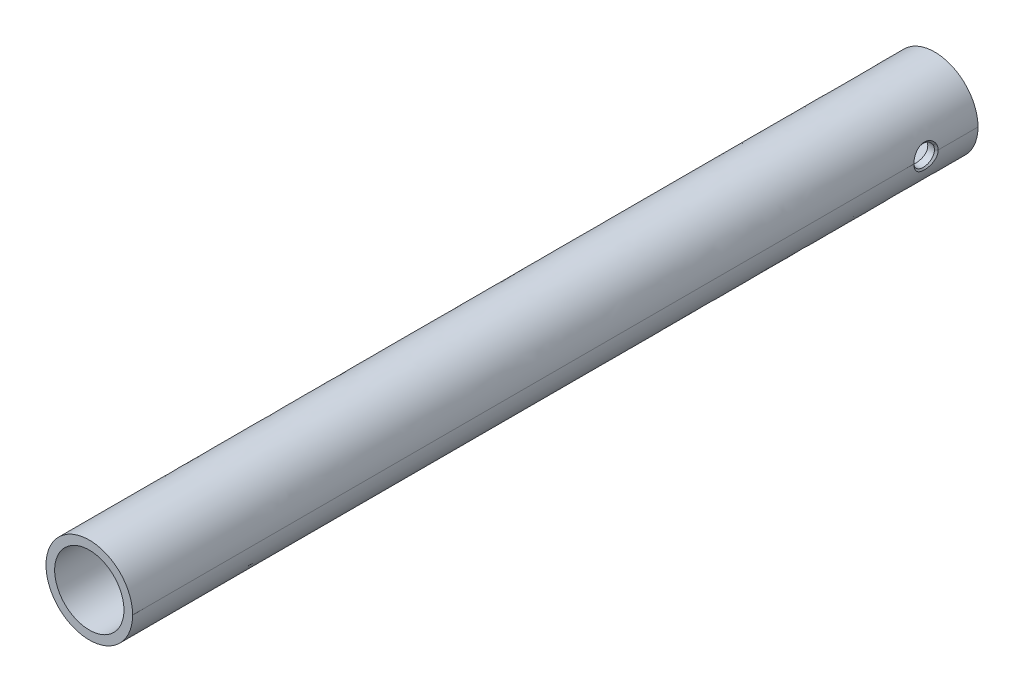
ISO-10303-21;
HEADER;
FILE_DESCRIPTION(('STEP AP214'),'2;1');
FILE_NAME('part.step','',(''),(''),'','','');
FILE_SCHEMA(('AUTOMOTIVE_DESIGN { 1 0 10303 214 1 1 1 1 }'));
ENDSEC;
DATA;
#1=APPLICATION_CONTEXT('core data for automotive mechanical design processes');
#2=APPLICATION_PROTOCOL_DEFINITION('international standard','automotive_design',2000,#1);
#3=PRODUCT_CONTEXT('',#1,'mechanical');
#4=PRODUCT('Part','Part','',(#3));
#5=PRODUCT_RELATED_PRODUCT_CATEGORY('part','',(#4));
#6=PRODUCT_DEFINITION_FORMATION('','',#4);
#7=PRODUCT_DEFINITION_CONTEXT('part definition',#1,'design');
#8=PRODUCT_DEFINITION('design','',#6,#7);
#9=PRODUCT_DEFINITION_SHAPE('','',#8);
#10=(LENGTH_UNIT() NAMED_UNIT(*) SI_UNIT(.MILLI.,.METRE.));
#11=(NAMED_UNIT(*) PLANE_ANGLE_UNIT() SI_UNIT($,.RADIAN.));
#12=(NAMED_UNIT(*) SI_UNIT($,.STERADIAN.) SOLID_ANGLE_UNIT());
#13=UNCERTAINTY_MEASURE_WITH_UNIT(LENGTH_MEASURE(1.E-05),#10,'distance_accuracy_value','');
#14=(GEOMETRIC_REPRESENTATION_CONTEXT(3) GLOBAL_UNCERTAINTY_ASSIGNED_CONTEXT((#13)) GLOBAL_UNIT_ASSIGNED_CONTEXT((#10,
#11,#12)) REPRESENTATION_CONTEXT('',''));
#15=CARTESIAN_POINT('',(0.,0.,0.));
#16=DIRECTION('',(0.,0.,1.));
#17=DIRECTION('',(1.,0.,0.));
#18=AXIS2_PLACEMENT_3D('',#15,#16,#17);
#19=CARTESIAN_POINT('',(-12.4277300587,0.,15.));
#20=DIRECTION('',(1.,0.,0.));
#21=DIRECTION('',(0.,0.,-1.));
#22=AXIS2_PLACEMENT_3D('',#19,#20,#21);
#23=CYLINDRICAL_SURFACE('',#22,3.);
#24=CARTESIAN_POINT('',(9.89602750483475,1.43827661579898,12.3672523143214));
#25=CARTESIAN_POINT('',(9.91678792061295,1.29540674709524,12.2892101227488));
#26=CARTESIAN_POINT('',(9.93535101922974,1.14579297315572,12.2226146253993));
#27=CARTESIAN_POINT('',(9.9661208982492,0.836986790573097,12.1144722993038));
#28=CARTESIAN_POINT('',(9.97831990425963,0.677782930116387,12.0729560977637));
#29=CARTESIAN_POINT('',(9.99503752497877,0.354202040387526,12.0164595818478));
#30=CARTESIAN_POINT('',(9.99955139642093,0.189821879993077,12.001495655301));
#31=CARTESIAN_POINT('',(10.0003843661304,-0.139131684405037,11.9987184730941));
#32=CARTESIAN_POINT('',(9.99670623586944,-0.303705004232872,12.0108960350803));
#33=CARTESIAN_POINT('',(9.98168865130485,-0.625673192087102,12.0615190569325));
#34=CARTESIAN_POINT('',(9.97047251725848,-0.783140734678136,12.0995418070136));
#35=CARTESIAN_POINT('',(9.94167375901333,-1.08940584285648,12.2001451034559));
#36=CARTESIAN_POINT('',(9.92409008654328,-1.23820197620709,12.2627296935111));
#37=CARTESIAN_POINT('',(9.88393771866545,-1.52622263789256,12.4120504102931));
#38=CARTESIAN_POINT('',(9.8612765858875,-1.66519704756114,12.4992433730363));
#39=CARTESIAN_POINT('',(9.81350477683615,-1.92687454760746,12.694820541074));
#40=CARTESIAN_POINT('',(9.78839351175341,-2.04957370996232,12.8032098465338));
#41=CARTESIAN_POINT('',(9.73735100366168,-2.28001303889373,13.0429105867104));
#42=CARTESIAN_POINT('',(9.71142428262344,-2.38702064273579,13.1749285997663));
#43=CARTESIAN_POINT('',(9.6626271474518,-2.57746635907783,13.4555211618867));
#44=CARTESIAN_POINT('',(9.6397567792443,-2.66090411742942,13.604095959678));
#45=CARTESIAN_POINT('',(9.59980195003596,-2.8016392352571,13.913844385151));
#46=CARTESIAN_POINT('',(9.58271532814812,-2.85894636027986,14.0750132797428));
#47=CARTESIAN_POINT('',(9.55649393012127,-2.94542000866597,14.405338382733));
#48=CARTESIAN_POINT('',(9.54735646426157,-2.97459605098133,14.5744918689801));
#49=CARTESIAN_POINT('',(9.53842877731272,-3.00309601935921,14.9085499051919));
#50=CARTESIAN_POINT('',(9.53827160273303,-3.003591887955,15.0733453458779));
#51=CARTESIAN_POINT('',(9.5463974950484,-2.97766261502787,15.400568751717));
#52=CARTESIAN_POINT('',(9.55467944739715,-2.95124102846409,15.5629970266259));
#53=CARTESIAN_POINT('',(9.57845545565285,-2.87311732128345,15.8781334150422));
#54=CARTESIAN_POINT('',(9.59382542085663,-2.82184943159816,16.0309593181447));
#55=CARTESIAN_POINT('',(9.62999201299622,-2.69583515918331,16.3259786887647));
#56=CARTESIAN_POINT('',(9.65079156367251,-2.62107612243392,16.4681663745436));
#57=CARTESIAN_POINT('',(9.69636632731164,-2.4472066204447,16.7431482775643));
#58=CARTESIAN_POINT('',(9.72125441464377,-2.34734145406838,16.8754456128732));
#59=CARTESIAN_POINT('',(9.77173247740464,-2.12741688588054,17.1216205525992));
#60=CARTESIAN_POINT('',(9.79732140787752,-2.00738631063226,17.2355240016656));
#61=CARTESIAN_POINT('',(9.8350836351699,-1.80998782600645,17.3941085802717));
#62=CARTESIAN_POINT('',(9.84796568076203,-1.73871249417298,17.4463614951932));
#63=CARTESIAN_POINT('',(9.87279109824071,-1.59171571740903,17.5444548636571));
#64=CARTESIAN_POINT('',(9.88473440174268,-1.51599394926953,17.5902948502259));
#65=CARTESIAN_POINT('',(9.91678792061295,-1.29540674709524,17.7107898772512));
#66=CARTESIAN_POINT('',(9.93535101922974,-1.14579297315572,17.7773853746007));
#67=CARTESIAN_POINT('',(9.9661208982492,-0.836986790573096,17.8855277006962));
#68=CARTESIAN_POINT('',(9.97831990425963,-0.677782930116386,17.9270439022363));
#69=CARTESIAN_POINT('',(9.99503752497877,-0.354202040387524,17.9835404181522));
#70=CARTESIAN_POINT('',(9.99955139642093,-0.189821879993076,17.998504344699));
#71=CARTESIAN_POINT('',(10.0003843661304,0.139131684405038,18.0012815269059));
#72=CARTESIAN_POINT('',(9.99670623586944,0.303705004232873,17.9891039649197));
#73=CARTESIAN_POINT('',(9.98168865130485,0.625673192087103,17.9384809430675));
#74=CARTESIAN_POINT('',(9.97047251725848,0.783140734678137,17.9004581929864));
#75=CARTESIAN_POINT('',(9.94167375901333,1.08940584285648,17.7998548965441));
#76=CARTESIAN_POINT('',(9.92409008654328,1.23820197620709,17.7372703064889));
#77=CARTESIAN_POINT('',(9.88393771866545,1.52622263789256,17.5879495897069));
#78=CARTESIAN_POINT('',(9.8612765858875,1.66519704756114,17.5007566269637));
#79=CARTESIAN_POINT('',(9.81350477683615,1.92687454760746,17.305179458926));
#80=CARTESIAN_POINT('',(9.78839351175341,2.04957370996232,17.1967901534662));
#81=CARTESIAN_POINT('',(9.73735100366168,2.28001303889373,16.9570894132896));
#82=CARTESIAN_POINT('',(9.71142428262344,2.38702064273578,16.8250714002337));
#83=CARTESIAN_POINT('',(9.6626271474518,2.57746635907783,16.5444788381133));
#84=CARTESIAN_POINT('',(9.6397567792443,2.66090411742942,16.395904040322));
#85=CARTESIAN_POINT('',(9.59980195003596,2.8016392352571,16.086155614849));
#86=CARTESIAN_POINT('',(9.58271532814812,2.85894636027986,15.9249867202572));
#87=CARTESIAN_POINT('',(9.55649393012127,2.94542000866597,15.594661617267));
#88=CARTESIAN_POINT('',(9.54735646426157,2.97459605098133,15.4255081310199));
#89=CARTESIAN_POINT('',(9.53842877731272,3.00309601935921,15.0914500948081));
#90=CARTESIAN_POINT('',(9.53827160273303,3.003591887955,14.9266546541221));
#91=CARTESIAN_POINT('',(9.5463974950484,2.97766261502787,14.599431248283));
#92=CARTESIAN_POINT('',(9.55467944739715,2.95124102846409,14.4370029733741));
#93=CARTESIAN_POINT('',(9.57845545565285,2.87311732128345,14.1218665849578));
#94=CARTESIAN_POINT('',(9.59382542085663,2.82184943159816,13.9690406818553));
#95=CARTESIAN_POINT('',(9.62999201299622,2.69583515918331,13.6740213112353));
#96=CARTESIAN_POINT('',(9.65079156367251,2.62107612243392,13.5318336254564));
#97=CARTESIAN_POINT('',(9.69636632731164,2.4472066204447,13.2568517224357));
#98=CARTESIAN_POINT('',(9.72125441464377,2.34734145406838,13.1245543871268));
#99=CARTESIAN_POINT('',(9.77173247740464,2.12741688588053,12.8783794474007));
#100=CARTESIAN_POINT('',(9.79732140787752,2.00738631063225,12.7644759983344));
#101=CARTESIAN_POINT('',(9.8350836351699,1.80998782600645,12.6058914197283));
#102=CARTESIAN_POINT('',(9.84796568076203,1.73871249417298,12.5536385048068));
#103=CARTESIAN_POINT('',(9.87279109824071,1.59171571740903,12.4555451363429));
#104=CARTESIAN_POINT('',(9.88473440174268,1.51599394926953,12.4097051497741));
#105=CARTESIAN_POINT('',(9.89602750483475,1.43827661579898,12.3672523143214));
#106=B_SPLINE_CURVE_WITH_KNOTS('',3,(#24,#25,#26,#27,#28,#29,#30,#31,#32,#33,#34,#35,#36,#37,
#38,#39,#40,#41,#42,#43,#44,#45,#46,#47,#48,#49,#50,#51,#52,#53,#54,#55,#56,#57,#58,#59,#60,#61,
#62,#63,#64,#65,#66,#67,#68,#69,#70,#71,#72,#73,#74,#75,#76,#77,#78,#79,#80,#81,#82,#83,#84,#85,
#86,#87,#88,#89,#90,#91,#92,#93,#94,#95,#96,#97,#98,#99,#100,#101,#102,#103,#104,#105),
.UNSPECIFIED.,.T.,.F.,(4,2,2,2,2,2,2,2,2,2,2,2,2,2,2,2,2,2,2,2,2,2,2,2,2,2,2,2,2,2,2,2,2,2,2,2,
2,2,2,2,4),(0.,0.492024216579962,0.984648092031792,1.47757590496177,1.97033697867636,
2.4552267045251,2.94019629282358,3.43483927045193,3.92960141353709,4.44289777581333,
4.95620185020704,5.46931393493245,5.98225233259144,6.47421534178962,6.96611338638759,
7.44970881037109,7.93356518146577,8.4342043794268,8.93413390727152,9.20176225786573,
9.46941008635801,9.96143430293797,10.4540581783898,10.9469859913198,11.4397470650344,
11.9246367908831,12.4096063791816,12.9042493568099,13.3990114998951,13.9123078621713,
14.425611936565,14.9387240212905,15.4516624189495,15.9436254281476,16.4355234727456,
16.9191188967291,17.4029752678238,17.9036144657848,18.4035439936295,18.6711723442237,
18.938820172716),.UNSPECIFIED.);
#107=CARTESIAN_POINT('',(9.89602750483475,1.43827661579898,12.3672523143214));
#108=VERTEX_POINT('',#107);
#109=EDGE_CURVE('E114',#108,#108,#106,.T.);
#110=ORIENTED_EDGE('',*,*,#109,.T.);
#111=EDGE_LOOP('',(#110));
#112=FACE_BOUND('',#111,.T.);
#113=CARTESIAN_POINT('',(11.9152074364,0.,12.));
#114=CARTESIAN_POINT('',(11.9152046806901,0.0649752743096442,11.9999970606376));
#115=CARTESIAN_POINT('',(11.9149706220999,0.129948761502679,12.002110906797));
#116=CARTESIAN_POINT('',(11.9140299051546,0.259600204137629,12.010548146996));
#117=CARTESIAN_POINT('',(11.9133233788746,0.324278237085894,12.016870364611));
#118=CARTESIAN_POINT('',(11.9114277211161,0.453084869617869,12.0337005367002));
#119=CARTESIAN_POINT('',(11.91023857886,0.517213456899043,12.0442085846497));
#120=CARTESIAN_POINT('',(11.9073647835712,0.644646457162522,12.069359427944));
#121=CARTESIAN_POINT('',(11.9056800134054,0.707950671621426,12.0840032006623));
#122=CARTESIAN_POINT('',(11.9001640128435,0.88671719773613,12.1315308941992));
#123=CARTESIAN_POINT('',(11.8957238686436,1.00090594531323,12.1693542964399));
#124=CARTESIAN_POINT('',(11.8878236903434,1.16814866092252,12.236116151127));
#125=CARTESIAN_POINT('',(11.8849795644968,1.22328521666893,12.2600752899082));
#126=CARTESIAN_POINT('',(11.8788988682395,1.33199188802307,12.3112454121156));
#127=CARTESIAN_POINT('',(11.8756623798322,1.38556232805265,12.3384557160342));
#128=CARTESIAN_POINT('',(11.872239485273,1.4382766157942,12.3672523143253));
#129=B_SPLINE_CURVE_WITH_KNOTS('',3,(#113,#114,#115,#116,#117,#118,#119,#120,#121,#122,#123,
#124,#125,#126,#127,#128),.UNSPECIFIED.,.F.,.F.,(4,2,2,2,2,2,2,4),(0.,0.194887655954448,
0.389720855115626,0.584558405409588,0.77944203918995,1.13952101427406,1.31998498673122,
1.50041130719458),.UNSPECIFIED.);
#130=CARTESIAN_POINT('',(11.9152074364,0.,12.));
#131=VERTEX_POINT('',#130);
#132=CARTESIAN_POINT('',(11.872239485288,1.43827661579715,12.3672523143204));
#133=VERTEX_POINT('',#132);
#134=EDGE_CURVE('E100',#131,#133,#129,.T.);
#135=ORIENTED_EDGE('',*,*,#134,.T.);
#136=CARTESIAN_POINT('',(11.8722394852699,1.43827661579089,12.3672523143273));
#137=CARTESIAN_POINT('',(11.8674368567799,1.51234725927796,12.4077084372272));
#138=CARTESIAN_POINT('',(11.8622577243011,1.58467926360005,12.4512907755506));
#139=CARTESIAN_POINT('',(11.8512871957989,1.72538048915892,12.5443606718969));
#140=CARTESIAN_POINT('',(11.8454958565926,1.79375007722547,12.5938476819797));
#141=CARTESIAN_POINT('',(11.8334444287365,1.92601413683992,12.6983551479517));
#142=CARTESIAN_POINT('',(11.8271846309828,1.98991133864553,12.75337217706));
#143=CARTESIAN_POINT('',(11.8143829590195,2.1128243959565,12.8685506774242));
#144=CARTESIAN_POINT('',(11.8078410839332,2.17184023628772,12.928712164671));
#145=CARTESIAN_POINT('',(11.7880966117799,2.3410801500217,13.1164678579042));
#146=CARTESIAN_POINT('',(11.7747791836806,2.44345483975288,13.2513002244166));
#147=CARTESIAN_POINT('',(11.7496625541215,2.62410162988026,13.5362441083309));
#148=CARTESIAN_POINT('',(11.7378630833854,2.70237800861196,13.686352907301));
#149=CARTESIAN_POINT('',(11.7173882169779,2.83277793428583,13.9980373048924));
#150=CARTESIAN_POINT('',(11.7087176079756,2.88486145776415,14.1596300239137));
#151=CARTESIAN_POINT('',(11.6958125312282,2.96108118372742,14.4894611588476));
#152=CARTESIAN_POINT('',(11.6915781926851,2.98521657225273,14.6576997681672));
#153=CARTESIAN_POINT('',(11.6881761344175,3.00464525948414,14.9936453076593));
#154=CARTESIAN_POINT('',(11.688942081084,3.00031616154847,15.1613297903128));
#155=CARTESIAN_POINT('',(11.6952861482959,2.96383948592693,15.4935346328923));
#156=CARTESIAN_POINT('',(11.700863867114,2.9316942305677,15.6580552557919));
#157=CARTESIAN_POINT('',(11.7159968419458,2.84077169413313,15.9785991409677));
#158=CARTESIAN_POINT('',(11.7255350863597,2.78210822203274,16.1346555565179));
#159=CARTESIAN_POINT('',(11.7472583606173,2.63987889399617,16.4347910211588));
#160=CARTESIAN_POINT('',(11.7594438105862,2.55630908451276,16.5788681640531));
#161=CARTESIAN_POINT('',(11.7849714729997,2.36535554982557,16.8529275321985));
#162=CARTESIAN_POINT('',(11.7983264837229,2.25768100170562,16.9827059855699));
#163=CARTESIAN_POINT('',(11.8242758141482,2.02210894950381,17.2224572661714));
#164=CARTESIAN_POINT('',(11.8368701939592,1.89421304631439,17.3324316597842));
#165=CARTESIAN_POINT('',(11.8599505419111,1.62083529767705,17.530122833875));
#166=CARTESIAN_POINT('',(11.8704228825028,1.47524883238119,17.6176966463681));
#167=CARTESIAN_POINT('',(11.8881959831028,1.17124470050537,17.7671034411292));
#168=CARTESIAN_POINT('',(11.8954971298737,1.01282860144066,17.8289395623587));
#169=CARTESIAN_POINT('',(11.9058618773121,0.712487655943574,17.9177070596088));
#170=CARTESIAN_POINT('',(11.909401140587,0.571719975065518,17.9485172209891));
#171=CARTESIAN_POINT('',(11.9129025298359,0.358434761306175,17.9793785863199));
#172=CARTESIAN_POINT('',(11.9137684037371,0.28697479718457,17.9871067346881));
#173=CARTESIAN_POINT('',(11.914915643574,0.143669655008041,17.9974187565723));
#174=CARTESIAN_POINT('',(11.9151969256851,0.07182442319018,18.0000018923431));
#175=CARTESIAN_POINT('',(11.9151949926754,-4.29688173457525E-05,17.9999999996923));
#176=B_SPLINE_CURVE_WITH_KNOTS('',3,(#136,#137,#138,#139,#140,#141,#142,#143,#144,#145,#146,
#147,#148,#149,#150,#151,#152,#153,#154,#155,#156,#157,#158,#159,#160,#161,#162,#163,#164,#165,
#166,#167,#168,#169,#170,#171,#172,#173,#174,#175),.UNSPECIFIED.,.F.,.F.,(4,2,2,2,2,2,2,2,2,2,2,
2,2,2,2,2,2,2,2,4),(0.,0.253520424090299,0.507017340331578,0.760358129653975,1.01369970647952,
1.52054115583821,2.02729257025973,2.53481598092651,3.04235417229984,3.54317318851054,
4.04395039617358,4.54259851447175,5.04132582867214,5.54642987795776,6.05149395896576,
6.5597053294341,7.06785470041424,7.49870458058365,7.71418465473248,7.92969562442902),.UNSPECIFIED.);
#177=CARTESIAN_POINT('',(11.915207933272,-4.29737000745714E-05,18.0000037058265));
#178=VERTEX_POINT('',#177);
#179=EDGE_CURVE('E124',#133,#178,#176,.T.);
#180=ORIENTED_EDGE('',*,*,#179,.T.);
#181=CARTESIAN_POINT('',(11.8722378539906,-1.43827834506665,17.6327467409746));
#182=CARTESIAN_POINT('',(11.875997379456,-1.38042121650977,17.6643578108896));
#183=CARTESIAN_POINT('',(11.8795292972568,-1.32150898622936,17.6940616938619));
#184=CARTESIAN_POINT('',(11.8861127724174,-1.20184957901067,17.7495273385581));
#185=CARTESIAN_POINT('',(11.8891644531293,-1.14110287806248,17.7752901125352));
#186=CARTESIAN_POINT('',(11.8947643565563,-1.01801781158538,17.8227629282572));
#187=CARTESIAN_POINT('',(11.8973125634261,-0.955679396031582,17.8444728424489));
#188=CARTESIAN_POINT('',(11.901897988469,-0.829688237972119,17.8837434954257));
#189=CARTESIAN_POINT('',(11.9039350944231,-0.766035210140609,17.9013033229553));
#190=CARTESIAN_POINT('',(11.9089007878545,-0.58720656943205,17.9443283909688));
#191=CARTESIAN_POINT('',(11.9112720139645,-0.470849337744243,17.965162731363));
#192=CARTESIAN_POINT('',(11.9136360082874,-0.295047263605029,17.9860425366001));
#193=CARTESIAN_POINT('',(11.9142251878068,-0.236168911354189,17.9912738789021));
#194=CARTESIAN_POINT('',(11.9150114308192,-0.11821428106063,17.998251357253));
#195=CARTESIAN_POINT('',(11.9152085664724,-0.0591380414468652,17.999998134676));
#196=CARTESIAN_POINT('',(11.9152137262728,-4.29740015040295E-05,17.9999999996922));
#197=B_SPLINE_CURVE_WITH_KNOTS('',3,(#181,#182,#183,#184,#185,#186,#187,#188,#189,#190,#191,
#192,#193,#194,#195,#196),.UNSPECIFIED.,.F.,.F.,(4,2,2,2,2,2,2,4),(0.,0.198070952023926,
0.396090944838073,0.594117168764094,0.792186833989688,1.14590067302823,1.3231548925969,
1.50037648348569),.UNSPECIFIED.);
#198=CARTESIAN_POINT('',(11.8722122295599,-1.43827274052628,17.632739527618));
#199=VERTEX_POINT('',#198);
#200=EDGE_CURVE('E115',#199,#178,#197,.T.);
#201=ORIENTED_EDGE('',*,*,#200,.F.);
#202=CARTESIAN_POINT('',(11.8722089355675,-1.43827689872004,17.6327475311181));
#203=CARTESIAN_POINT('',(11.8673993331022,-1.51234980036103,17.5922901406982));
#204=CARTESIAN_POINT('',(11.8622144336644,-1.58468399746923,17.5487063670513));
#205=CARTESIAN_POINT('',(11.8512384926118,-1.72538976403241,17.4556329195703));
#206=CARTESIAN_POINT('',(11.8454475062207,-1.79376169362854,17.4061437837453));
#207=CARTESIAN_POINT('',(11.8334066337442,-1.92603051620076,17.3016312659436));
#208=CARTESIAN_POINT('',(11.8271570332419,-1.98993014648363,17.2466113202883));
#209=CARTESIAN_POINT('',(11.8143793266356,-2.11284774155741,17.1314263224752));
#210=CARTESIAN_POINT('',(11.8078512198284,-2.17186569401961,17.0712612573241));
#211=CARTESIAN_POINT('',(11.7881335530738,-2.34110999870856,16.8834957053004));
#212=CARTESIAN_POINT('',(11.7748145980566,-2.44348550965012,16.7486575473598));
#213=CARTESIAN_POINT('',(11.7496791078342,-2.62413178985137,16.4637021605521));
#214=CARTESIAN_POINT('',(11.7378623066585,-2.70240682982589,16.3135876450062));
#215=CARTESIAN_POINT('',(11.7173724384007,-2.83280254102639,16.0018944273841));
#216=CARTESIAN_POINT('',(11.7087041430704,-2.88488355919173,15.8402987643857));
#217=CARTESIAN_POINT('',(11.6957978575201,-2.9610945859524,15.5104564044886));
#218=CARTESIAN_POINT('',(11.6915599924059,-2.98522380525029,15.3422095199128));
#219=CARTESIAN_POINT('',(11.6881642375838,-3.00464768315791,15.0062788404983));
#220=CARTESIAN_POINT('',(11.6889396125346,-3.00032112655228,14.8386172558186));
#221=CARTESIAN_POINT('',(11.6952921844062,-2.9638187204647,14.5063744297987));
#222=CARTESIAN_POINT('',(11.7008689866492,-2.93164516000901,14.3417929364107));
#223=CARTESIAN_POINT('',(11.7122168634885,-2.86343104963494,14.1012749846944));
#224=CARTESIAN_POINT('',(11.7164872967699,-2.83742548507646,14.0222840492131));
#225=CARTESIAN_POINT('',(11.7258578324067,-2.77897171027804,13.8667724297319));
#226=CARTESIAN_POINT('',(11.7309577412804,-2.74652500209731,13.7902511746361));
#227=CARTESIAN_POINT('',(11.7418085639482,-2.67542295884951,13.6402196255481));
#228=CARTESIAN_POINT('',(11.7475593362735,-2.63676897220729,13.5667086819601));
#229=CARTESIAN_POINT('',(11.7595237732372,-2.55349489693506,13.4231150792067));
#230=CARTESIAN_POINT('',(11.7657378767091,-2.508869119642,13.3530357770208));
#231=CARTESIAN_POINT('',(11.7849173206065,-2.36536222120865,13.1471012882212));
#232=CARTESIAN_POINT('',(11.7982873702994,-2.25767114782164,13.0172787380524));
#233=CARTESIAN_POINT('',(11.8242843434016,-2.02202517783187,12.7774627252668));
#234=CARTESIAN_POINT('',(11.8369112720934,-1.89407042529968,12.6674691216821));
#235=CARTESIAN_POINT('',(11.8542164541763,-1.68927955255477,12.5193701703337));
#236=CARTESIAN_POINT('',(11.8597298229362,-1.61858408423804,12.4726765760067));
#237=CARTESIAN_POINT('',(11.8700696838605,-1.47351237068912,12.3854424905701));
#238=CARTESIAN_POINT('',(11.874896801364,-1.39913956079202,12.3448963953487));
#239=CARTESIAN_POINT('',(11.883774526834,-1.24717046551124,12.2702133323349));
#240=CARTESIAN_POINT('',(11.8878249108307,-1.16957325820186,12.2360782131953));
#241=CARTESIAN_POINT('',(11.8950974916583,-1.01174845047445,12.1744821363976));
#242=CARTESIAN_POINT('',(11.8983195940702,-0.931520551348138,12.1470219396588));
#243=CARTESIAN_POINT('',(11.9058590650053,-0.712498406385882,12.0823087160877));
#244=CARTESIAN_POINT('',(11.9093850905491,-0.57169315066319,12.0514817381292));
#245=CARTESIAN_POINT('',(11.912888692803,-0.358419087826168,12.0206177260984));
#246=CARTESIAN_POINT('',(11.9137589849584,-0.286975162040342,12.0128924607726));
#247=CARTESIAN_POINT('',(11.9149170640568,-0.143698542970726,12.0025841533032));
#248=CARTESIAN_POINT('',(11.9152047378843,-0.0718657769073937,12.0000021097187));
#249=CARTESIAN_POINT('',(11.9152074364,0.,12.));
#250=B_SPLINE_CURVE_WITH_KNOTS('',3,(#202,#203,#204,#205,#206,#207,#208,#209,#210,#211,#212,
#213,#214,#215,#216,#217,#218,#219,#220,#221,#222,#223,#224,#225,#226,#227,#228,#229,#230,#231,
#232,#233,#234,#235,#236,#237,#238,#239,#240,#241,#242,#243,#244,#245,#246,#247,#248,#249),
.UNSPECIFIED.,.F.,.F.,(4,2,2,2,2,2,2,2,2,2,2,2,2,2,2,2,2,2,2,2,2,2,2,4),(0.,0.253529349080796,
0.507035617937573,0.760385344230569,1.01373571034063,1.52059288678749,2.02736019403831,
2.53489236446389,3.04243886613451,3.54324304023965,4.04400605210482,4.29358144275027,
4.54309870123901,4.79256182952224,5.04226430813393,5.54735238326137,6.05243686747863,
6.30688904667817,6.56110785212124,6.81539985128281,7.0697208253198,7.50050870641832,
7.71595145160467,7.93143602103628),.UNSPECIFIED.);
#251=EDGE_CURVE('E339',#199,#131,#250,.T.);
#252=ORIENTED_EDGE('',*,*,#251,.T.);
#253=EDGE_LOOP('',(#135,#180,#201,#252));
#254=FACE_BOUND('',#253,.T.);
#255=ADVANCED_FACE('F17',(#112,#254),#23,.F.);
#256=CARTESIAN_POINT('',(0.,0.,0.1));
#257=DIRECTION('',(0.,0.,1.));
#258=DIRECTION('',(1.,0.,0.));
#259=AXIS2_PLACEMENT_3D('',#256,#257,#258);
#260=CYLINDRICAL_SURFACE('',#259,10.);
#261=CARTESIAN_POINT('',(0.,0.,244.));
#262=DIRECTION('',(0.,0.,1.));
#263=DIRECTION('',(1.,0.,0.));
#264=AXIS2_PLACEMENT_3D('',#261,#262,#263);
#265=CIRCLE('',#264,10.);
#266=CARTESIAN_POINT('',(10.,0.,244.));
#267=VERTEX_POINT('',#266);
#268=EDGE_CURVE('E347',#267,#267,#265,.T.);
#269=ORIENTED_EDGE('',*,*,#268,.T.);
#270=EDGE_LOOP('',(#269));
#271=FACE_BOUND('',#270,.T.);
#272=CARTESIAN_POINT('',(-9.89602750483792,1.43827661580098,12.3672523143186));
#273=CARTESIAN_POINT('',(-9.9167879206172,1.29540674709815,12.2892101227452));
#274=CARTESIAN_POINT('',(-9.93535101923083,1.1457929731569,12.2226146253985));
#275=CARTESIAN_POINT('',(-9.96612089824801,0.836986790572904,12.1144722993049));
#276=CARTESIAN_POINT('',(-9.9783199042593,0.677782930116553,12.072956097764));
#277=CARTESIAN_POINT('',(-9.99503752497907,0.354202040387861,12.0164595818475));
#278=CARTESIAN_POINT('',(-9.99955139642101,0.189821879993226,12.0014956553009));
#279=CARTESIAN_POINT('',(-10.0003843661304,-0.139131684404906,11.9987184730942));
#280=CARTESIAN_POINT('',(-9.99670623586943,-0.303705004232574,12.0108960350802));
#281=CARTESIAN_POINT('',(-9.9816886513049,-0.625673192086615,12.0615190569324));
#282=CARTESIAN_POINT('',(-9.97047251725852,-0.783140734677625,12.0995418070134));
#283=CARTESIAN_POINT('',(-9.94167375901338,-1.08940584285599,12.2001451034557));
#284=CARTESIAN_POINT('',(-9.92409008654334,-1.23820197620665,12.2627296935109));
#285=CARTESIAN_POINT('',(-9.88393771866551,-1.52622263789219,12.4120504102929));
#286=CARTESIAN_POINT('',(-9.86127658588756,-1.66519704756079,12.4992433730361));
#287=CARTESIAN_POINT('',(-9.81350477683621,-1.92687454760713,12.6948205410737));
#288=CARTESIAN_POINT('',(-9.78839351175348,-2.049573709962,12.8032098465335));
#289=CARTESIAN_POINT('',(-9.73735100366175,-2.28001303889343,13.04291058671));
#290=CARTESIAN_POINT('',(-9.71142428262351,-2.3870206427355,13.174928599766));
#291=CARTESIAN_POINT('',(-9.66262714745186,-2.57746635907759,13.4555211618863));
#292=CARTESIAN_POINT('',(-9.63975677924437,-2.66090411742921,13.6040959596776));
#293=CARTESIAN_POINT('',(-9.59980195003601,-2.80163923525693,13.9138443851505));
#294=CARTESIAN_POINT('',(-9.58271532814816,-2.85894636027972,14.0750132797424));
#295=CARTESIAN_POINT('',(-9.5564939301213,-2.94542000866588,14.4053383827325));
#296=CARTESIAN_POINT('',(-9.54735646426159,-2.97459605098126,14.5744918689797));
#297=CARTESIAN_POINT('',(-9.53842877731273,-3.00309601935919,14.9085499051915));
#298=CARTESIAN_POINT('',(-9.53827160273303,-3.00359188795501,15.0733453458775));
#299=CARTESIAN_POINT('',(-9.54639749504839,-2.97766261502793,15.4005687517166));
#300=CARTESIAN_POINT('',(-9.55467944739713,-2.95124102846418,15.5629970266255));
#301=CARTESIAN_POINT('',(-9.57845545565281,-2.87311732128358,15.8781334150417));
#302=CARTESIAN_POINT('',(-9.59382542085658,-2.82184943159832,16.0309593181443));
#303=CARTESIAN_POINT('',(-9.62999201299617,-2.69583515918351,16.3259786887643));
#304=CARTESIAN_POINT('',(-9.65079156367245,-2.62107612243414,16.4681663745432));
#305=CARTESIAN_POINT('',(-9.69636632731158,-2.44720662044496,16.743148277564));
#306=CARTESIAN_POINT('',(-9.7212544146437,-2.34734145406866,16.8754456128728));
#307=CARTESIAN_POINT('',(-9.77173247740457,-2.12741688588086,17.1216205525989));
#308=CARTESIAN_POINT('',(-9.79732140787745,-2.0073863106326,17.2355240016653));
#309=CARTESIAN_POINT('',(-9.83508363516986,-1.80998782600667,17.3941085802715));
#310=CARTESIAN_POINT('',(-9.84796568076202,-1.73871249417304,17.4463614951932));
#311=CARTESIAN_POINT('',(-9.87279109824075,-1.59171571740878,17.5444548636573));
#312=CARTESIAN_POINT('',(-9.88473440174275,-1.51599394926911,17.5902948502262));
#313=CARTESIAN_POINT('',(-9.91678792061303,-1.29540674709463,17.7107898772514));
#314=CARTESIAN_POINT('',(-9.93535101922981,-1.1457929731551,17.777385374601));
#315=CARTESIAN_POINT('',(-9.96612089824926,-0.836986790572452,17.8855277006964));
#316=CARTESIAN_POINT('',(-9.97831990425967,-0.677782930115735,17.9270439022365));
#317=CARTESIAN_POINT('',(-9.99503752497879,-0.354202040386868,17.9835404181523));
#318=CARTESIAN_POINT('',(-9.99955139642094,-0.189821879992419,17.9985043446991));
#319=CARTESIAN_POINT('',(-10.0003843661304,0.139131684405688,18.0012815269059));
#320=CARTESIAN_POINT('',(-9.99670623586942,0.303705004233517,17.9891039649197));
#321=CARTESIAN_POINT('',(-9.98168865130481,0.62567319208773,17.9384809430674));
#322=CARTESIAN_POINT('',(-9.97047251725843,0.783140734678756,17.9004581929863));
#323=CARTESIAN_POINT('',(-9.94167375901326,1.08940584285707,17.7998548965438));
#324=CARTESIAN_POINT('',(-9.92409008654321,1.23820197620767,17.7372703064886));
#325=CARTESIAN_POINT('',(-9.88393771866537,1.52622263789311,17.5879495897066));
#326=CARTESIAN_POINT('',(-9.86127658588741,1.66519704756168,17.5007566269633));
#327=CARTESIAN_POINT('',(-9.81350477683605,1.92687454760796,17.3051794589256));
#328=CARTESIAN_POINT('',(-9.78839351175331,2.0495737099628,17.1967901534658));
#329=CARTESIAN_POINT('',(-9.73735100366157,2.28001303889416,16.9570894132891));
#330=CARTESIAN_POINT('',(-9.71142428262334,2.38702064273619,16.8250714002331));
#331=CARTESIAN_POINT('',(-9.66262714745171,2.57746635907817,16.5444788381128));
#332=CARTESIAN_POINT('',(-9.63975677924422,2.66090411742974,16.3959040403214));
#333=CARTESIAN_POINT('',(-9.59980195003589,2.80163923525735,16.0861556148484));
#334=CARTESIAN_POINT('',(-9.58271532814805,2.85894636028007,15.9249867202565));
#335=CARTESIAN_POINT('',(-9.55649393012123,2.9454200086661,15.5946616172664));
#336=CARTESIAN_POINT('',(-9.54735646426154,2.97459605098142,15.4255081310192));
#337=CARTESIAN_POINT('',(-9.53842877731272,3.00309601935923,15.0914500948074));
#338=CARTESIAN_POINT('',(-9.53827160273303,3.00359188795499,14.9266546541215));
#339=CARTESIAN_POINT('',(-9.54639749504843,2.97766261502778,14.5994312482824));
#340=CARTESIAN_POINT('',(-9.55467944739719,2.95124102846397,14.4370029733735));
#341=CARTESIAN_POINT('',(-9.57845545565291,2.87311732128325,14.1218665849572));
#342=CARTESIAN_POINT('',(-9.59382542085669,2.82184943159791,13.9690406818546));
#343=CARTESIAN_POINT('',(-9.62999201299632,2.695835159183,13.6740213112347));
#344=CARTESIAN_POINT('',(-9.65079156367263,2.62107612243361,13.5318336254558));
#345=CARTESIAN_POINT('',(-9.6963663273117,2.44720662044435,13.2568517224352));
#346=CARTESIAN_POINT('',(-9.72125441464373,2.347341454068,13.1245543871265));
#347=CARTESIAN_POINT('',(-9.77173247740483,2.12741688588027,12.8783794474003));
#348=CARTESIAN_POINT('',(-9.79732140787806,2.00738631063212,12.7644759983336));
#349=CARTESIAN_POINT('',(-9.83508363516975,1.80998782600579,12.6058914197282));
#350=CARTESIAN_POINT('',(-9.84796568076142,1.73871249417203,12.553638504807));
#351=CARTESIAN_POINT('',(-9.87279109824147,1.59171571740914,12.4555451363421));
#352=CARTESIAN_POINT('',(-9.88473440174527,1.51599394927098,12.4097051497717));
#353=CARTESIAN_POINT('',(-9.89602750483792,1.43827661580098,12.3672523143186));
#354=B_SPLINE_CURVE_WITH_KNOTS('',3,(#272,#273,#274,#275,#276,#277,#278,#279,#280,#281,#282,
#283,#284,#285,#286,#287,#288,#289,#290,#291,#292,#293,#294,#295,#296,#297,#298,#299,#300,#301,
#302,#303,#304,#305,#306,#307,#308,#309,#310,#311,#312,#313,#314,#315,#316,#317,#318,#319,#320,
#321,#322,#323,#324,#325,#326,#327,#328,#329,#330,#331,#332,#333,#334,#335,#336,#337,#338,#339,
#340,#341,#342,#343,#344,#345,#346,#347,#348,#349,#350,#351,#352,#353),.UNSPECIFIED.,.T.,.F.,(4,
2,2,2,2,2,2,2,2,2,2,2,2,2,2,2,2,2,2,2,2,2,2,2,2,2,2,2,2,2,2,2,2,2,2,2,2,2,2,2,4),(0.,
0.492024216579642,0.984648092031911,1.47757590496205,1.97033697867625,2.45522670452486,
2.94019629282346,3.43483927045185,3.92960141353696,4.44289777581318,4.95620185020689,
5.46931393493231,5.98225233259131,6.4742153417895,6.96611338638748,7.44970881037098,
7.93356518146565,8.43420437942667,8.93413390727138,9.20176225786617,9.46941008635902,
9.96143430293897,10.4540581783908,10.9469859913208,11.4397470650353,11.9246367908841,
12.4096063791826,12.9042493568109,13.3990114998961,13.9123078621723,14.4256119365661,
14.9387240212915,15.4516624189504,15.9436254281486,16.4355234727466,16.9191188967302,
17.4029752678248,17.9036144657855,18.4035439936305,18.6711723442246,18.9388201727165),.UNSPECIFIED.);
#355=CARTESIAN_POINT('',(-9.89602750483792,1.43827661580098,12.3672523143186));
#356=VERTEX_POINT('',#355);
#357=EDGE_CURVE('E130',#356,#356,#354,.T.);
#358=ORIENTED_EDGE('',*,*,#357,.T.);
#359=EDGE_LOOP('',(#358));
#360=FACE_BOUND('',#359,.T.);
#361=CARTESIAN_POINT('',(0.,0.,0.));
#362=DIRECTION('',(0.,0.,1.));
#363=DIRECTION('',(1.,0.,0.));
#364=AXIS2_PLACEMENT_3D('',#361,#362,#363);
#365=CIRCLE('',#364,10.);
#366=CARTESIAN_POINT('',(10.,0.,0.));
#367=VERTEX_POINT('',#366);
#368=EDGE_CURVE('E325',#367,#367,#365,.T.);
#369=ORIENTED_EDGE('',*,*,#368,.F.);
#370=EDGE_LOOP('',(#369));
#371=FACE_BOUND('',#370,.T.);
#372=ORIENTED_EDGE('',*,*,#109,.F.);
#373=EDGE_LOOP('',(#372));
#374=FACE_BOUND('',#373,.T.);
#375=ADVANCED_FACE('F351',(#271,#360,#371,#374),#260,.F.);
#376=CARTESIAN_POINT('',(12.3788775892,1.7359112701,11.9524858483));
#377=CARTESIAN_POINT('',(11.8722394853,1.43827661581,12.3672523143));
#378=CARTESIAN_POINT('',(12.4241870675,1.41280677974,11.7675597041));
#379=CARTESIAN_POINT('',(11.8901450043,1.16250308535,12.216596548));
#380=CARTESIAN_POINT('',(12.4614497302,1.07043228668,11.6292383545));
#381=CARTESIAN_POINT('',(11.90328171,0.875436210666,12.1066557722));
#382=CARTESIAN_POINT('',(12.487008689,0.722153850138,11.5383805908));
#383=CARTESIAN_POINT('',(11.911164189,0.584518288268,12.0359744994));
#384=CARTESIAN_POINT('',(12.5,0.360434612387,11.4921877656));
#385=CARTESIAN_POINT('',(11.9152074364,0.293834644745,12.));
#386=CARTESIAN_POINT('',(12.5,0.,11.4921877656));
#387=CARTESIAN_POINT('',(11.9152074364,0.,12.));
#388=B_SPLINE_SURFACE_WITH_KNOTS('',5,1,((#376,#377),(#378,#379),(#380,#381),(#382,#383),(#384,
#385),(#386,#387)),.UNSPECIFIED.,.F.,.F.,.F.,(6,6),(2,2),(0.,2.94178949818),(0.,0.746869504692),.UNSPECIFIED.);
#389=DIRECTION('',(0.755054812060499,0.,-0.655661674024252));
#390=VECTOR('',#389,1.);
#391=CARTESIAN_POINT('',(12.210527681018,0.,11.743554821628));
#392=LINE('',#391,#390);
#393=CARTESIAN_POINT('',(12.5,0.,11.4921877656));
#394=VERTEX_POINT('',#393);
#395=EDGE_CURVE('E233',#131,#394,#392,.T.);
#396=CARTESIAN_POINT('',(12.5,0.,11.4921877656));
#397=CARTESIAN_POINT('',(12.5000095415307,0.0940814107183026,11.4921946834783));
#398=CARTESIAN_POINT('',(12.4989380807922,0.188158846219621,11.4959605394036));
#399=CARTESIAN_POINT('',(12.4947033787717,0.375655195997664,11.5109826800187));
#400=CARTESIAN_POINT('',(12.4915403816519,0.469074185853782,11.5222380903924));
#401=CARTESIAN_POINT('',(12.482798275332,0.663394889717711,11.5536285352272));
#402=CARTESIAN_POINT('',(12.4770190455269,0.764169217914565,11.5745023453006));
#403=CARTESIAN_POINT('',(12.4632238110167,0.963338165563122,11.6250631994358));
#404=CARTESIAN_POINT('',(12.455207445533,1.06173239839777,11.6547516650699));
#405=CARTESIAN_POINT('',(12.4368725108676,1.25868970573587,11.7238238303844));
#406=CARTESIAN_POINT('',(12.4264839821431,1.35714120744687,11.7635070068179));
#407=CARTESIAN_POINT('',(12.403927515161,1.54986020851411,11.8515750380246));
#408=CARTESIAN_POINT('',(12.391759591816,1.64412774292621,11.8999598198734));
#409=CARTESIAN_POINT('',(12.3788775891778,1.73591127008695,11.9524858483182));
#410=B_SPLINE_CURVE_WITH_KNOTS('',3,(#396,#397,#398,#399,#400,#401,#402,#403,#404,#405,#406,
#407,#408,#409),.UNSPECIFIED.,.F.,.F.,(4,2,2,2,2,2,4),(0.,0.282156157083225,0.564279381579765,
0.873070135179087,1.18191071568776,1.50141954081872,1.82092568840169),.UNSPECIFIED.);
#411=CARTESIAN_POINT('',(12.3788775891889,1.73591127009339,11.952485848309));
#412=VERTEX_POINT('',#411);
#413=EDGE_CURVE('E324',#394,#412,#410,.T.);
#414=DIRECTION('',(-0.704411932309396,-0.413820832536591,0.57667681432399));
#415=VECTOR('',#414,1.);
#416=CARTESIAN_POINT('',(12.1230253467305,1.58560576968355,12.16194291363));
#417=LINE('',#416,#415);
#418=EDGE_CURVE('E367',#412,#133,#417,.T.);
#419=ORIENTED_EDGE('',*,*,#134,.F.);
#420=ORIENTED_EDGE('',*,*,#395,.T.);
#421=ORIENTED_EDGE('',*,*,#413,.T.);
#422=ORIENTED_EDGE('',*,*,#418,.T.);
#423=EDGE_LOOP('',(#419,#420,#421,#422));
#424=FACE_BOUND('',#423,.T.);
#425=ADVANCED_FACE('F370',(#424),#388,.F.);
#426=CARTESIAN_POINT('',(12.5059143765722,-0.0821771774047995,18.5129849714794));
#427=CARTESIAN_POINT('',(12.5000079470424,-0.0820246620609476,18.5078559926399));
#428=CARTESIAN_POINT('',(11.9152129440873,-0.0669241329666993,18.0000363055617));
#429=CARTESIAN_POINT('',(11.9093649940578,-0.0667731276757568,17.9949581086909));
#430=CARTESIAN_POINT('',(12.5059132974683,-0.0657495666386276,18.5129791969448));
#431=CARTESIAN_POINT('',(12.5000068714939,-0.0656275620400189,18.5078502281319));
#432=CARTESIAN_POINT('',(11.9152122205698,-0.0535478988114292,18.0000315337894));
#433=CARTESIAN_POINT('',(11.9093642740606,-0.0534271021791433,17.994953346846));
#434=CARTESIAN_POINT('',(12.5059122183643,-0.0493219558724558,18.5129734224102));
#435=CARTESIAN_POINT('',(12.5000057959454,-0.0492304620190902,18.5078444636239));
#436=CARTESIAN_POINT('',(11.9152114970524,-0.0401716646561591,18.000026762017));
#437=CARTESIAN_POINT('',(11.9093635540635,-0.0400810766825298,17.994948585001));
#438=CARTESIAN_POINT('',(12.5059111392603,-0.0328943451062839,18.5129676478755));
#439=CARTESIAN_POINT('',(12.500004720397,-0.0328333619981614,18.507838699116));
#440=CARTESIAN_POINT('',(11.9152107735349,-0.026795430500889,18.0000219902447));
#441=CARTESIAN_POINT('',(11.9093628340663,-0.0267350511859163,17.994943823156));
#442=CARTESIAN_POINT('',(12.5059100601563,-0.016466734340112,18.5129618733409));
#443=CARTESIAN_POINT('',(12.5000036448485,-0.0164362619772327,18.507832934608));
#444=CARTESIAN_POINT('',(11.9152100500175,-0.013419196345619,18.0000172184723));
#445=CARTESIAN_POINT('',(11.9093621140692,-0.0133890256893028,17.994939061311));
#446=CARTESIAN_POINT('',(12.5059089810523,-3.91235739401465E-05,18.5129560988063));
#447=CARTESIAN_POINT('',(12.5000025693,-3.9161956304E-05,18.5078271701));
#448=CARTESIAN_POINT('',(11.9152093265,-4.29621903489E-05,18.0000124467));
#449=CARTESIAN_POINT('',(11.909361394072,-4.3000192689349E-05,17.994934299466));
#450=CARTESIAN_POINT('',(12.5059079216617,0.0160883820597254,18.5129504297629));
#451=CARTESIAN_POINT('',(12.5000015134,0.0160583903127,18.5078215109));
#452=CARTESIAN_POINT('',(11.9152086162,0.0130889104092,18.0000077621));
#453=CARTESIAN_POINT('',(11.909360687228,0.013059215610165,17.994929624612));
#454=CARTESIAN_POINT('',(12.5058810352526,0.0322663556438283,18.5128527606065));
#455=CARTESIAN_POINT('',(12.4999748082,0.0322062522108,18.507724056));
#456=CARTESIAN_POINT('',(11.9151998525,0.0262554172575,17.9999315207));
#457=CARTESIAN_POINT('',(11.909352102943,0.026195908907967,17.994853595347));
#458=CARTESIAN_POINT('',(12.5058279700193,0.048513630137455,18.5126635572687));
#459=CARTESIAN_POINT('',(12.499922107,0.0484232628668,18.5075352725));
#460=CARTESIAN_POINT('',(11.9151831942,0.0394760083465,17.9997843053));
#461=CARTESIAN_POINT('',(11.909335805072,0.039386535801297,17.994706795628));
#462=CARTESIAN_POINT('',(12.5048353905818,0.25210198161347,18.5091505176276));
#463=CARTESIAN_POINT('',(12.4989363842,0.251632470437,18.5040300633));
#464=CARTESIAN_POINT('',(11.9148763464,0.205146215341,17.9970543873));
#465=CARTESIAN_POINT('',(11.909035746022,0.20468135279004,17.99198463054));
#466=CARTESIAN_POINT('',(12.4996870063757,0.455427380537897,18.4909185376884));
#467=CARTESIAN_POINT('',(12.4938235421,0.454580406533,18.4858386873));
#468=CARTESIAN_POINT('',(11.9132825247,0.370721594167,17.9828832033));
#469=CARTESIAN_POINT('',(11.907477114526,0.36988300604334,17.97785364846));
#470=CARTESIAN_POINT('',(12.4913997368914,0.642457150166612,18.4614917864));
#471=CARTESIAN_POINT('',(12.4855933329,0.641267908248,18.456477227));
#472=CARTESIAN_POINT('',(11.9107018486,0.523521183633,17.9599861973));
#473=CARTESIAN_POINT('',(11.904952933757,0.52234371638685,17.955021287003));
#474=CARTESIAN_POINT('',(12.4531254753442,1.24941481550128,18.3237506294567));
#475=CARTESIAN_POINT('',(12.4475783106,1.24714323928,18.3190352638));
#476=CARTESIAN_POINT('',(11.8983540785,1.02223470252,17.852167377));
#477=CARTESIAN_POINT('',(11.892861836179,1.0199856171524,17.847498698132));
#478=CARTESIAN_POINT('',(12.3811861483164,1.8255355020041,18.0500431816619));
#479=CARTESIAN_POINT('',(12.3760998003,1.82235335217,18.0458790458));
#480=CARTESIAN_POINT('',(11.8725009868,1.50728901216,17.6335883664));
#481=CARTESIAN_POINT('',(11.867464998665,1.5041383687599,17.629465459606));
#482=CARTESIAN_POINT('',(12.3176789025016,2.20216151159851,17.7926712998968));
#483=CARTESIAN_POINT('',(12.3129711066,2.19847340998,17.7889821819));
#484=CARTESIAN_POINT('',(11.8468527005,1.83331483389,17.4237229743));
#485=CARTESIAN_POINT('',(11.842191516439,1.8296632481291,17.420070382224));
#486=CARTESIAN_POINT('',(12.1966009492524,2.78747450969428,17.2293808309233));
#487=CARTESIAN_POINT('',(12.1925421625,2.78312206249,17.2265948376));
#488=CARTESIAN_POINT('',(11.790682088,2.35218669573,16.9507539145));
#489=CARTESIAN_POINT('',(11.786663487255,2.3478773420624,16.947995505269));
#490=CARTESIAN_POINT('',(12.0891025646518,3.20345012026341,16.4778583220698));
#491=CARTESIAN_POINT('',(12.0855565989,3.19873808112,16.4760790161));
#492=CARTESIAN_POINT('',(11.7344708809,2.73219955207,16.2999101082));
#493=CARTESIAN_POINT('',(11.73096002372,2.7275341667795,16.298148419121));
#494=CARTESIAN_POINT('',(12.050205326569,3.34217728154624,16.1281901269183));
#495=CARTESIAN_POINT('',(12.0468350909,3.33736021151,16.1268496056));
#496=CARTESIAN_POINT('',(11.713148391,2.86042258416,15.9941247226));
#497=CARTESIAN_POINT('',(11.709811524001,2.8556532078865,15.99279747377));
#498=CARTESIAN_POINT('',(12.0037386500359,3.50358279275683,15.4656415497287));
#499=CARTESIAN_POINT('',(12.0005749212,3.49864897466,15.4650972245));
#500=CARTESIAN_POINT('',(11.6873344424,3.01015213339,15.4112036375));
#501=CARTESIAN_POINT('',(11.684202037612,3.0052671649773,15.41066470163));
#502=CARTESIAN_POINT('',(12.0032202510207,3.50451451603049,14.7753164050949));
#503=CARTESIAN_POINT('',(12.0000581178,3.49958119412,14.7755800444));
#504=CARTESIAN_POINT('',(11.6869756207,3.01113348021,14.8016829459));
#505=CARTESIAN_POINT('',(11.683844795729,3.0062490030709,14.801943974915));
#506=CARTESIAN_POINT('',(12.0126576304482,3.47281088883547,14.4760798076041));
#507=CARTESIAN_POINT('',(12.009454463,3.46789907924,14.4766948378));
#508=CARTESIAN_POINT('',(11.6923091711,2.98158129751,14.5375889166));
#509=CARTESIAN_POINT('',(11.689137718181,2.9767181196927,14.538197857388));
#510=CARTESIAN_POINT('',(12.059329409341,3.31214557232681,13.7232906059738));
#511=CARTESIAN_POINT('',(12.0559198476,3.30734782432,13.7248083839));
#512=CARTESIAN_POINT('',(11.7183394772,2.83232326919,13.8750834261));
#513=CARTESIAN_POINT('',(11.714963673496,2.8275730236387,13.876586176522));
#514=CARTESIAN_POINT('',(12.1497613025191,2.97172220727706,13.0642006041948));
#515=CARTESIAN_POINT('',(12.1459291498,2.96720706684,13.0665809));
#516=CARTESIAN_POINT('',(11.7665080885,2.52016345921,13.302253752));
#517=CARTESIAN_POINT('',(11.762713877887,2.5156930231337,13.30461048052));
#518=CARTESIAN_POINT('',(12.2136498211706,2.70788993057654,12.7112038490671));
#519=CARTESIAN_POINT('',(12.2095009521,2.70362350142,12.7140936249));
#520=CARTESIAN_POINT('',(11.7987218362,2.28120477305,13.000210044));
#521=CARTESIAN_POINT('',(11.794614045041,2.2769805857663,13.003071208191));
#522=CARTESIAN_POINT('',(12.2881831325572,2.34728427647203,12.3540082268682));
#523=CARTESIAN_POINT('',(12.2836305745,2.34342939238,12.3574705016));
#524=CARTESIAN_POINT('',(11.832882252,1.9617577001,12.70026998));
#525=CARTESIAN_POINT('',(11.828374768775,1.9579409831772,12.703697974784));
#526=CARTESIAN_POINT('',(12.3533388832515,1.94593996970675,12.0749672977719));
#527=CARTESIAN_POINT('',(12.348405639,1.94263526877,12.0789238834));
#528=CARTESIAN_POINT('',(11.8599656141,1.61543715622,12.4706650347));
#529=CARTESIAN_POINT('',(11.855081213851,1.6121651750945,12.474582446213));
#530=CARTESIAN_POINT('',(12.3639216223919,1.87782091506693,12.0305229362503));
#531=CARTESIAN_POINT('',(12.3589257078,1.87461202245,12.0345597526));
#532=CARTESIAN_POINT('',(11.8642806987,1.55689988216,12.4342445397));
#533=CARTESIAN_POINT('',(11.859334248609,1.5537227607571,12.438241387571));
#534=CARTESIAN_POINT('',(12.3741466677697,1.80882067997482,11.9883209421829));
#535=CARTESIAN_POINT('',(12.3690894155,1.80571129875,11.9924353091));
#536=CARTESIAN_POINT('',(11.868371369,1.49785177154,12.3997983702));
#537=CARTESIAN_POINT('',(11.863364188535,1.4947731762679,12.403872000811));
#538=CARTESIAN_POINT('',(12.3839946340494,1.73891738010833,11.9482967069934));
#539=CARTESIAN_POINT('',(12.3788775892,1.7359112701,11.9524858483));
#540=CARTESIAN_POINT('',(11.8722394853,1.43827661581,12.3672523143));
#541=CARTESIAN_POINT('',(11.867173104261,1.4353002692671,12.37139997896));
#542=B_SPLINE_SURFACE_WITH_KNOTS('',5,1,((#426,#427,#428,#429),(#430,#431,#432,#433),(#434,#435,
#436,#437),(#438,#439,#440,#441),(#442,#443,#444,#445),(#446,#447,#448,#449),(#450,#451,#452,
#453),(#454,#455,#456,#457),(#458,#459,#460,#461),(#462,#463,#464,#465),(#466,#467,#468,#469),
(#470,#471,#472,#473),(#474,#475,#476,#477),(#478,#479,#480,#481),(#482,#483,#484,#485),(#486,
#487,#488,#489),(#490,#491,#492,#493),(#494,#495,#496,#497),(#498,#499,#500,#501),(#502,#503,
#504,#505),(#506,#507,#508,#509),(#510,#511,#512,#513),(#514,#515,#516,#517),(#518,#519,#520,
#521),(#522,#523,#524,#525),(#526,#527,#528,#529),(#530,#531,#532,#533),(#534,#535,#536,#537),
(#538,#539,#540,#541)),.UNSPECIFIED.,.F.,.F.,.F.,(6,5,3,3,3,3,3,3,6),(2,1,1,2),(17.153837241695,
17.289180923,17.4220521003,18.9478995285,22.4549643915,25.0246807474,27.0149547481,
30.1880364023,30.8235490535),(-0.0069920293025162,0.,0.692280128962,0.69920293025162),.UNSPECIFIED.);
#543=CARTESIAN_POINT('',(12.3788775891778,1.73591127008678,11.9524858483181));
#544=CARTESIAN_POINT('',(12.3669712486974,1.82085151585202,12.0010901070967));
#545=CARTESIAN_POINT('',(12.3544637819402,1.90365083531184,12.0532694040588));
#546=CARTESIAN_POINT('',(12.3286122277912,2.06444112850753,12.1643733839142));
#547=CARTESIAN_POINT('',(12.315268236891,2.14243265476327,12.2232972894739));
#548=CARTESIAN_POINT('',(12.2881137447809,2.29305968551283,12.3474633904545));
#549=CARTESIAN_POINT('',(12.2743035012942,2.36569808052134,12.4127021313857));
#550=CARTESIAN_POINT('',(12.2465963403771,2.50518170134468,12.5490512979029));
#551=CARTESIAN_POINT('',(12.2326994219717,2.57202686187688,12.6201617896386));
#552=CARTESIAN_POINT('',(12.1913824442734,2.76356191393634,12.8420502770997));
#553=CARTESIAN_POINT('',(12.1643923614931,2.87895279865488,13.0011387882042));
#554=CARTESIAN_POINT('',(12.1146583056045,3.08155879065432,13.3367914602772));
#555=CARTESIAN_POINT('',(12.0919134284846,3.16877989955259,13.5133518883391));
#556=CARTESIAN_POINT('',(12.0532258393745,3.31290518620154,13.8793807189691));
#557=CARTESIAN_POINT('',(12.0372895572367,3.36978071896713,14.0688611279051));
#558=CARTESIAN_POINT('',(12.0141433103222,3.45140346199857,14.4551523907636));
#559=CARTESIAN_POINT('',(12.0069335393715,3.47614995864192,14.6519634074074));
#560=CARTESIAN_POINT('',(12.0021430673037,3.49265249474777,15.0437093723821));
#561=CARTESIAN_POINT('',(12.0044003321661,3.48496367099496,15.238619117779));
#562=CARTESIAN_POINT('',(12.0179147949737,3.43806645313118,15.6242667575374));
#563=CARTESIAN_POINT('',(12.0291711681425,3.39886094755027,15.8150050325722));
#564=CARTESIAN_POINT('',(12.0593179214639,3.2902852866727,16.1861402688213));
#565=CARTESIAN_POINT('',(12.078175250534,3.22104563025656,16.3665781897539));
#566=CARTESIAN_POINT('',(12.1214167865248,3.05428240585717,16.7131712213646));
#567=CARTESIAN_POINT('',(12.1458019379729,2.95675400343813,16.8793238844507));
#568=CARTESIAN_POINT('',(12.1978674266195,2.73409514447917,17.1955830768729));
#569=CARTESIAN_POINT('',(12.2255953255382,2.6085374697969,17.3453810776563));
#570=CARTESIAN_POINT('',(12.2809588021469,2.33401287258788,17.6217484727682));
#571=CARTESIAN_POINT('',(12.3085943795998,2.18504589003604,17.748317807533));
#572=CARTESIAN_POINT('',(12.3609644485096,1.86623339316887,17.9757027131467));
#573=CARTESIAN_POINT('',(12.3856731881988,1.69622611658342,18.0762977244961));
#574=CARTESIAN_POINT('',(12.4291419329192,1.34103299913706,18.2474235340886));
#575=CARTESIAN_POINT('',(12.4479042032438,1.15585297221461,18.3179657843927));
#576=CARTESIAN_POINT('',(12.4747652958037,0.809258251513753,18.4172100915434));
#577=CARTESIAN_POINT('',(12.4841620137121,0.649420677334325,18.4511005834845));
#578=CARTESIAN_POINT('',(12.4936279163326,0.407212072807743,18.4850811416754));
#579=CARTESIAN_POINT('',(12.49601170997,0.326040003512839,18.4935988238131));
#580=CARTESIAN_POINT('',(12.4991996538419,0.163254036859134,18.5049705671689));
#581=CARTESIAN_POINT('',(12.5000035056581,0.0816400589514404,18.507823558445));
#582=CARTESIAN_POINT('',(12.5,6.5016051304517E-09,18.5078249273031));
#583=B_SPLINE_CURVE_WITH_KNOTS('',3,(#543,#544,#545,#546,#547,#548,#549,#550,#551,#552,#553,
#554,#555,#556,#557,#558,#559,#560,#561,#562,#563,#564,#565,#566,#567,#568,#569,#570,#571,#572,
#573,#574,#575,#576,#577,#578,#579,#580,#581,#582),.UNSPECIFIED.,.F.,.F.,(4,2,2,2,2,2,2,2,2,2,2,
2,2,2,2,2,2,2,2,4),(0.,0.295650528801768,0.591267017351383,0.886722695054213,1.18218170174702,
1.77425882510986,2.36620972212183,2.958718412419,3.55124026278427,4.13366250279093,
4.71603136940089,5.29589479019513,5.87585736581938,6.46534976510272,7.05484367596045,
7.64918982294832,8.24330928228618,8.73252487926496,8.97729409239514,9.22210953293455),.UNSPECIFIED.);
#584=CARTESIAN_POINT('',(12.4999943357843,1.82313697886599E-09,18.5078094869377));
#585=VERTEX_POINT('',#584);
#586=EDGE_CURVE('E328',#412,#585,#583,.T.);
#587=CARTESIAN_POINT('',(12.4999894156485,3.69323176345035E-09,18.5078157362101));
#588=CARTESIAN_POINT('',(12.475623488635,-2.08243454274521E-06,18.486657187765));
#589=CARTESIAN_POINT('',(12.4512575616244,-4.13109067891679E-06,18.4654986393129));
#590=CARTESIAN_POINT('',(12.4025257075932,-8.15345982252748E-06,18.4231815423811));
#591=CARTESIAN_POINT('',(12.3781597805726,-1.01271728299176E-05,18.4020229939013));
#592=CARTESIAN_POINT('',(12.3294279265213,-1.39996558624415E-05,18.3597058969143));
#593=CARTESIAN_POINT('',(12.3050619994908,-1.58984258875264E-05,18.3385473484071));
#594=CARTESIAN_POINT('',(12.2563301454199,-1.96210230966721E-05,18.2962302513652));
#595=CARTESIAN_POINT('',(12.2319642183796,-2.14448502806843E-05,18.2750717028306));
#596=CARTESIAN_POINT('',(12.1832323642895,-2.50175619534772E-05,18.2327546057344));
#597=CARTESIAN_POINT('',(12.1588664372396,-2.67664464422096E-05,18.2115960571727));
#598=CARTESIAN_POINT('',(12.1101345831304,-3.01892728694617E-05,18.1692789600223));
#599=CARTESIAN_POINT('',(12.0857686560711,-3.18632148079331E-05,18.1481204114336));
#600=CARTESIAN_POINT('',(12.0370368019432,-3.51361562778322E-05,18.1058033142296));
#601=CARTESIAN_POINT('',(12.0126708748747,-3.67351558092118E-05,18.0846447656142));
#602=CARTESIAN_POINT('',(11.9639390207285,-3.98582126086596E-05,18.0423276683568));
#603=CARTESIAN_POINT('',(11.9395730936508,-4.13822698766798E-05,18.0211691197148));
#604=CARTESIAN_POINT('',(11.9152071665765,-4.28688560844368E-05,18.0000105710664));
#605=B_SPLINE_CURVE_WITH_KNOTS('',3,(#587,#588,#589,#590,#591,#592,#593,#594,#595,#596,#597,
#598,#599,#600,#601,#602,#603,#604),.UNSPECIFIED.,.F.,.F.,(4,2,2,2,2,2,2,2,4),(0.,
0.0968113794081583,0.193622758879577,0.290434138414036,0.387245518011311,0.484056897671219,
0.580868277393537,0.677679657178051,0.77449103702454),.UNSPECIFIED.);
#606=EDGE_CURVE('E403',#585,#178,#605,.T.);
#607=ORIENTED_EDGE('',*,*,#179,.F.);
#608=ORIENTED_EDGE('',*,*,#418,.F.);
#609=ORIENTED_EDGE('',*,*,#586,.T.);
#610=ORIENTED_EDGE('',*,*,#606,.T.);
#611=EDGE_LOOP('',(#607,#608,#609,#610));
#612=FACE_BOUND('',#611,.T.);
#613=ADVANCED_FACE('F151',(#612),#542,.F.);
#614=CARTESIAN_POINT('',(-12.3839910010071,1.73891863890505,11.9482974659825));
#615=CARTESIAN_POINT('',(-12.3788739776,1.73591251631,11.9524865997));
#616=CARTESIAN_POINT('',(-11.8722379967,1.43827661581,12.3672523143));
#617=CARTESIAN_POINT('',(-11.867171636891,1.435300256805,12.371399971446));
#618=CARTESIAN_POINT('',(-12.348523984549,1.99066539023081,12.0924392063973));
#619=CARTESIAN_POINT('',(-12.3436222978,1.9872873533,12.0963590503));
#620=CARTESIAN_POINT('',(-11.8583067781,1.65282825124,12.484462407));
#621=CARTESIAN_POINT('',(-11.853453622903,1.6494836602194,12.488343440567));
#622=CARTESIAN_POINT('',(-12.3081664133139,2.23069938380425,12.264826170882));
#623=CARTESIAN_POINT('',(-12.3035000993,2.22699820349,12.2684407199));
#624=CARTESIAN_POINT('',(-11.8414888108,1.86054470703,12.6263168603));
#625=CARTESIAN_POINT('',(-11.836868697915,1.8568801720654,12.629895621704));
#626=CARTESIAN_POINT('',(-12.2644824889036,2.4557787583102,12.4656036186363));
#627=CARTESIAN_POINT('',(-12.2600575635,2.45180657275,12.4688866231));
#628=CARTESIAN_POINT('',(-11.8219461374,2.05852087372,12.79393657));
#629=CARTESIAN_POINT('',(-11.817565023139,2.0545880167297,12.797187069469));
#630=CARTESIAN_POINT('',(-12.1710627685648,2.88671892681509,12.9452739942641));
#631=CARTESIAN_POINT('',(-12.1671261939,2.8822801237,12.9478246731));
#632=CARTESIAN_POINT('',(-11.7773663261,2.44279466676,13.2003671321));
#633=CARTESIAN_POINT('',(-11.773468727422,2.4383998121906,13.20289255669));
#634=CARTESIAN_POINT('',(-12.0870446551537,3.21066912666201,13.5415193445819));
#635=CARTESIAN_POINT('',(-12.0835078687,3.20595177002,13.5432745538));
#636=CARTESIAN_POINT('',(-11.7333309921,2.73888675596,13.7170576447));
#637=CARTESIAN_POINT('',(-11.729829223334,2.7342161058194,13.718795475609));
#638=CARTESIAN_POINT('',(-12.0495876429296,3.34425864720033,13.8830905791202));
#639=CARTESIAN_POINT('',(-12.0462200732,3.33944012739,13.8844177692));
#640=CARTESIAN_POINT('',(-11.7127973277,2.86235895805,14.0158227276));
#641=CARTESIAN_POINT('',(-11.709463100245,2.8575881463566,14.017136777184));
#642=CARTESIAN_POINT('',(-12.0036184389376,3.50400437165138,14.5420521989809));
#643=CARTESIAN_POINT('',(-12.000455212,3.49907021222,14.5425873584));
#644=CARTESIAN_POINT('',(-11.6872644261,3.01053957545,14.5955734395));
#645=CARTESIAN_POINT('',(-11.684132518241,3.0056542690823,14.596103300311));
#646=CARTESIAN_POINT('',(-12.0030540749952,3.50504447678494,15.2290754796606));
#647=CARTESIAN_POINT('',(-11.9998926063,3.50011080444,15.2288067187));
#648=CARTESIAN_POINT('',(-11.6868759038,3.01162839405,15.2021967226));
#649=CARTESIAN_POINT('',(-11.683745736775,3.0067435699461,15.201930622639));
#650=CARTESIAN_POINT('',(-12.0128957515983,3.47201296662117,15.5345242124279));
#651=CARTESIAN_POINT('',(-12.0096915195,3.46710166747,15.5338968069));
#652=CARTESIAN_POINT('',(-11.6924408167,2.98083442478,15.4717774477));
#653=CARTESIAN_POINT('',(-11.689268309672,2.9759717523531,15.471156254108));
#654=CARTESIAN_POINT('',(-12.0611317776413,3.30591433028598,16.2966034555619));
#655=CARTESIAN_POINT('',(-12.0577141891,3.30112100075,16.295061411));
#656=CARTESIAN_POINT('',(-11.719339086,2.82653391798,16.1423837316));
#657=CARTESIAN_POINT('',(-11.715955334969,2.8217880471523,16.140856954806));
#658=CARTESIAN_POINT('',(-12.1536937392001,2.95621413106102,16.9610003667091));
#659=CARTESIAN_POINT('',(-12.1498426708,2.95171275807,16.9585856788));
#660=CARTESIAN_POINT('',(-11.7685487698,2.50603226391,16.719507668));
#661=CARTESIAN_POINT('',(-11.76473583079,2.5015754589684,16.717116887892));
#662=CARTESIAN_POINT('',(-12.2184054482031,2.68725471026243,17.3141984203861));
#663=CARTESIAN_POINT('',(-12.2142323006,2.68300899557,17.3112709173));
#664=CARTESIAN_POINT('',(-11.8010493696,2.26264120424,17.0214191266));
#665=CARTESIAN_POINT('',(-11.79691754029,2.2584375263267,17.018520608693));
#666=CARTESIAN_POINT('',(-12.3495512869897,2.04621665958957,17.9365744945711));
#667=CARTESIAN_POINT('',(-12.3446641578,2.04271009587,17.9326422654));
#668=CARTESIAN_POINT('',(-11.8607899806,1.69552556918,17.5433126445));
#669=CARTESIAN_POINT('',(-11.855951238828,1.6920537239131,17.539419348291));
#670=CARTESIAN_POINT('',(-12.4501993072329,1.28102078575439,18.3158240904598));
#671=CARTESIAN_POINT('',(-12.4446791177,1.27868459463,18.3111361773));
#672=CARTESIAN_POINT('',(-11.8981256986,1.04737854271,17.8469863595));
#673=CARTESIAN_POINT('',(-11.892660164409,1.0450654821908,17.842344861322));
#674=CARTESIAN_POINT('',(-12.487237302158,0.863684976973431,18.446871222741));
#675=CARTESIAN_POINT('',(-12.4814598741,0.862047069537,18.4418896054));
#676=CARTESIAN_POINT('',(-11.9094372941,0.699878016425,17.9486601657));
#677=CARTESIAN_POINT('',(-11.9037170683,0.69825632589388,17.943727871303));
#678=CARTESIAN_POINT('',(-12.5059064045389,0.431386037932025,18.5129411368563));
#679=CARTESIAN_POINT('',(-12.5,0.430582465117,18.5078122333));
#680=CARTESIAN_POINT('',(-11.9152074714,0.351020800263,18.));
#681=CARTESIAN_POINT('',(-11.909359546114,0.35022518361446,17.994921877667));
#682=CARTESIAN_POINT('',(-12.5059064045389,0.,18.5129411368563));
#683=CARTESIAN_POINT('',(-12.5,0.,18.5078122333));
#684=CARTESIAN_POINT('',(-11.9152074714,0.,18.));
#685=CARTESIAN_POINT('',(-11.909359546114,0.,17.994921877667));
#686=CARTESIAN_POINT('',(-12.5059064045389,-0.0166225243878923,18.5129411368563));
#687=CARTESIAN_POINT('',(-12.5,-0.0165915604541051,18.5078122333));
#688=CARTESIAN_POINT('',(-11.9152074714,-0.0135258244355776,18.));
#689=CARTESIAN_POINT('',(-11.909359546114,-0.0134951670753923,17.994921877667));
#690=CARTESIAN_POINT('',(-12.5059064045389,-0.0332450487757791,18.5129411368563));
#691=CARTESIAN_POINT('',(-12.5,-0.0331831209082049,18.5078122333));
#692=CARTESIAN_POINT('',(-11.9152074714,-0.0270516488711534,18.));
#693=CARTESIAN_POINT('',(-11.909359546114,-0.0269903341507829,17.994921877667));
#694=CARTESIAN_POINT('',(-12.5059064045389,-0.0498675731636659,18.5129411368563));
#695=CARTESIAN_POINT('',(-12.5,-0.0497746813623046,18.5078122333));
#696=CARTESIAN_POINT('',(-11.9152074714,-0.0405774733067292,18.));
#697=CARTESIAN_POINT('',(-11.909359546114,-0.0404855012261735,17.994921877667));
#698=CARTESIAN_POINT('',(-12.5059064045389,-0.0664900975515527,18.5129411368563));
#699=CARTESIAN_POINT('',(-12.5,-0.0663662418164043,18.5078122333));
#700=CARTESIAN_POINT('',(-11.9152074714,-0.054103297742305,18.));
#701=CARTESIAN_POINT('',(-11.909359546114,-0.0539806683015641,17.994921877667));
#702=CARTESIAN_POINT('',(-12.5059064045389,-0.0831126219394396,18.5129411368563));
#703=CARTESIAN_POINT('',(-12.5,-0.0829578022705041,18.5078122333));
#704=CARTESIAN_POINT('',(-11.9152074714,-0.0676291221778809,18.));
#705=CARTESIAN_POINT('',(-11.909359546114,-0.0674758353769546,17.994921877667));
#706=B_SPLINE_SURFACE_WITH_KNOTS('',5,1,((#614,#615,#616,#617),(#618,#619,#620,#621),(#622,#623,
#624,#625),(#626,#627,#628,#629),(#630,#631,#632,#633),(#634,#635,#636,#637),(#638,#639,#640,
#641),(#642,#643,#644,#645),(#646,#647,#648,#649),(#650,#651,#652,#653),(#654,#655,#656,#657),
(#658,#659,#660,#661),(#662,#663,#664,#665),(#666,#667,#668,#669),(#670,#671,#672,#673),(#674,
#675,#676,#677),(#678,#679,#680,#681),(#682,#683,#684,#685),(#686,#687,#688,#689),(#690,#691,
#692,#693),(#694,#695,#696,#697),(#698,#699,#700,#701),(#702,#703,#704,#705)),.UNSPECIFIED.,.F.,
.F.,.F.,(6,3,3,3,3,5,6),(2,1,1,2),(0.,2.28869375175,4.79378622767,6.82527138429,10.0273523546,
13.5416734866,13.677090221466),(-0.0068890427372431,0.,0.682083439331,0.68890427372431),.UNSPECIFIED.);
#707=CARTESIAN_POINT('',(-12.5,-3.39770970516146E-06,18.5078122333));
#708=CARTESIAN_POINT('',(-12.5000104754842,0.0955443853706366,18.5078151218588));
#709=CARTESIAN_POINT('',(-12.4989048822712,0.191089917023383,18.5039187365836));
#710=CARTESIAN_POINT('',(-12.4945371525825,0.381493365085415,18.488388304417));
#711=CARTESIAN_POINT('',(-12.4912751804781,0.476351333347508,18.476754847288));
#712=CARTESIAN_POINT('',(-12.4826780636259,0.664540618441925,18.4458391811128));
#713=CARTESIAN_POINT('',(-12.4773466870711,0.757874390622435,18.4265708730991));
#714=CARTESIAN_POINT('',(-12.4647574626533,0.942528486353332,18.3805062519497));
#715=CARTESIAN_POINT('',(-12.4574996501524,1.03384884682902,18.3537100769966));
#716=CARTESIAN_POINT('',(-12.4412406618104,1.2139482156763,18.2927423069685));
#717=CARTESIAN_POINT('',(-12.432237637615,1.3027244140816,18.2585628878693));
#718=CARTESIAN_POINT('',(-12.4127343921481,1.47704916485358,18.1831084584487));
#719=CARTESIAN_POINT('',(-12.4022336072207,1.562596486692,18.1418307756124));
#720=CARTESIAN_POINT('',(-12.3688892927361,1.81351722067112,18.0078091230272));
#721=CARTESIAN_POINT('',(-12.3441890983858,1.97332447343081,17.9048237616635));
#722=CARTESIAN_POINT('',(-12.291875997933,2.2768319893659,17.6719339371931));
#723=CARTESIAN_POINT('',(-12.2642122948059,2.4201171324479,17.5415032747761));
#724=CARTESIAN_POINT('',(-12.2093903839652,2.68303693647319,17.2584985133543));
#725=CARTESIAN_POINT('',(-12.1822322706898,2.80266721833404,17.1059203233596));
#726=CARTESIAN_POINT('',(-12.1309698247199,3.01691841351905,16.7799362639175));
#727=CARTESIAN_POINT('',(-12.1069233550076,3.11109350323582,16.6062279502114));
#728=CARTESIAN_POINT('',(-12.0651767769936,3.26926301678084,16.2448723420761));
#729=CARTESIAN_POINT('',(-12.047475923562,3.33326098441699,16.0572266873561));
#730=CARTESIAN_POINT('',(-12.0206306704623,3.42881284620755,15.675010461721));
#731=CARTESIAN_POINT('',(-12.0114125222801,3.46064661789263,15.4805151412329));
#732=CARTESIAN_POINT('',(-12.002354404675,3.49193658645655,15.0887214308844));
#733=CARTESIAN_POINT('',(-12.0025139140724,3.49139458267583,14.8914231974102));
#734=CARTESIAN_POINT('',(-12.0121167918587,3.45820451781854,14.5029381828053));
#735=CARTESIAN_POINT('',(-12.0214133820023,3.42606405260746,14.311704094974));
#736=CARTESIAN_POINT('',(-12.0480015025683,3.3313514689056,13.9375287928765));
#737=CARTESIAN_POINT('',(-12.0652927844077,3.26878029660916,13.7545873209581));
#738=CARTESIAN_POINT('',(-12.1060408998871,3.11447921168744,13.4009845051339));
#739=CARTESIAN_POINT('',(-12.1295311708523,3.02259058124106,13.2303963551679));
#740=CARTESIAN_POINT('',(-12.1800339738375,2.81216822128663,12.9071188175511));
#741=CARTESIAN_POINT('',(-12.2070467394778,2.69363272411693,12.7544306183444));
#742=CARTESIAN_POINT('',(-12.2594632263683,2.44343083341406,12.4823877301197));
#743=CARTESIAN_POINT('',(-12.2848202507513,2.31360340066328,12.3613354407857));
#744=CARTESIAN_POINT('',(-12.3214960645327,2.10607875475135,12.195699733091));
#745=CARTESIAN_POINT('',(-12.3334981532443,2.03474968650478,12.143131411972));
#746=CARTESIAN_POINT('',(-12.3567877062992,1.88817741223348,12.0435658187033));
#747=CARTESIAN_POINT('',(-12.3680750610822,1.81293360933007,11.996569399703));
#748=CARTESIAN_POINT('',(-12.3788739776,1.73591251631,11.9524865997));
#749=B_SPLINE_CURVE_WITH_KNOTS('',3,(#707,#708,#709,#710,#711,#712,#713,#714,#715,#716,#717,
#718,#719,#720,#721,#722,#723,#724,#725,#726,#727,#728,#729,#730,#731,#732,#733,#734,#735,#736,
#737,#738,#739,#740,#741,#742,#743,#744,#745,#746,#747,#748),.UNSPECIFIED.,.F.,.F.,(4,2,2,2,2,2,
2,2,2,2,2,2,2,2,2,2,2,2,2,2,4),(0.,0.286554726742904,0.57308761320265,0.859101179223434,
1.14510949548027,1.43142239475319,1.71784332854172,2.29019776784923,2.87473182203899,
3.45937398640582,4.05367485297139,4.64790591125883,5.23692053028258,5.82590241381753,
6.40557499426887,6.9852295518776,7.56807704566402,8.15096321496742,8.68667803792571,
8.95469827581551,9.2227594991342),.UNSPECIFIED.);
#750=CARTESIAN_POINT('',(-12.4999999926,-3.40934957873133E-06,18.5078117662));
#751=VERTEX_POINT('',#750);
#752=CARTESIAN_POINT('',(-12.3788739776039,1.73591251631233,11.9524865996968));
#753=VERTEX_POINT('',#752);
#754=EDGE_CURVE('E166',#751,#753,#749,.T.);
#755=DIRECTION('',(-0.704410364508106,0.413823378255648,-0.576676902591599));
#756=VECTOR('',#755,1.);
#757=CARTESIAN_POINT('',(-12.1280891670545,1.5885827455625,12.157795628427));
#758=LINE('',#757,#756);
#759=CARTESIAN_POINT('',(-11.8722379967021,1.43827661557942,12.3672523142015));
#760=VERTEX_POINT('',#759);
#761=EDGE_CURVE('E122',#760,#753,#758,.T.);
#762=CARTESIAN_POINT('',(-11.9152074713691,-1.26927835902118E-05,17.9999999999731));
#763=CARTESIAN_POINT('',(-11.9152032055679,0.0838536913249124,18.0000087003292));
#764=CARTESIAN_POINT('',(-11.914813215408,0.16771638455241,17.9964839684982));
#765=CARTESIAN_POINT('',(-11.9132402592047,0.334841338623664,17.9824319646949));
#766=CARTESIAN_POINT('',(-11.9120573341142,0.418103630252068,17.9719050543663));
#767=CARTESIAN_POINT('',(-11.9088785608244,0.583361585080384,17.9439268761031));
#768=CARTESIAN_POINT('',(-11.9068835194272,0.665358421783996,17.9264824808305));
#769=CARTESIAN_POINT('',(-11.9020651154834,0.827562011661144,17.8848158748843));
#770=CARTESIAN_POINT('',(-11.899241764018,0.907768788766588,17.8605937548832));
#771=CARTESIAN_POINT('',(-11.8895229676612,1.14494229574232,17.7779629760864));
#772=CARTESIAN_POINT('',(-11.8813777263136,1.29851825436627,17.7095803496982));
#773=CARTESIAN_POINT('',(-11.862203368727,1.59188588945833,17.5483245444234));
#774=CARTESIAN_POINT('',(-11.8511745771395,1.73167911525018,17.4554541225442));
#775=CARTESIAN_POINT('',(-11.8271858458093,1.99435027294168,17.2473860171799));
#776=CARTESIAN_POINT('',(-11.8142177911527,2.1171527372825,17.1320938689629));
#777=CARTESIAN_POINT('',(-11.7880001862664,2.3417831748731,16.8826154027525));
#778=CARTESIAN_POINT('',(-11.7747505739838,2.44360647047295,16.7484248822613));
#779=CARTESIAN_POINT('',(-11.7496516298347,2.62413531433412,16.4637386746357));
#780=CARTESIAN_POINT('',(-11.7378135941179,2.70266100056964,16.3131278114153));
#781=CARTESIAN_POINT('',(-11.71730390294,2.83325841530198,16.0006561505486));
#782=CARTESIAN_POINT('',(-11.7086317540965,2.88533426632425,15.8387971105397));
#783=CARTESIAN_POINT('',(-11.6957878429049,2.96117340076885,15.5096648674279));
#784=CARTESIAN_POINT('',(-11.6915831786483,2.98514381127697,15.3424407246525));
#785=CARTESIAN_POINT('',(-11.6881568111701,3.00471338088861,15.0062867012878));
#786=CARTESIAN_POINT('',(-11.6889350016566,3.0003131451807,14.8373568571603));
#787=CARTESIAN_POINT('',(-11.6953348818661,2.96350813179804,14.5047375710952));
#788=CARTESIAN_POINT('',(-11.7008983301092,2.93144008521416,14.341009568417));
#789=CARTESIAN_POINT('',(-11.7159963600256,2.84073000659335,14.0212931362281));
#790=CARTESIAN_POINT('',(-11.7255309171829,2.78208813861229,13.8653046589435));
#791=CARTESIAN_POINT('',(-11.7473084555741,2.63950781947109,13.5644233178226));
#792=CARTESIAN_POINT('',(-11.7595672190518,2.55542088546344,13.4196020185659));
#793=CARTESIAN_POINT('',(-11.785079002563,2.36442417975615,13.145994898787));
#794=CARTESIAN_POINT('',(-11.7983319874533,2.2575152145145,13.0172085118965));
#795=CARTESIAN_POINT('',(-11.8225999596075,2.03747892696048,12.793112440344));
#796=CARTESIAN_POINT('',(-11.8336950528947,1.92655414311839,12.6956477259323));
#797=CARTESIAN_POINT('',(-11.8491610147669,1.75038096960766,12.56246026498));
#798=CARTESIAN_POINT('',(-11.8541209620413,1.69001453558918,12.5202266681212));
#799=CARTESIAN_POINT('',(-11.8635612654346,1.56630445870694,12.4402905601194));
#800=CARTESIAN_POINT('',(-11.8680415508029,1.50296037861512,12.4025887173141));
#801=CARTESIAN_POINT('',(-11.8722379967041,1.43827661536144,12.3672523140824));
#802=B_SPLINE_CURVE_WITH_KNOTS('',3,(#762,#763,#764,#765,#766,#767,#768,#769,#770,#771,#772,
#773,#774,#775,#776,#777,#778,#779,#780,#781,#782,#783,#784,#785,#786,#787,#788,#789,#790,#791,
#792,#793,#794,#795,#796,#797,#798,#799,#800,#801),.UNSPECIFIED.,.F.,.F.,(4,2,2,2,2,2,2,2,2,2,2,
2,2,2,2,2,2,2,2,4),(0.,0.251517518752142,0.503022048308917,0.754277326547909,1.00552924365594,
1.5078646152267,2.01014345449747,2.51458616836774,3.01914123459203,3.52749584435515,
4.03577119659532,4.54027671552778,5.04477147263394,5.54321152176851,6.0416484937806,
6.54305206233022,7.04443791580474,7.48697703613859,7.70832151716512,7.92969860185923),.UNSPECIFIED.);
#803=CARTESIAN_POINT('',(-11.9152076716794,-1.26927791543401E-05,17.9999999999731));
#804=VERTEX_POINT('',#803);
#805=EDGE_CURVE('E109',#804,#760,#802,.T.);
#806=DIRECTION('',(0.755054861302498,-7.59359988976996E-06,-0.655661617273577));
#807=VECTOR('',#806,1.);
#808=CARTESIAN_POINT('',(-12.210527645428,-9.72992751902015E-06,18.256444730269));
#809=LINE('',#808,#807);
#810=EDGE_CURVE('E120',#751,#804,#809,.T.);
#811=ORIENTED_EDGE('',*,*,#754,.T.);
#812=ORIENTED_EDGE('',*,*,#761,.F.);
#813=ORIENTED_EDGE('',*,*,#805,.F.);
#814=ORIENTED_EDGE('',*,*,#810,.F.);
#815=EDGE_LOOP('',(#811,#812,#813,#814));
#816=FACE_BOUND('',#815,.T.);
#817=ADVANCED_FACE('F119',(#816),#706,.F.);
#818=CARTESIAN_POINT('',(-12.383940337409,1.738888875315,11.948338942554));
#819=CARTESIAN_POINT('',(-12.3788739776,1.73591251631,11.9524865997));
#820=CARTESIAN_POINT('',(-11.8722379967,1.43827661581,12.3672523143));
#821=CARTESIAN_POINT('',(-11.8671209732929,1.43527049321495,12.3714414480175));
#822=CARTESIAN_POINT('',(-12.414677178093,1.5207072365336,11.823415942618));
#823=CARTESIAN_POINT('',(-12.4094260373,1.51805001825,11.8277946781));
#824=CARTESIAN_POINT('',(-11.884311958,1.25232818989,12.2656682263));
#825=CARTESIAN_POINT('',(-11.8790083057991,1.24964439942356,12.2700907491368));
#826=CARTESIAN_POINT('',(-12.441740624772,1.2937283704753,11.719708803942));
#827=CARTESIAN_POINT('',(-12.4363196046,1.29142655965,11.7242918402));
#828=CARTESIAN_POINT('',(-11.8942175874,1.06124547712,12.182595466));
#829=CARTESIAN_POINT('',(-11.8887423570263,1.05892064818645,12.1872243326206));
#830=CARTESIAN_POINT('',(-12.464088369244,1.06013304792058,11.637172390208));
#831=CARTESIAN_POINT('',(-12.4585213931,1.05822084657,11.6419266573));
#832=CARTESIAN_POINT('',(-11.9018237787,0.867000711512,12.1173533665));
#833=CARTESIAN_POINT('',(-11.8962011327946,0.865069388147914,12.1221551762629));
#834=CARTESIAN_POINT('',(-12.486950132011,0.73904520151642,11.554375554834));
#835=CARTESIAN_POINT('',(-12.481230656,0.737694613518,11.5593064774));
#836=CARTESIAN_POINT('',(-11.9092830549,0.602635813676,12.052398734));
#837=CARTESIAN_POINT('',(-11.9035063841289,0.601271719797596,12.0573789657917));
#838=CARTESIAN_POINT('',(-12.499429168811,0.41302560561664,11.509876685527));
#839=CARTESIAN_POINT('',(-12.4936250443,0.412266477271,11.5149047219));
#840=CARTESIAN_POINT('',(-11.9132125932,0.336353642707,12.0177083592));
#841=CARTESIAN_POINT('',(-11.9073504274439,0.335586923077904,12.0227866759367));
#842=CARTESIAN_POINT('',(-12.501948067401,0.32849162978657,11.500928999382));
#843=CARTESIAN_POINT('',(-12.4961267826,0.327886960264,11.5059766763));
#844=CARTESIAN_POINT('',(-11.9139983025,0.267420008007,12.0107443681));
#845=CARTESIAN_POINT('',(-11.908118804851,0.266809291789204,12.0158425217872));
#846=CARTESIAN_POINT('',(-12.504423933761,0.21216867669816,11.492150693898));
#847=CARTESIAN_POINT('',(-12.4985857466,0.211777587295,11.4972176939));
#848=CARTESIAN_POINT('',(-11.9147670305,0.172668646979,12.0039176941));
#849=CARTESIAN_POINT('',(-11.9088704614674,0.172273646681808,12.009035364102));
#850=CARTESIAN_POINT('',(-12.505541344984,0.095676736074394,11.488194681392));
#851=CARTESIAN_POINT('',(-12.4996955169,0.0955002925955,11.4932704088));
#852=CARTESIAN_POINT('',(-11.9151127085,0.0778559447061,12.0008431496));
#853=CARTESIAN_POINT('',(-11.9092084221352,0.0776777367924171,12.0059696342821));
#854=CARTESIAN_POINT('',(-12.505743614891,0.06385489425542,11.487475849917));
#855=CARTESIAN_POINT('',(-12.4998964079,0.0637371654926,11.4925531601));
#856=CARTESIAN_POINT('',(-11.9151757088,0.0519642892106,12.0002841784));
#857=CARTESIAN_POINT('',(-11.9092700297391,0.0518453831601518,12.0054122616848));
#858=CARTESIAN_POINT('',(-12.505843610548,0.031978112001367,11.48711677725));
#859=CARTESIAN_POINT('',(-12.4999957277,0.0319191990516,11.4921948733));
#860=CARTESIAN_POINT('',(-11.9152074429,0.0260279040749,12.0000044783));
#861=CARTESIAN_POINT('',(-11.9093010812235,0.0259684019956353,12.0051333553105));
#862=CARTESIAN_POINT('',(-12.505842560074,5.5549641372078E-05,11.487118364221));
#863=CARTESIAN_POINT('',(-12.4999946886,5.54260845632E-05,11.4921964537));
#864=CARTESIAN_POINT('',(-11.9152075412,4.30704036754E-05,12.0000054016));
#865=CARTESIAN_POINT('',(-11.9093011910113,4.29456112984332E-05,12.0051342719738));
#866=CARTESIAN_POINT('',(-12.5058424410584,-0.00356118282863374,11.4871185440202));
#867=CARTESIAN_POINT('',(-12.499994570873,-0.00355464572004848,11.4921966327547));
#868=CARTESIAN_POINT('',(-11.9152075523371,-0.00290093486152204,12.0000055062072));
#869=CARTESIAN_POINT('',(-11.9093012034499,-0.00289433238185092,12.005134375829));
#870=CARTESIAN_POINT('',(-12.5058423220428,-0.00717791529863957,11.4871187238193));
#871=CARTESIAN_POINT('',(-12.499994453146,-0.00716471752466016,11.4921968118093));
#872=CARTESIAN_POINT('',(-11.9152075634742,-0.00584494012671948,12.0000056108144));
#873=CARTESIAN_POINT('',(-11.9093012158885,-0.00583161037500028,12.0051344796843));
#874=CARTESIAN_POINT('',(-12.5058422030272,-0.0107946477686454,11.4871189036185));
#875=CARTESIAN_POINT('',(-12.4999943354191,-0.0107747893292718,11.492196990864));
#876=CARTESIAN_POINT('',(-11.9152075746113,-0.00878894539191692,12.0000057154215));
#877=CARTESIAN_POINT('',(-11.9093012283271,-0.00876888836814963,12.0051345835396));
#878=CARTESIAN_POINT('',(-12.5058420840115,-0.0144113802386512,11.4871190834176));
#879=CARTESIAN_POINT('',(-12.4999942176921,-0.0143848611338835,11.4921971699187));
#880=CARTESIAN_POINT('',(-11.9152075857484,-0.0117329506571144,12.0000058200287));
#881=CARTESIAN_POINT('',(-11.9093012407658,-0.011706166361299,12.0051346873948));
#882=CARTESIAN_POINT('',(-12.5058419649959,-0.018028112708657,11.4871192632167));
#883=CARTESIAN_POINT('',(-12.4999940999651,-0.0179949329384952,11.4921973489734));
#884=CARTESIAN_POINT('',(-11.9152075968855,-0.0146769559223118,12.0000059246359));
#885=CARTESIAN_POINT('',(-11.9093012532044,-0.0146434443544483,12.0051347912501));
#886=B_SPLINE_SURFACE_WITH_KNOTS('',5,1,((#818,#819,#820,#821),(#822,#823,#824,#825),(#826,#827,
#828,#829),(#830,#831,#832,#833),(#834,#835,#836,#837),(#838,#839,#840,#841),(#842,#843,#844,
#845),(#846,#847,#848,#849),(#850,#851,#852,#853),(#854,#855,#856,#857),(#858,#859,#860,#861),
(#862,#863,#864,#865),(#866,#867,#868,#869),(#870,#871,#872,#873),(#874,#875,#876,#877),(#878,
#879,#880,#881),(#882,#883,#884,#885)),.UNSPECIFIED.,.F.,.F.,.F.,(6,3,3,5,6),(2,1,1,2),(0.,
1.98357378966,2.67410407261,2.93297921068,2.9623090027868),(-0.0075862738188,0.,0.75862738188,
0.766289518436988),.UNSPECIFIED.);
#887=CARTESIAN_POINT('',(-12.4999977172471,-5.59422254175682E-11,11.4921938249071));
#888=CARTESIAN_POINT('',(-12.4756314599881,2.22064259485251E-06,11.5133526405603));
#889=CARTESIAN_POINT('',(-12.4512652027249,4.38807912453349E-06,11.5345114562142));
#890=CARTESIAN_POINT('',(-12.4025326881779,8.61642817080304E-06,11.5768290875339));
#891=CARTESIAN_POINT('',(-12.3781664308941,1.06773406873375E-05,11.5979879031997));
#892=CARTESIAN_POINT('',(-12.3294339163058,1.46926417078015E-05,11.6403055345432));
#893=CARTESIAN_POINT('',(-12.3050676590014,1.66470302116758E-05,11.6614643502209));
#894=CARTESIAN_POINT('',(-12.2563351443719,2.04492832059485E-05,11.7037819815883));
#895=CARTESIAN_POINT('',(-12.2319688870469,2.22971476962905E-05,11.7249407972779));
#896=CARTESIAN_POINT('',(-12.1832363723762,2.58863526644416E-05,11.7672584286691));
#897=CARTESIAN_POINT('',(-12.1588701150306,2.76276931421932E-05,11.7884172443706));
#898=CARTESIAN_POINT('',(-12.1101376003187,3.10038500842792E-05,11.8307348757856));
#899=CARTESIAN_POINT('',(-12.0857713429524,3.2638666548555E-05,11.851893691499));
#900=CARTESIAN_POINT('',(-12.0370388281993,3.58017754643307E-05,11.8942113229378));
#901=CARTESIAN_POINT('',(-12.0126725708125,3.73300679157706E-05,11.9153701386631));
#902=CARTESIAN_POINT('',(-11.9639400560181,4.02801288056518E-05,11.9576877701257));
#903=CARTESIAN_POINT('',(-11.9395737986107,4.17018972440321E-05,11.978846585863));
#904=CARTESIAN_POINT('',(-11.9152075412,4.30704036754E-05,12.0000054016));
#905=B_SPLINE_CURVE_WITH_KNOTS('',3,(#887,#888,#889,#890,#891,#892,#893,#894,#895,#896,#897,
#898,#899,#900,#901,#902,#903,#904),.UNSPECIFIED.,.F.,.F.,(4,2,2,2,2,2,2,2,4),(0.,
0.0968126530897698,0.193625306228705,0.290437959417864,0.387250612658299,0.484063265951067,
0.580875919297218,0.677688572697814,0.774501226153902),.UNSPECIFIED.);
#906=CARTESIAN_POINT('',(-12.4999987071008,4.3774694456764E-12,11.4921909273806));
#907=VERTEX_POINT('',#906);
#908=CARTESIAN_POINT('',(-11.9152075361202,4.29707396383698E-05,12.0000026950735));
#909=VERTEX_POINT('',#908);
#910=EDGE_CURVE('E127',#907,#909,#905,.T.);
#911=CARTESIAN_POINT('',(-11.9152137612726,4.29711591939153E-05,12.0000000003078));
#912=CARTESIAN_POINT('',(-11.9152088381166,0.0654305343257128,11.9999979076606));
#913=CARTESIAN_POINT('',(-11.9149677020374,0.130816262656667,12.0021396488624));
#914=CARTESIAN_POINT('',(-11.9140044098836,0.261286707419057,12.0106861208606));
#915=CARTESIAN_POINT('',(-11.913282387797,0.326371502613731,12.0170896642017));
#916=CARTESIAN_POINT('',(-11.9113487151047,0.455980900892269,12.0341352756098));
#917=CARTESIAN_POINT('',(-11.9101370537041,0.520505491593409,12.0447774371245));
#918=CARTESIAN_POINT('',(-11.9072183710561,0.648714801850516,12.0702481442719));
#919=CARTESIAN_POINT('',(-11.9055112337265,0.712399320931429,12.0850776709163));
#920=CARTESIAN_POINT('',(-11.8999783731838,0.890685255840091,12.1327949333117));
#921=CARTESIAN_POINT('',(-11.8955656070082,1.00403567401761,12.1704977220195));
#922=CARTESIAN_POINT('',(-11.8877172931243,1.17006680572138,12.2369367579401));
#923=CARTESIAN_POINT('',(-11.8848923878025,1.22480512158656,12.2607635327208));
#924=CARTESIAN_POINT('',(-11.8788527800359,1.3327358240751,12.3116233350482));
#925=CARTESIAN_POINT('',(-11.875638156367,1.38592852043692,12.3386557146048));
#926=CARTESIAN_POINT('',(-11.8722379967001,1.43827661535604,12.3672523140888));
#927=B_SPLINE_CURVE_WITH_KNOTS('',3,(#911,#912,#913,#914,#915,#916,#917,#918,#919,#920,#921,
#922,#923,#924,#925,#926),.UNSPECIFIED.,.F.,.F.,(4,2,2,2,2,2,2,4),(0.,0.196123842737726,
0.392193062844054,0.58826660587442,0.784386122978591,1.14198557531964,1.32119600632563,
1.5003702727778),.UNSPECIFIED.);
#928=EDGE_CURVE('E449',#909,#760,#927,.T.);
#929=CARTESIAN_POINT('',(-12.3788739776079,1.73591251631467,11.9524865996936));
#930=CARTESIAN_POINT('',(-12.3904283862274,1.65356932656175,11.9053473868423));
#931=CARTESIAN_POINT('',(-12.4014126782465,1.56922001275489,11.8615737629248));
#932=CARTESIAN_POINT('',(-12.4219810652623,1.39706839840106,11.781019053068));
#933=CARTESIAN_POINT('',(-12.4315649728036,1.30926563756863,11.7442389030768));
#934=CARTESIAN_POINT('',(-12.4496768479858,1.12459508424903,11.6756446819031));
#935=CARTESIAN_POINT('',(-12.4580853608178,1.02752108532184,11.6443524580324));
#936=CARTESIAN_POINT('',(-12.4727454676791,0.83086155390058,11.5903384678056));
#937=CARTESIAN_POINT('',(-12.4789970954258,0.731276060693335,11.5676165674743));
#938=CARTESIAN_POINT('',(-12.4893202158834,0.526940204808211,11.5303106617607));
#939=CARTESIAN_POINT('',(-12.4933097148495,0.422129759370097,11.5160319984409));
#940=CARTESIAN_POINT('',(-12.4986579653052,0.211547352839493,11.4969621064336));
#941=CARTESIAN_POINT('',(-12.5000158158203,0.105775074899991,11.4921741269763));
#942=CARTESIAN_POINT('',(-12.5,8.43623543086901E-12,11.4921918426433));
#943=B_SPLINE_CURVE_WITH_KNOTS('',3,(#929,#930,#931,#932,#933,#934,#935,#936,#937,#938,#939,
#940,#941,#942),.UNSPECIFIED.,.F.,.F.,(4,2,2,2,2,2,4),(0.,0.286664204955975,0.573366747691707,
0.879968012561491,1.18656448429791,1.50366077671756,1.82086561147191),.UNSPECIFIED.);
#944=EDGE_CURVE('E173',#753,#907,#943,.T.);
#945=ORIENTED_EDGE('',*,*,#910,.T.);
#946=ORIENTED_EDGE('',*,*,#928,.T.);
#947=ORIENTED_EDGE('',*,*,#761,.T.);
#948=ORIENTED_EDGE('',*,*,#944,.T.);
#949=EDGE_LOOP('',(#945,#946,#947,#948));
#950=FACE_BOUND('',#949,.T.);
#951=ADVANCED_FACE('F150',(#950),#886,.T.);
#952=CARTESIAN_POINT('',(-12.4277300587,0.,15.));
#953=DIRECTION('',(1.,0.,0.));
#954=DIRECTION('',(0.,0.,-1.));
#955=AXIS2_PLACEMENT_3D('',#952,#953,#954);
#956=CYLINDRICAL_SURFACE('',#955,3.);
#957=ORIENTED_EDGE('',*,*,#357,.F.);
#958=EDGE_LOOP('',(#957));
#959=FACE_BOUND('',#958,.T.);
#960=CARTESIAN_POINT('',(-11.9152074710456,4.29707771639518E-05,12.0000000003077));
#961=CARTESIAN_POINT('',(-11.9152066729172,-0.0838233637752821,11.9999894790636));
#962=CARTESIAN_POINT('',(-11.9148154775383,-0.167688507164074,12.0035139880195));
#963=CARTESIAN_POINT('',(-11.9132347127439,-0.334813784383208,12.0175654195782));
#964=CARTESIAN_POINT('',(-11.9120452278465,-0.418073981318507,12.0280916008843));
#965=CARTESIAN_POINT('',(-11.908851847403,-0.583325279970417,12.0560653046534));
#966=CARTESIAN_POINT('',(-11.9068487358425,-0.665317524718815,12.0735061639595));
#967=CARTESIAN_POINT('',(-11.9020241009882,-0.827531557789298,12.1151771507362));
#968=CARTESIAN_POINT('',(-11.899202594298,-0.907753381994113,12.1394071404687));
#969=CARTESIAN_POINT('',(-11.8927321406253,-1.06591451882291,12.1944976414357));
#970=CARTESIAN_POINT('',(-11.8890826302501,-1.14385223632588,12.2253626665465));
#971=CARTESIAN_POINT('',(-11.8809939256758,-1.2968207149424,12.2934772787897));
#972=CARTESIAN_POINT('',(-11.8765549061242,-1.37185211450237,12.3307254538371));
#973=CARTESIAN_POINT('',(-11.8669645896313,-1.5184722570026,12.4113257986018));
#974=CARTESIAN_POINT('',(-11.861813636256,-1.5900626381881,12.4546750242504));
#975=CARTESIAN_POINT('',(-11.8509113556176,-1.72939398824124,12.5472045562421));
#976=CARTESIAN_POINT('',(-11.8451594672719,-1.79713126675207,12.5963903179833));
#977=CARTESIAN_POINT('',(-11.8271734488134,-1.99426432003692,12.752549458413));
#978=CARTESIAN_POINT('',(-11.814239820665,-2.1171283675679,12.8678752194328));
#979=CARTESIAN_POINT('',(-11.7880519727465,-2.34182368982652,13.1174334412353));
#980=CARTESIAN_POINT('',(-11.7747977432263,-2.44365432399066,13.2516664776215));
#981=CARTESIAN_POINT('',(-11.7559842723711,-2.57886328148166,13.4648612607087));
#982=CARTESIAN_POINT('',(-11.749866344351,-2.62115825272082,13.5382530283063));
#983=CARTESIAN_POINT('',(-11.7382240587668,-2.69938333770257,13.6883308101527));
#984=CARTESIAN_POINT('',(-11.7326991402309,-2.73531948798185,13.7650136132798));
#985=CARTESIAN_POINT('',(-11.722437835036,-2.80060205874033,13.9212075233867));
#986=CARTESIAN_POINT('',(-11.7177016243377,-2.82994700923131,14.0007192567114));
#987=CARTESIAN_POINT('',(-11.7091894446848,-2.88182453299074,14.1619822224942));
#988=CARTESIAN_POINT('',(-11.7054136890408,-2.90435559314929,14.2437339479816));
#989=CARTESIAN_POINT('',(-11.695800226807,-2.96113724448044,14.4902160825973));
#990=CARTESIAN_POINT('',(-11.6915848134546,-2.98513224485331,14.6575083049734));
#991=CARTESIAN_POINT('',(-11.688158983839,-3.00472182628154,14.9937106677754));
#992=CARTESIAN_POINT('',(-11.688948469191,-3.00031696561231,15.1626207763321));
#993=CARTESIAN_POINT('',(-11.6953523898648,-2.9635110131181,15.4952243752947));
#994=CARTESIAN_POINT('',(-11.7009087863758,-2.93144665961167,15.6589561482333));
#995=CARTESIAN_POINT('',(-11.7159999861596,-2.84074247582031,15.9786740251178));
#996=CARTESIAN_POINT('',(-11.7255347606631,-2.78210283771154,16.1346601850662));
#997=CARTESIAN_POINT('',(-11.7472932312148,-2.63952453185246,16.4355455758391));
#998=CARTESIAN_POINT('',(-11.7595326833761,-2.55543650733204,16.5803728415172));
#999=CARTESIAN_POINT('',(-11.7850377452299,-2.36443740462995,16.8539889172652));
#1000=CARTESIAN_POINT('',(-11.7983033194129,-2.25752711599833,16.982778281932));
#1001=CARTESIAN_POINT('',(-11.8225940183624,-2.03748831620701,17.2068789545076));
#1002=CARTESIAN_POINT('',(-11.8336993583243,-1.92656253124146,17.3043454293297));
#1003=CARTESIAN_POINT('',(-11.8491669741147,-1.75038674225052,17.4375356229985));
#1004=CARTESIAN_POINT('',(-11.8541251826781,-1.69001928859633,17.4797701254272));
#1005=CARTESIAN_POINT('',(-11.8635625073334,-1.56630706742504,17.5597078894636));
#1006=CARTESIAN_POINT('',(-11.8680415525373,-1.50296186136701,17.5974104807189));
#1007=CARTESIAN_POINT('',(-11.8722395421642,-1.43827708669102,17.632747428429));
#1008=B_SPLINE_CURVE_WITH_KNOTS('',3,(#960,#961,#962,#963,#964,#965,#966,#967,#968,#969,#970,
#971,#972,#973,#974,#975,#976,#977,#978,#979,#980,#981,#982,#983,#984,#985,#986,#987,#988,#989,
#990,#991,#992,#993,#994,#995,#996,#997,#998,#999,#1000,#1001,#1002,#1003,#1004,#1005,#1006,
#1007),.UNSPECIFIED.,.F.,.F.,(4,2,2,2,2,2,2,2,2,2,2,2,2,2,2,2,2,2,2,2,2,2,2,4),(0.,
0.251522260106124,0.503017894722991,0.754271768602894,1.00552054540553,1.25694079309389,
1.50830549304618,1.75954930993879,2.01102984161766,2.51552542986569,3.0200363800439,
3.27456231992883,3.52884532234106,3.78318497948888,4.03758107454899,4.5420826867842,
5.04657438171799,5.54500949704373,6.04344100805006,6.54485649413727,7.04625463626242,
7.48880163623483,7.71014979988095,7.93153066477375),.UNSPECIFIED.);
#1009=CARTESIAN_POINT('',(-11.8722351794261,-1.43827905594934,17.6327515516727));
#1010=VERTEX_POINT('',#1009);
#1011=EDGE_CURVE('E112',#909,#1010,#1008,.T.);
#1012=ORIENTED_EDGE('',*,*,#1011,.T.);
#1013=CARTESIAN_POINT('',(-11.9152078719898,-1.26927747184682E-05,17.9999999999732));
#1014=CARTESIAN_POINT('',(-11.9152065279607,-0.0654577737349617,18.000002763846));
#1015=CARTESIAN_POINT('',(-11.9149665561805,-0.13090103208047,17.9978579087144));
#1016=CARTESIAN_POINT('',(-11.9140031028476,-0.261485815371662,17.9892977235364));
#1017=CARTESIAN_POINT('',(-11.9132797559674,-0.326627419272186,17.9828835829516));
#1018=CARTESIAN_POINT('',(-11.9113432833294,-0.456348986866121,17.9658093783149));
#1019=CARTESIAN_POINT('',(-11.9101301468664,-0.520928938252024,17.9551492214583));
#1020=CARTESIAN_POINT('',(-11.9072056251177,-0.649246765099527,17.9296352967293));
#1021=CARTESIAN_POINT('',(-11.9054941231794,-0.7129844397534,17.9147805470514));
#1022=CARTESIAN_POINT('',(-11.8999524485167,-0.891209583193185,17.8670376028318));
#1023=CARTESIAN_POINT('',(-11.8955358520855,-1.00444901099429,17.8293509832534));
#1024=CARTESIAN_POINT('',(-11.8876873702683,-1.17031983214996,17.762954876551));
#1025=CARTESIAN_POINT('',(-11.8848633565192,-1.22500547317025,17.7391456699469));
#1026=CARTESIAN_POINT('',(-11.8788279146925,-1.33283359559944,17.6883269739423));
#1027=CARTESIAN_POINT('',(-11.8756165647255,-1.38597638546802,17.6613181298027));
#1028=CARTESIAN_POINT('',(-11.8722211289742,-1.43827616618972,17.6327479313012));
#1029=B_SPLINE_CURVE_WITH_KNOTS('',3,(#1013,#1014,#1015,#1016,#1017,#1018,#1019,#1020,#1021,
#1022,#1023,#1024,#1025,#1026,#1027,#1028),.UNSPECIFIED.,.F.,.F.,(4,2,2,2,2,2,2,4),(0.,
0.196296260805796,0.392537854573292,0.588783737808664,0.785075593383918,1.14234742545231,
1.32139223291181,1.50040099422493),.UNSPECIFIED.);
#1030=EDGE_CURVE('E105',#804,#1010,#1029,.T.);
#1031=ORIENTED_EDGE('',*,*,#1030,.F.);
#1032=ORIENTED_EDGE('',*,*,#805,.T.);
#1033=ORIENTED_EDGE('',*,*,#928,.F.);
#1034=EDGE_LOOP('',(#1012,#1031,#1032,#1033));
#1035=FACE_BOUND('',#1034,.T.);
#1036=ADVANCED_FACE('F107',(#959,#1035),#956,.F.);
#1037=CARTESIAN_POINT('',(0.,0.,244.));
#1038=DIRECTION('',(0.,0.,-1.));
#1039=DIRECTION('',(-1.,0.,0.));
#1040=AXIS2_PLACEMENT_3D('',#1037,#1038,#1039);
#1041=PLANE('',#1040);
#1042=ORIENTED_EDGE('',*,*,#268,.F.);
#1043=EDGE_LOOP('',(#1042));
#1044=FACE_BOUND('',#1043,.T.);
#1045=CARTESIAN_POINT('',(12.5,0.,244.));
#1046=CARTESIAN_POINT('',(12.5000378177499,0.351567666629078,244.));
#1047=CARTESIAN_POINT('',(12.4851695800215,0.703129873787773,244.));
#1048=CARTESIAN_POINT('',(12.42589415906,1.40373920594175,244.));
#1049=CARTESIAN_POINT('',(12.3814883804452,1.75278644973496,244.));
#1050=CARTESIAN_POINT('',(12.2634524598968,2.44565220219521,244.));
#1051=CARTESIAN_POINT('',(12.1898428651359,2.78947421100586,244.));
#1052=CARTESIAN_POINT('',(12.0139338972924,3.46969405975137,244.));
#1053=CARTESIAN_POINT('',(11.9116348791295,3.80609199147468,244.));
#1054=CARTESIAN_POINT('',(11.6790155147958,4.46923365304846,244.));
#1055=CARTESIAN_POINT('',(11.5486820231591,4.79597277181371,244.));
#1056=CARTESIAN_POINT('',(11.26095171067,5.43730923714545,244.));
#1057=CARTESIAN_POINT('',(11.1035548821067,5.75190658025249,244.));
#1058=CARTESIAN_POINT('',(10.7628502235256,6.3666629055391,244.));
#1059=CARTESIAN_POINT('',(10.5795474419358,6.66682468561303,244.));
#1060=CARTESIAN_POINT('',(10.1883100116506,7.25063945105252,244.));
#1061=CARTESIAN_POINT('',(9.98037548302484,7.53429251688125,244.));
#1062=CARTESIAN_POINT('',(9.54134384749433,8.08308416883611,244.));
#1063=CARTESIAN_POINT('',(9.31024594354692,8.34822211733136,244.));
#1064=CARTESIAN_POINT('',(8.8265359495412,8.85808841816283,244.));
#1065=CARTESIAN_POINT('',(8.57392381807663,9.10281673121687,244.));
#1066=CARTESIAN_POINT('',(8.04894208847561,9.57015942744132,244.));
#1067=CARTESIAN_POINT('',(7.7765694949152,9.79277044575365,244.));
#1068=CARTESIAN_POINT('',(7.2140387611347,10.2142548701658,244.));
#1069=CARTESIAN_POINT('',(6.92388062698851,10.4131282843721,244.));
#1070=CARTESIAN_POINT('',(6.32785740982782,10.7857134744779,244.));
#1071=CARTESIAN_POINT('',(6.02199316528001,10.9594265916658,244.));
#1072=CARTESIAN_POINT('',(5.39671713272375,11.2804667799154,244.));
#1073=CARTESIAN_POINT('',(5.07730534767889,11.4277938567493,244.));
#1074=CARTESIAN_POINT('',(4.4272263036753,11.6950060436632,244.));
#1075=CARTESIAN_POINT('',(4.09655976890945,11.8148929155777,244.));
#1076=CARTESIAN_POINT('',(3.42630242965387,12.026384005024,244.));
#1077=CARTESIAN_POINT('',(3.0867116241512,12.1179882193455,244.));
#1078=CARTESIAN_POINT('',(2.40102160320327,12.2722639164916,244.));
#1079=CARTESIAN_POINT('',(2.05492240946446,12.3349354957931,244.));
#1080=CARTESIAN_POINT('',(1.35867494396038,12.4309023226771,244.));
#1081=CARTESIAN_POINT('',(1.00852667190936,12.4641975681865,244.));
#1082=CARTESIAN_POINT('',(0.306661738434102,12.5011745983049,244.));
#1083=CARTESIAN_POINT('',(-0.0450549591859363,12.5048556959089,244.));
#1084=CARTESIAN_POINT('',(-0.747548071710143,12.4825743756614,244.));
#1085=CARTESIAN_POINT('',(-1.09832448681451,12.4566119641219,244.));
#1086=CARTESIAN_POINT('',(-1.79645041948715,12.3752280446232,244.));
#1087=CARTESIAN_POINT('',(-2.14379986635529,12.319805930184,244.));
#1088=CARTESIAN_POINT('',(-2.83259483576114,12.1798956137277,244.));
#1089=CARTESIAN_POINT('',(-3.17404035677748,12.0954074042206,244.));
#1090=CARTESIAN_POINT('',(-3.84859918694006,11.8979679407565,244.));
#1091=CARTESIAN_POINT('',(-4.1817125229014,11.7850167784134,244.));
#1092=CARTESIAN_POINT('',(-4.83724036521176,11.5314550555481,244.));
#1093=CARTESIAN_POINT('',(-5.15965487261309,11.3908444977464,244.));
#1094=CARTESIAN_POINT('',(-5.7915007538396,11.0829581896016,244.));
#1095=CARTESIAN_POINT('',(-6.10093178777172,10.9156817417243,244.));
#1096=CARTESIAN_POINT('',(-6.70460097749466,10.555654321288,244.));
#1097=CARTESIAN_POINT('',(-6.99883913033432,10.3629033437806,244.));
#1098=CARTESIAN_POINT('',(-7.57001671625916,9.95330782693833,244.));
#1099=CARTESIAN_POINT('',(-7.84695698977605,9.73646445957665,244.));
#1100=CARTESIAN_POINT('',(-8.38158490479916,9.28021844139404,244.));
#1101=CARTESIAN_POINT('',(-8.639272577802,9.04081582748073,244.));
#1102=CARTESIAN_POINT('',(-9.13352379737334,8.54119659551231,244.));
#1103=CARTESIAN_POINT('',(-9.37009088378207,8.2809834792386,244.));
#1104=CARTESIAN_POINT('',(-9.82047041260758,7.74155550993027,244.));
#1105=CARTESIAN_POINT('',(-10.0342826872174,7.46234051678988,244.));
#1106=CARTESIAN_POINT('',(-10.4376961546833,6.88679859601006,244.));
#1107=CARTESIAN_POINT('',(-10.6272893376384,6.59046605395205,244.));
#1108=CARTESIAN_POINT('',(-10.9808276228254,5.98288916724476,244.));
#1109=CARTESIAN_POINT('',(-11.1447735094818,5.67164527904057,244.));
#1110=CARTESIAN_POINT('',(-11.4459563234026,5.03624458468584,244.));
#1111=CARTESIAN_POINT('',(-11.5831757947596,4.71207950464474,244.));
#1112=CARTESIAN_POINT('',(-11.8297956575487,4.05333418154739,244.));
#1113=CARTESIAN_POINT('',(-11.9391962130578,3.71875399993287,244.));
#1114=CARTESIAN_POINT('',(-12.1292791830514,3.04200704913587,244.));
#1115=CARTESIAN_POINT('',(-12.2099983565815,2.69985059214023,244.));
#1116=CARTESIAN_POINT('',(-12.3423109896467,2.01009196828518,244.));
#1117=CARTESIAN_POINT('',(-12.3939187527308,1.66249256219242,244.));
#1118=CARTESIAN_POINT('',(-12.4538710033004,1.09511377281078,244.));
#1119=CARTESIAN_POINT('',(-12.4711804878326,0.876242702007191,244.));
#1120=CARTESIAN_POINT('',(-12.4942367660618,0.438255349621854,244.));
#1121=CARTESIAN_POINT('',(-12.5000026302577,0.219140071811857,244.));
#1122=CARTESIAN_POINT('',(-12.5,0.,244.));
#1123=B_SPLINE_CURVE_WITH_KNOTS('',3,(#1045,#1046,#1047,#1048,#1049,#1050,#1051,#1052,#1053,
#1054,#1055,#1056,#1057,#1058,#1059,#1060,#1061,#1062,#1063,#1064,#1065,#1066,#1067,#1068,#1069,
#1070,#1071,#1072,#1073,#1074,#1075,#1076,#1077,#1078,#1079,#1080,#1081,#1082,#1083,#1084,#1085,
#1086,#1087,#1088,#1089,#1090,#1091,#1092,#1093,#1094,#1095,#1096,#1097,#1098,#1099,#1100,#1101,
#1102,#1103,#1104,#1105,#1106,#1107,#1108,#1109,#1110,#1111,#1112,#1113,#1114,#1115,#1116,#1117,
#1118,#1119,#1120,#1121,#1122),.UNSPECIFIED.,.F.,.F.,(4,2,2,2,2,2,2,2,2,2,2,2,2,2,2,2,2,2,2,2,2,
2,2,2,2,2,2,2,2,2,2,2,2,2,2,2,2,2,4),(0.,1.05438102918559,2.10871192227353,3.16230232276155,
4.21587968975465,5.2699521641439,6.32402493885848,7.37789258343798,8.43175509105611,
9.48565387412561,10.539554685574,11.5936155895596,12.647676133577,13.7016804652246,
14.7556845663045,15.8096209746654,16.863557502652,17.917490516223,18.9714236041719,
20.0253811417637,21.0793384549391,22.1333174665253,23.1872967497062,24.2412726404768,
25.2952484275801,26.3492517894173,27.4032553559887,28.4572076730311,29.5111582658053,
30.564931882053,31.6187132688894,32.6728422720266,33.7269390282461,34.7817219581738,
35.8364986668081,36.8899186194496,37.9428205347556,38.6012041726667,39.2584992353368),.UNSPECIFIED.);
#1124=CARTESIAN_POINT('',(12.5,0.,244.));
#1125=VERTEX_POINT('',#1124);
#1126=CARTESIAN_POINT('',(-12.5,0.,244.));
#1127=VERTEX_POINT('',#1126);
#1128=EDGE_CURVE('E174',#1125,#1127,#1123,.T.);
#1129=ORIENTED_EDGE('',*,*,#1128,.T.);
#1130=CARTESIAN_POINT('',(-12.5,0.,244.));
#1131=CARTESIAN_POINT('',(-12.5000378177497,-0.351567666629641,244.));
#1132=CARTESIAN_POINT('',(-12.4851695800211,-0.703129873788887,244.));
#1133=CARTESIAN_POINT('',(-12.4258941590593,-1.40373920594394,244.));
#1134=CARTESIAN_POINT('',(-12.3814883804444,-1.75278644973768,244.));
#1135=CARTESIAN_POINT('',(-12.2634524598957,-2.44565220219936,244.));
#1136=CARTESIAN_POINT('',(-12.1898428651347,-2.7894742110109,244.));
#1137=CARTESIAN_POINT('',(-12.0139338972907,-3.46969405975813,244.));
#1138=CARTESIAN_POINT('',(-11.9116348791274,-3.80609199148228,244.));
#1139=CARTESIAN_POINT('',(-11.679015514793,-4.4692336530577,244.));
#1140=CARTESIAN_POINT('',(-11.5486820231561,-4.79597277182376,244.));
#1141=CARTESIAN_POINT('',(-11.2609517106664,-5.43730923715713,244.));
#1142=CARTESIAN_POINT('',(-11.1035548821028,-5.75190658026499,244.));
#1143=CARTESIAN_POINT('',(-10.762850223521,-6.36666290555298,244.));
#1144=CARTESIAN_POINT('',(-10.5795474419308,-6.66682468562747,244.));
#1145=CARTESIAN_POINT('',(-10.1883100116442,-7.25063945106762,244.));
#1146=CARTESIAN_POINT('',(-9.9803754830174,-7.53429251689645,244.));
#1147=CARTESIAN_POINT('',(-9.54134384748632,-8.08308416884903,244.));
#1148=CARTESIAN_POINT('',(-9.31024594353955,-8.34822211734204,244.));
#1149=CARTESIAN_POINT('',(-8.82653594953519,-8.85808841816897,244.));
#1150=CARTESIAN_POINT('',(-8.57392381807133,-9.10281673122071,244.));
#1151=CARTESIAN_POINT('',(-8.04894208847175,-9.57015942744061,244.));
#1152=CARTESIAN_POINT('',(-7.77656949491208,-9.79277044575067,244.));
#1153=CARTESIAN_POINT('',(-7.21403876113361,-10.2142548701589,244.));
#1154=CARTESIAN_POINT('',(-6.92388062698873,-10.4131282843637,244.));
#1155=CARTESIAN_POINT('',(-6.3278574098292,-10.7857134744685,244.));
#1156=CARTESIAN_POINT('',(-6.02199316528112,-10.9594265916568,244.));
#1157=CARTESIAN_POINT('',(-5.39671713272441,-11.2804667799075,244.));
#1158=CARTESIAN_POINT('',(-5.07730534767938,-11.427793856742,244.));
#1159=CARTESIAN_POINT('',(-4.42722630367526,-11.6950060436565,244.));
#1160=CARTESIAN_POINT('',(-4.09655976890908,-11.8148929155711,244.));
#1161=CARTESIAN_POINT('',(-3.42630242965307,-12.0263840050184,244.));
#1162=CARTESIAN_POINT('',(-3.0867116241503,-12.1179882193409,244.));
#1163=CARTESIAN_POINT('',(-2.40102160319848,-12.2722639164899,244.));
#1164=CARTESIAN_POINT('',(-2.05492240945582,-12.334935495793,244.));
#1165=CARTESIAN_POINT('',(-1.35867494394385,-12.4309023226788,244.));
#1166=CARTESIAN_POINT('',(-1.00852667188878,-12.4641975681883,244.));
#1167=CARTESIAN_POINT('',(-0.306661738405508,-12.5011745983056,244.));
#1168=CARTESIAN_POINT('',(0.045054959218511,-12.5048556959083,244.));
#1169=CARTESIAN_POINT('',(0.747548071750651,-12.4825743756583,244.));
#1170=CARTESIAN_POINT('',(1.09832448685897,-12.4566119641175,244.));
#1171=CARTESIAN_POINT('',(1.79645041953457,-12.375228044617,244.));
#1172=CARTESIAN_POINT('',(2.14379986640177,-12.3198059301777,244.));
#1173=CARTESIAN_POINT('',(2.83259483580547,-12.1798956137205,244.));
#1174=CARTESIAN_POINT('',(3.17404035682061,-12.0954074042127,244.));
#1175=CARTESIAN_POINT('',(3.84859918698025,-11.8979679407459,244.));
#1176=CARTESIAN_POINT('',(4.18171252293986,-11.7850167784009,244.));
#1177=CARTESIAN_POINT('',(4.83724036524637,-11.5314550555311,244.));
#1178=CARTESIAN_POINT('',(5.15965487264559,-11.3908444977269,244.));
#1179=CARTESIAN_POINT('',(5.79150075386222,-11.0829581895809,244.));
#1180=CARTESIAN_POINT('',(6.10093178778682,-10.9156817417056,244.));
#1181=CARTESIAN_POINT('',(6.70460097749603,-10.5556543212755,244.));
#1182=CARTESIAN_POINT('',(6.99883913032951,-10.3629033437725,244.));
#1183=CARTESIAN_POINT('',(7.57001671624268,-9.95330782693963,244.));
#1184=CARTESIAN_POINT('',(7.84695698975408,-9.736464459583,244.));
#1185=CARTESIAN_POINT('',(8.38158490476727,-9.28021844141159,244.));
#1186=CARTESIAN_POINT('',(8.63927257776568,-9.04081582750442,244.));
#1187=CARTESIAN_POINT('',(9.13352379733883,-8.5411965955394,244.));
#1188=CARTESIAN_POINT('',(9.37009088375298,-8.28098347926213,244.));
#1189=CARTESIAN_POINT('',(9.82047041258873,-7.74155550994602,244.));
#1190=CARTESIAN_POINT('',(10.0342826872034,-7.46234051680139,244.));
#1191=CARTESIAN_POINT('',(10.4376961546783,-6.88679859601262,244.));
#1192=CARTESIAN_POINT('',(10.6272893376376,-6.59046605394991,244.));
#1193=CARTESIAN_POINT('',(10.980827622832,-5.98288916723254,244.));
#1194=CARTESIAN_POINT('',(11.1447735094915,-5.67164527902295,244.));
#1195=CARTESIAN_POINT('',(11.4459563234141,-5.03624458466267,244.));
#1196=CARTESIAN_POINT('',(11.5831757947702,-4.71207950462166,244.));
#1197=CARTESIAN_POINT('',(11.8297956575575,-4.05333418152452,244.));
#1198=CARTESIAN_POINT('',(11.9391962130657,-3.71875399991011,244.));
#1199=CARTESIAN_POINT('',(12.1292791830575,-3.04200704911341,244.));
#1200=CARTESIAN_POINT('',(12.2099983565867,-2.69985059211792,244.));
#1201=CARTESIAN_POINT('',(12.3423109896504,-2.0100919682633,244.));
#1202=CARTESIAN_POINT('',(12.3939187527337,-1.66249256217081,244.));
#1203=CARTESIAN_POINT('',(12.4538710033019,-1.09511377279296,244.));
#1204=CARTESIAN_POINT('',(12.4711804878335,-0.876242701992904,244.));
#1205=CARTESIAN_POINT('',(12.494236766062,-0.438255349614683,244.));
#1206=CARTESIAN_POINT('',(12.5000026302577,-0.219140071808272,244.));
#1207=CARTESIAN_POINT('',(12.5,0.,244.));
#1208=B_SPLINE_CURVE_WITH_KNOTS('',3,(#1130,#1131,#1132,#1133,#1134,#1135,#1136,#1137,#1138,
#1139,#1140,#1141,#1142,#1143,#1144,#1145,#1146,#1147,#1148,#1149,#1150,#1151,#1152,#1153,#1154,
#1155,#1156,#1157,#1158,#1159,#1160,#1161,#1162,#1163,#1164,#1165,#1166,#1167,#1168,#1169,#1170,
#1171,#1172,#1173,#1174,#1175,#1176,#1177,#1178,#1179,#1180,#1181,#1182,#1183,#1184,#1185,#1186,
#1187,#1188,#1189,#1190,#1191,#1192,#1193,#1194,#1195,#1196,#1197,#1198,#1199,#1200,#1201,#1202,
#1203,#1204,#1205,#1206,#1207),.UNSPECIFIED.,.F.,.F.,(4,2,2,2,2,2,2,2,2,2,2,2,2,2,2,2,2,2,2,2,2,
2,2,2,2,2,2,2,2,2,2,2,2,2,2,2,2,2,4),(0.,1.05438102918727,2.10871192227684,3.16230232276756,
4.21587968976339,5.26995216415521,6.32402493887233,7.37789258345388,8.43175509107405,
9.48565387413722,10.5395546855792,11.5936155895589,12.6476761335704,13.7016804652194,
14.7556845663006,15.8096209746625,16.8635575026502,17.9174905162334,18.9714236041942,
20.0253811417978,21.0793384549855,22.1333174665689,23.1872967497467,24.2412726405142,
25.2952484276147,26.3492517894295,27.4032553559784,28.4572076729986,29.5111582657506,
30.564931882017,31.6187132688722,32.6728422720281,33.7269390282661,34.7817219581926,
35.8364986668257,36.8899186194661,37.942820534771,38.6012041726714,39.2584992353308),.UNSPECIFIED.);
#1209=EDGE_CURVE('E224',#1127,#1125,#1208,.T.);
#1210=ORIENTED_EDGE('',*,*,#1209,.T.);
#1211=EDGE_LOOP('',(#1129,#1210));
#1212=FACE_BOUND('',#1211,.T.);
#1213=ADVANCED_FACE('F294',(#1044,#1212),#1041,.F.);
#1214=CARTESIAN_POINT('',(12.3816679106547,-1.75501941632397,18.0424252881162));
#1215=CARTESIAN_POINT('',(12.3766152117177,-1.75201946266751,18.0382947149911));
#1216=CARTESIAN_POINT('',(11.8713453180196,-1.45202409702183,17.6252374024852));
#1217=CARTESIAN_POINT('',(11.8662926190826,-1.44902414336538,17.6211068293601));
#1218=CARTESIAN_POINT('',(12.3821223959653,-1.75179330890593,18.0442724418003));
#1219=CARTESIAN_POINT('',(12.3770669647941,-1.74879807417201,18.0401384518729));
#1220=CARTESIAN_POINT('',(11.8715238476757,-1.44927460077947,17.6267394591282));
#1221=CARTESIAN_POINT('',(11.8664684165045,-1.44627936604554,17.6226054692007));
#1222=CARTESIAN_POINT('',(12.382576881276,-1.7485672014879,18.0461195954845));
#1223=CARTESIAN_POINT('',(12.3775187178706,-1.74557668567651,18.0419821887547));
#1224=CARTESIAN_POINT('',(11.8717023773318,-1.4465251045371,17.6282415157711));
#1225=CARTESIAN_POINT('',(11.8666442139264,-1.44353458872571,17.6241041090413));
#1226=CARTESIAN_POINT('',(12.3830313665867,-1.74534109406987,18.0479667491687));
#1227=CARTESIAN_POINT('',(12.3779704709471,-1.742355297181,18.0438259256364));
#1228=CARTESIAN_POINT('',(11.8718809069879,-1.44377560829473,17.6297435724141));
#1229=CARTESIAN_POINT('',(11.8668200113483,-1.44078981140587,17.6256027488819));
#1230=CARTESIAN_POINT('',(12.3834858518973,-1.74211498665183,18.0498139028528));
#1231=CARTESIAN_POINT('',(12.3784222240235,-1.7391339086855,18.0456696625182));
#1232=CARTESIAN_POINT('',(11.8720594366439,-1.44102611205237,17.631245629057));
#1233=CARTESIAN_POINT('',(11.8669958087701,-1.43804503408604,17.6271013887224));
#1234=CARTESIAN_POINT('',(12.383940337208,-1.7388888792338,18.051661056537));
#1235=CARTESIAN_POINT('',(12.3788739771,-1.73591252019,18.0475133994));
#1236=CARTESIAN_POINT('',(11.8722379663,-1.43827661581,17.6327476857));
#1237=CARTESIAN_POINT('',(11.867171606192,-1.4353002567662,17.628600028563));
#1238=CARTESIAN_POINT('',(12.414677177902,-1.520707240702,18.176584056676));
#1239=CARTESIAN_POINT('',(12.4094260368,-1.51805002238,18.1722053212));
#1240=CARTESIAN_POINT('',(11.8843119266,-1.25232819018,17.7343317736));
#1241=CARTESIAN_POINT('',(11.879060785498,-1.249670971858,17.729953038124));
#1242=CARTESIAN_POINT('',(12.441740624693,-1.2937283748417,18.280291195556));
#1243=CARTESIAN_POINT('',(12.4363196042,-1.29142656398,18.2757081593));
#1244=CARTESIAN_POINT('',(11.8942175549,-1.06124547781,17.8174045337));
#1245=CARTESIAN_POINT('',(11.888796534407,-1.0589436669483,17.812821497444));
#1246=CARTESIAN_POINT('',(12.464088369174,-1.06013305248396,18.362827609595));
#1247=CARTESIAN_POINT('',(12.4585213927,-1.0582208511,18.3580733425));
#1248=CARTESIAN_POINT('',(11.9018237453,-0.867000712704,17.882646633));
#1249=CARTESIAN_POINT('',(11.896256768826,-0.86508851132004,17.877892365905));
#1250=CARTESIAN_POINT('',(12.486950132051,-0.7390452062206,18.445624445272));
#1251=CARTESIAN_POINT('',(12.4812306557,-0.737694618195,18.4406935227));
#1252=CARTESIAN_POINT('',(11.9092830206,-0.602635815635,17.9476012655));
#1253=CARTESIAN_POINT('',(11.903563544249,-0.6012852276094,17.942670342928));
#1254=CARTESIAN_POINT('',(12.499429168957,-0.41302561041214,18.490123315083));
#1255=CARTESIAN_POINT('',(12.4936250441,-0.412266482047,18.4850952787));
#1256=CARTESIAN_POINT('',(11.9132125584,-0.336353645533,17.9822916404));
#1257=CARTESIAN_POINT('',(11.907408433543,-0.33559451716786,17.977263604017));
#1258=CARTESIAN_POINT('',(12.501948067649,-0.32849163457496,18.499071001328));
#1259=CARTESIAN_POINT('',(12.4961267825,-0.327886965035,18.4940233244));
#1260=CARTESIAN_POINT('',(11.9139982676,-0.267420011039,17.9892556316));
#1261=CARTESIAN_POINT('',(11.908176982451,-0.26681534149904,17.984207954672));
#1262=CARTESIAN_POINT('',(12.50442393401,-0.21216868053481,18.507849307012));
#1263=CARTESIAN_POINT('',(12.4985857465,-0.211777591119,18.502782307));
#1264=CARTESIAN_POINT('',(11.9147669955,-0.172668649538,17.9960823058));
#1265=CARTESIAN_POINT('',(11.90892880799,-0.17227756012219,17.991015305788));
#1266=CARTESIAN_POINT('',(12.505541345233,-0.095676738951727,18.51180531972));
#1267=CARTESIAN_POINT('',(12.4996955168,-0.095500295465,18.5067295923));
#1268=CARTESIAN_POINT('',(11.9151126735,-0.0778559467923,17.9991568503));
#1269=CARTESIAN_POINT('',(11.909266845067,-0.077679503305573,17.99408112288));
#1270=CARTESIAN_POINT('',(12.50574361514,-0.063854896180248,18.512524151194));
#1271=CARTESIAN_POINT('',(12.4998964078,-0.0637371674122,18.507446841));
#1272=CARTESIAN_POINT('',(11.9151756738,-0.0519642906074,17.9997158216));
#1273=CARTESIAN_POINT('',(11.90932846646,-0.051846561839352,17.994638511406));
#1274=CARTESIAN_POINT('',(12.505843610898,-0.031978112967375,18.512883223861));
#1275=CARTESIAN_POINT('',(12.4999957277,-0.031919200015,18.5078051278));
#1276=CARTESIAN_POINT('',(11.9152074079,-0.0260279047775,17.9999955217));
#1277=CARTESIAN_POINT('',(11.909359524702,-0.025968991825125,17.994917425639));
#1278=CARTESIAN_POINT('',(12.505842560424,-5.5549646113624E-05,18.51288163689));
#1279=CARTESIAN_POINT('',(12.4999946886,-5.54260893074E-05,18.5078035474));
#1280=CARTESIAN_POINT('',(11.9152075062,-4.3070408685E-05,17.9999945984));
#1281=CARTESIAN_POINT('',(11.909359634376,-4.2946851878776E-05,17.99491650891));
#1282=CARTESIAN_POINT('',(12.5058424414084,0.00356118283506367,18.5128814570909));
#1283=CARTESIAN_POINT('',(12.499994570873,0.00355464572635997,18.5078033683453));
#1284=CARTESIAN_POINT('',(11.9152075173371,0.00290093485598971,17.9999944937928));
#1285=CARTESIAN_POINT('',(11.9093596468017,0.00289439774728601,17.9949164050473));
#1286=CARTESIAN_POINT('',(12.5058423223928,0.00717791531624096,18.5128812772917));
#1287=CARTESIAN_POINT('',(12.4999944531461,0.00716471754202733,18.5078031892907));
#1288=CARTESIAN_POINT('',(11.9152075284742,0.00584494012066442,17.9999943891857));
#1289=CARTESIAN_POINT('',(11.9093596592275,0.00583174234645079,17.9949163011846));
#1290=CARTESIAN_POINT('',(12.5058422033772,0.0107946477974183,18.5128810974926));
#1291=CARTESIAN_POINT('',(12.4999943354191,0.0107747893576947,18.507803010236));
#1292=CARTESIAN_POINT('',(11.9152075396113,0.00878894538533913,17.9999942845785));
#1293=CARTESIAN_POINT('',(11.9093596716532,0.00876908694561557,17.9949161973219));
#1294=CARTESIAN_POINT('',(12.5058420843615,0.0144113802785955,18.5128809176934));
#1295=CARTESIAN_POINT('',(12.4999942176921,0.0143848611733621,18.5078028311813));
#1296=CARTESIAN_POINT('',(11.9152075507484,0.0117329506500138,17.9999941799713));
#1297=CARTESIAN_POINT('',(11.909359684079,0.0117064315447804,17.9949160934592));
#1298=CARTESIAN_POINT('',(12.5058419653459,0.0180281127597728,18.5128807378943));
#1299=CARTESIAN_POINT('',(12.4999940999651,0.0179949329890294,18.5078026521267));
#1300=CARTESIAN_POINT('',(11.9152075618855,0.0146769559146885,17.9999940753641));
#1301=CARTESIAN_POINT('',(11.9093596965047,0.0146437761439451,17.9949159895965));
#1302=B_SPLINE_SURFACE_WITH_KNOTS('',5,1,((#1214,#1215,#1216,#1217),(#1218,#1219,#1220,#1221),
(#1222,#1223,#1224,#1225),(#1226,#1227,#1228,#1229),(#1230,#1231,#1232,#1233),(#1234,#1235,
#1236,#1237),(#1238,#1239,#1240,#1241),(#1242,#1243,#1244,#1245),(#1246,#1247,#1248,#1249),
(#1250,#1251,#1252,#1253),(#1254,#1255,#1256,#1257),(#1258,#1259,#1260,#1261),(#1262,#1263,
#1264,#1265),(#1266,#1267,#1268,#1269),(#1270,#1271,#1272,#1273),(#1274,#1275,#1276,#1277),
(#1278,#1279,#1280,#1281),(#1282,#1283,#1284,#1285),(#1286,#1287,#1288,#1289),(#1290,#1291,
#1292,#1293),(#1294,#1295,#1296,#1297),(#1298,#1299,#1300,#1301)),.UNSPECIFIED.,.F.,.F.,.F.,(6,
5,3,3,5,6),(2,1,1,2),(16.098303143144,16.1276329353,18.1112067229,18.8017370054,19.0606121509,
19.089941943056),(-0.00732582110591,0.,0.732582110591,0.73990793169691),.UNSPECIFIED.);
#1303=CARTESIAN_POINT('',(12.5,1.79486642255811E-09,18.5078081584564));
#1304=CARTESIAN_POINT('',(12.5000095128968,-0.0939932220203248,18.5078191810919));
#1305=CARTESIAN_POINT('',(12.4989400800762,-0.187979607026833,18.5040419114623));
#1306=CARTESIAN_POINT('',(12.4947135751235,-0.37529075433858,18.488980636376));
#1307=CARTESIAN_POINT('',(12.4915567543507,-0.468615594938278,18.4776975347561));
#1308=CARTESIAN_POINT('',(12.4828255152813,-0.662882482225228,18.4462532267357));
#1309=CARTESIAN_POINT('',(12.4770479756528,-0.76369498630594,18.4253432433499));
#1310=CARTESIAN_POINT('',(12.463252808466,-0.96295592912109,18.3747699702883));
#1311=CARTESIAN_POINT('',(12.455234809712,-1.06140397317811,18.345105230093));
#1312=CARTESIAN_POINT('',(12.4368932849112,-1.25847082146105,18.2761010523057));
#1313=CARTESIAN_POINT('',(12.4264999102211,-1.35697889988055,18.2364637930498));
#1314=CARTESIAN_POINT('',(12.4039332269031,-1.54979673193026,18.1484511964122));
#1315=CARTESIAN_POINT('',(12.3917599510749,-1.64410656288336,18.1000760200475));
#1316=CARTESIAN_POINT('',(12.3788740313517,-1.7359121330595,18.0475136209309));
#1317=B_SPLINE_CURVE_WITH_KNOTS('',3,(#1303,#1304,#1305,#1306,#1307,#1308,#1309,#1310,#1311,
#1312,#1313,#1314,#1315,#1316),.UNSPECIFIED.,.F.,.F.,(4,2,2,2,2,2,4),(0.,0.281885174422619,
0.563736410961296,0.872664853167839,1.18164450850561,1.50125776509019,1.8208651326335),.UNSPECIFIED.);
#1318=CARTESIAN_POINT('',(12.3788707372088,-1.73591382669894,18.0475173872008));
#1319=VERTEX_POINT('',#1318);
#1320=EDGE_CURVE('E223',#585,#1319,#1317,.T.);
#1321=CARTESIAN_POINT('',(12.3839398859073,-1.73889208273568,18.0516592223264));
#1322=CARTESIAN_POINT('',(12.3788735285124,-1.73591571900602,18.0475115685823));
#1323=CARTESIAN_POINT('',(11.8722377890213,-1.43827934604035,17.6327461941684));
#1324=CARTESIAN_POINT('',(11.8671714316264,-1.43530298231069,17.6285985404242));
#1325=B_SPLINE_CURVE_WITH_KNOTS('',1,(#1321,#1322,#1323,#1324),.UNSPECIFIED.,.F.,.F.,(2,1,1,2),
(-0.00732582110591,0.,0.732582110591,0.73990793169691),.UNSPECIFIED.);
#1326=EDGE_CURVE('E341',#1319,#199,#1325,.T.);
#1327=ORIENTED_EDGE('',*,*,#200,.T.);
#1328=ORIENTED_EDGE('',*,*,#606,.F.);
#1329=ORIENTED_EDGE('',*,*,#1320,.T.);
#1330=ORIENTED_EDGE('',*,*,#1326,.T.);
#1331=EDGE_LOOP('',(#1327,#1328,#1329,#1330));
#1332=FACE_BOUND('',#1331,.T.);
#1333=ADVANCED_FACE('F297',(#1332),#1302,.F.);
#1334=CARTESIAN_POINT('',(12.505847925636,0.,11.487109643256));
#1335=CARTESIAN_POINT('',(12.5,0.,11.4921877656));
#1336=CARTESIAN_POINT('',(11.9152074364,0.,12.));
#1337=CARTESIAN_POINT('',(11.9093010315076,0.,12.0051289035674));
#1338=CARTESIAN_POINT('',(12.505847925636,-0.43064077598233,11.487109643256));
#1339=CARTESIAN_POINT('',(12.5,-0.42984651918,11.4921877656));
#1340=CARTESIAN_POINT('',(11.9152074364,-0.350420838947,12.));
#1341=CARTESIAN_POINT('',(11.9093010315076,-0.349618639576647,12.0051289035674));
#1342=CARTESIAN_POINT('',(12.48724385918,-0.86128150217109,11.55295248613));
#1343=CARTESIAN_POINT('',(12.481523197,-0.85969298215,11.5578852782));
#1344=CARTESIAN_POINT('',(11.909456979,-0.700840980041,12.0511644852));
#1345=CARTESIAN_POINT('',(11.9036791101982,-0.699236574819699,12.0561466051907));
#1346=CARTESIAN_POINT('',(12.44997446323,-1.2822732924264,11.684865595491));
#1347=CARTESIAN_POINT('',(12.4445099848,-1.27995832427,11.6895058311));
#1348=CARTESIAN_POINT('',(11.8980621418,-1.04846150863,12.153529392));
#1349=CARTESIAN_POINT('',(11.8925430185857,-1.04612339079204,12.1582160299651));
#1350=CARTESIAN_POINT('',(12.349399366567,-2.046675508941,12.063964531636));
#1351=CARTESIAN_POINT('',(12.3445611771,-2.04320310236,12.0678570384));
#1352=CARTESIAN_POINT('',(11.8607422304,-1.69596244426,12.4571077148));
#1353=CARTESIAN_POINT('',(11.8558556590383,-1.69245531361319,12.4610391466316));
#1354=CARTESIAN_POINT('',(12.218378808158,-2.6871474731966,12.68575468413));
#1355=CARTESIAN_POINT('',(12.214246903,-2.68294387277,12.6886533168));
#1356=CARTESIAN_POINT('',(11.8010563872,-2.26258383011,12.9785165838));
#1357=CARTESIAN_POINT('',(11.7968831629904,-2.25833819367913,12.9814442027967));
#1358=CARTESIAN_POINT('',(12.153669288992,-2.9561150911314,13.038940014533));
#1359=CARTESIAN_POINT('',(12.1498562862,-2.95165834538,13.0413309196));
#1360=CARTESIAN_POINT('',(11.768556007,-2.50598377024,13.2804214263));
#1361=CARTESIAN_POINT('',(11.7647048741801,-2.50148245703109,13.2828362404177));
#1362=CARTESIAN_POINT('',(12.061107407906,-3.3058333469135,13.703322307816));
#1363=CARTESIAN_POINT('',(12.0577236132,-3.30108749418,13.7048491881));
#1364=CARTESIAN_POINT('',(11.7193441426,-2.82650222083,13.8575372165));
#1365=CARTESIAN_POINT('',(11.7159265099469,-2.82170890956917,13.8590793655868));
#1366=CARTESIAN_POINT('',(12.012868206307,-3.4719500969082,14.465389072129));
#1367=CARTESIAN_POINT('',(12.0096956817,-3.46708743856,14.466010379));
#1368=CARTESIAN_POINT('',(11.692443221,-2.98082160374,14.5281410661));
#1369=CARTESIAN_POINT('',(11.6892389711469,-2.97591031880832,14.5287685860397));
#1370=CARTESIAN_POINT('',(12.003024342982,-3.5049902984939,14.77083483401));
#1371=CARTESIAN_POINT('',(11.9998941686,-3.5001054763,14.7711010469));
#1372=CARTESIAN_POINT('',(11.6868767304,-3.01162325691,14.7977223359));
#1373=CARTESIAN_POINT('',(11.6837152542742,-3.00668958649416,14.7979912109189));
#1374=CARTESIAN_POINT('',(12.003583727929,-3.5039669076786,15.457854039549));
#1375=CARTESIAN_POINT('',(12.0004518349,-3.49908159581,15.4573242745));
#1376=CARTESIAN_POINT('',(11.687262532,-3.01055040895,15.4043477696));
#1377=CARTESIAN_POINT('',(11.6840993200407,-3.00561624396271,15.4038127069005));
#1378=CARTESIAN_POINT('',(12.049546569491,-3.3442382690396,16.116812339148));
#1379=CARTESIAN_POINT('',(12.0462123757,-3.33946743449,16.1154984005));
#1380=CARTESIAN_POINT('',(11.7127929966,-2.86238397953,15.9841045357));
#1381=CARTESIAN_POINT('',(11.7094254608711,-2.8575654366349,15.9827774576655));
#1382=CARTESIAN_POINT('',(12.08699987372,-3.2106586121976,16.458383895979));
#1383=CARTESIAN_POINT('',(12.0834981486,-3.20598792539,16.456646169));
#1384=CARTESIAN_POINT('',(11.7333256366,-2.73891924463,16.2828734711));
#1385=CARTESIAN_POINT('',(11.7297888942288,-2.73420185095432,16.2811183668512));
#1386=CARTESIAN_POINT('',(12.170992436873,-2.8867989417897,17.054491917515));
#1387=CARTESIAN_POINT('',(12.1670949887,-2.88240398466,17.0519667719));
#1388=CARTESIAN_POINT('',(11.7773501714,-2.44290827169,16.7994522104));
#1389=CARTESIAN_POINT('',(11.7734137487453,-2.438469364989,16.7969018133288));
#1390=CARTESIAN_POINT('',(12.264382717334,-2.4560012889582,17.534080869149));
#1391=CARTESIAN_POINT('',(12.2600018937,-2.45206814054,17.5308308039));
#1392=CARTESIAN_POINT('',(11.8219195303,-2.05875329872,17.205824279));
#1393=CARTESIAN_POINT('',(11.8174948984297,-2.05478081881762,17.2025417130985));
#1394=CARTESIAN_POINT('',(12.308045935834,-2.2309382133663,17.73495571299));
#1395=CARTESIAN_POINT('',(12.3034257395,-2.22727368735,17.7313769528));
#1396=CARTESIAN_POINT('',(11.8414061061,-1.86082108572,17.3735009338));
#1397=CARTESIAN_POINT('',(11.8367397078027,-1.85711991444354,17.3698863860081));
#1398=CARTESIAN_POINT('',(12.348437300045,-1.9907171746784,17.907472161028));
#1399=CARTESIAN_POINT('',(12.3435839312,-1.98737282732,17.9035909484));
#1400=CARTESIAN_POINT('',(11.8582470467,-1.65293809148,17.5154696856));
#1401=CARTESIAN_POINT('',(11.8533451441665,-1.64956030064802,17.5115496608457));
#1402=CARTESIAN_POINT('',(12.38392443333,-1.7388827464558,18.051663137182));
#1403=CARTESIAN_POINT('',(12.3788578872,-1.73590664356,18.0475153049));
#1404=CARTESIAN_POINT('',(11.8722032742,-1.43829635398,17.6327320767));
#1405=CARTESIAN_POINT('',(11.8670860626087,-1.43529049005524,17.6285427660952));
#1406=CARTESIAN_POINT('',(12.3860240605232,-1.72398274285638,18.0601943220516));
#1407=CARTESIAN_POINT('',(12.3809449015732,-1.7210284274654,18.0560307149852));
#1408=CARTESIAN_POINT('',(11.8730290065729,-1.42559688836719,17.6396700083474));
#1409=CARTESIAN_POINT('',(11.8678990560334,-1.4226130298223,17.6354647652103));
#1410=CARTESIAN_POINT('',(12.3881236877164,-1.70908273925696,18.0687255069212));
#1411=CARTESIAN_POINT('',(12.3830319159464,-1.7061502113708,18.0645461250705));
#1412=CARTESIAN_POINT('',(11.8738547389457,-1.41289742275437,17.6466079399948));
#1413=CARTESIAN_POINT('',(11.868712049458,-1.40993556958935,17.6423867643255));
#1414=CARTESIAN_POINT('',(12.3902233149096,-1.69418273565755,18.0772566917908));
#1415=CARTESIAN_POINT('',(12.3851189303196,-1.6912719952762,18.0730615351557));
#1416=CARTESIAN_POINT('',(11.8746804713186,-1.40019795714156,17.6535458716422));
#1417=CARTESIAN_POINT('',(11.8695250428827,-1.3972581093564,17.6493087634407));
#1418=CARTESIAN_POINT('',(12.3923229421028,-1.67928273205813,18.0857878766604));
#1419=CARTESIAN_POINT('',(12.3872059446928,-1.6763937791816,18.0815769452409));
#1420=CARTESIAN_POINT('',(11.8755062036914,-1.38749849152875,17.6604838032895));
#1421=CARTESIAN_POINT('',(11.8703380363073,-1.38458064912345,17.6562307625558));
#1422=CARTESIAN_POINT('',(12.394422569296,-1.66438272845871,18.09431906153));
#1423=CARTESIAN_POINT('',(12.389292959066,-1.661515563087,18.0900923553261));
#1424=CARTESIAN_POINT('',(11.8763319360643,-1.37479902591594,17.6674217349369));
#1425=CARTESIAN_POINT('',(11.871151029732,-1.37190318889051,17.663152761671));
#1426=B_SPLINE_SURFACE_WITH_KNOTS('',5,1,((#1334,#1335,#1336,#1337),(#1338,#1339,#1340,#1341),
(#1342,#1343,#1344,#1345),(#1346,#1347,#1348,#1349),(#1350,#1351,#1352,#1353),(#1354,#1355,
#1356,#1357),(#1358,#1359,#1360,#1361),(#1362,#1363,#1364,#1365),(#1366,#1367,#1368,#1369),
(#1370,#1371,#1372,#1373),(#1374,#1375,#1376,#1377),(#1378,#1379,#1380,#1381),(#1382,#1383,
#1384,#1385),(#1386,#1387,#1388,#1389),(#1390,#1391,#1392,#1393),(#1394,#1395,#1396,#1397),
(#1398,#1399,#1400,#1401),(#1402,#1403,#1404,#1405),(#1406,#1407,#1408,#1409),(#1410,#1411,
#1412,#1413),(#1414,#1415,#1416,#1417),(#1418,#1419,#1420,#1421),(#1422,#1423,#1424,#1425)),
.UNSPECIFIED.,.F.,.F.,.F.,(6,3,3,3,3,5,6),(2,1,1,2),(2.59599740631,6.10431190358,9.30641761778,
11.3379161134,13.8430036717,16.130567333,16.2659130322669),(-0.00687015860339,0.,0.687015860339,
0.693954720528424),.UNSPECIFIED.);
#1427=CARTESIAN_POINT('',(12.3788730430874,-1.73591918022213,18.0475261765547));
#1428=CARTESIAN_POINT('',(12.3669715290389,-1.82082253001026,17.9989463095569));
#1429=CARTESIAN_POINT('',(12.3544692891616,-1.90358731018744,17.946794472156));
#1430=CARTESIAN_POINT('',(12.3286292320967,-2.06431044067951,17.8357491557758));
#1431=CARTESIAN_POINT('',(12.3152915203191,-2.14226939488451,17.7768565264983));
#1432=CARTESIAN_POINT('',(12.2881504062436,-2.29283332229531,17.6527523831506));
#1433=CARTESIAN_POINT('',(12.2743472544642,-2.36544111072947,17.5875442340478));
#1434=CARTESIAN_POINT('',(12.2466548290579,-2.50486591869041,17.4512581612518));
#1435=CARTESIAN_POINT('',(12.2327655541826,-2.57168285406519,17.3801801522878));
#1436=CARTESIAN_POINT('',(12.1914671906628,-2.76315785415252,17.158393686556));
#1437=CARTESIAN_POINT('',(12.1644856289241,-2.87853157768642,16.999387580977));
#1438=CARTESIAN_POINT('',(12.1147563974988,-3.0811473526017,16.6639149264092));
#1439=CARTESIAN_POINT('',(12.0920078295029,-3.16839537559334,16.4874520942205));
#1440=CARTESIAN_POINT('',(12.0532944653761,-3.31263510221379,16.1214711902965));
#1441=CARTESIAN_POINT('',(12.037341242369,-3.36957522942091,15.9319314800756));
#1442=CARTESIAN_POINT('',(12.0141645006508,-3.45130992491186,15.5455111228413));
#1443=CARTESIAN_POINT('',(12.0069411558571,-3.47610385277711,15.3486303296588));
#1444=CARTESIAN_POINT('',(12.0021352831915,-3.4926597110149,14.9568488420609));
#1445=CARTESIAN_POINT('',(12.0043853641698,-3.48499515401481,14.7619742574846));
#1446=CARTESIAN_POINT('',(12.0178791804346,-3.43817019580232,14.3763867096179));
#1447=CARTESIAN_POINT('',(12.0291221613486,-3.39901243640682,14.1856733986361));
#1448=CARTESIAN_POINT('',(12.0592463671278,-3.29052372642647,13.8145298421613));
#1449=CARTESIAN_POINT('',(12.0780965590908,-3.2213152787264,13.634061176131));
#1450=CARTESIAN_POINT('',(12.121324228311,-3.05462321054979,13.2873946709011));
#1451=CARTESIAN_POINT('',(12.1457025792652,-2.95713511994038,13.1211990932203));
#1452=CARTESIAN_POINT('',(12.1977644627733,-2.73452421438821,12.8048833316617));
#1453=CARTESIAN_POINT('',(12.2254955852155,-2.60897497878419,12.6550709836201));
#1454=CARTESIAN_POINT('',(12.2808663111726,-2.33447040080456,12.3786681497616));
#1455=CARTESIAN_POINT('',(12.3085059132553,-2.18551469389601,12.2520780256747));
#1456=CARTESIAN_POINT('',(12.3608844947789,-1.86673516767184,12.0246414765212));
#1457=CARTESIAN_POINT('',(12.3855978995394,-1.69675062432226,11.9240140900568));
#1458=CARTESIAN_POINT('',(12.4290789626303,-1.34159487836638,11.7528379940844));
#1459=CARTESIAN_POINT('',(12.4478489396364,-1.15642963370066,11.6822775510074));
#1460=CARTESIAN_POINT('',(12.4747331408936,-0.809763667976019,11.5829244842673));
#1461=CARTESIAN_POINT('',(12.4841414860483,-0.649834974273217,11.5489658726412));
#1462=CARTESIAN_POINT('',(12.4936194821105,-0.407477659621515,11.5149371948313));
#1463=CARTESIAN_POINT('',(12.4960064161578,-0.326253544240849,11.5064124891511));
#1464=CARTESIAN_POINT('',(12.4991986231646,-0.16336132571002,11.4950362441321));
#1465=CARTESIAN_POINT('',(12.5000035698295,-0.081693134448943,11.4921858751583));
#1466=CARTESIAN_POINT('',(12.5,0.,11.4921877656));
#1467=B_SPLINE_CURVE_WITH_KNOTS('',3,(#1427,#1428,#1429,#1430,#1431,#1432,#1433,#1434,#1435,
#1436,#1437,#1438,#1439,#1440,#1441,#1442,#1443,#1444,#1445,#1446,#1447,#1448,#1449,#1450,#1451,
#1452,#1453,#1454,#1455,#1456,#1457,#1458,#1459,#1460,#1461,#1462,#1463,#1464,#1465,#1466),
.UNSPECIFIED.,.F.,.F.,(4,2,2,2,2,2,2,2,2,2,2,2,2,2,2,2,2,2,2,4),(0.,0.295517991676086,
0.590998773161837,0.886322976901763,1.18165147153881,1.77350639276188,2.36523556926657,
2.95796852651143,3.55071329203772,4.13302888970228,4.71529564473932,5.29521072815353,
5.87521752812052,6.46472294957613,7.05423755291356,7.64857406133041,8.24267841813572,
8.73220173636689,8.97712759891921,9.22210397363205),.UNSPECIFIED.);
#1468=EDGE_CURVE('E219',#1319,#394,#1467,.T.);
#1469=ORIENTED_EDGE('',*,*,#251,.F.);
#1470=ORIENTED_EDGE('',*,*,#1326,.F.);
#1471=ORIENTED_EDGE('',*,*,#1468,.T.);
#1472=ORIENTED_EDGE('',*,*,#395,.F.);
#1473=EDGE_LOOP('',(#1469,#1470,#1471,#1472));
#1474=FACE_BOUND('',#1473,.T.);
#1475=ADVANCED_FACE('F260',(#1474),#1426,.F.);
#1476=CARTESIAN_POINT('',(0.,0.,0.));
#1477=DIRECTION('',(0.,0.,-1.));
#1478=DIRECTION('',(-1.,0.,0.));
#1479=AXIS2_PLACEMENT_3D('',#1476,#1477,#1478);
#1480=PLANE('',#1479);
#1481=ORIENTED_EDGE('',*,*,#368,.T.);
#1482=EDGE_LOOP('',(#1481));
#1483=FACE_BOUND('',#1482,.T.);
#1484=CARTESIAN_POINT('',(-12.5,0.,0.));
#1485=CARTESIAN_POINT('',(-12.5000382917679,0.351566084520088,0.));
#1486=CARTESIAN_POINT('',(-12.4851695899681,0.703126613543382,0.));
#1487=CARTESIAN_POINT('',(-12.4258927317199,1.40373230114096,0.));
#1488=CARTESIAN_POINT('',(-12.3814859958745,1.75277757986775,0.));
#1489=CARTESIAN_POINT('',(-12.2634490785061,2.44563905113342,0.));
#1490=CARTESIAN_POINT('',(-12.1898394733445,2.78945874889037,0.));
#1491=CARTESIAN_POINT('',(-12.0139332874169,3.46967489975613,0.));
#1492=CARTESIAN_POINT('',(-11.9116370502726,3.80607144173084,0.));
#1493=CARTESIAN_POINT('',(-11.6790242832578,4.46921187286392,0.));
#1494=CARTESIAN_POINT('',(-11.5486945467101,4.79595112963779,0.));
#1495=CARTESIAN_POINT('',(-11.2609695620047,5.43728709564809,0.));
#1496=CARTESIAN_POINT('',(-11.103574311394,5.75188380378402,0.));
#1497=CARTESIAN_POINT('',(-10.7628709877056,6.3666378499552,0.));
#1498=CARTESIAN_POINT('',(-10.579567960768,6.66679798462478,0.));
#1499=CARTESIAN_POINT('',(-10.1883297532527,7.25060931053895,0.));
#1500=CARTESIAN_POINT('',(-9.98039467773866,7.5342605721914,0.));
#1501=CARTESIAN_POINT('',(-9.54137051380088,8.08304188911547,0.));
#1502=CARTESIAN_POINT('',(-9.31028132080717,8.34817186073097,0.));
#1503=CARTESIAN_POINT('',(-8.82659192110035,8.85802548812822,0.));
#1504=CARTESIAN_POINT('',(-8.57399167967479,9.10274911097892,0.));
#1505=CARTESIAN_POINT('',(-8.0490346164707,9.57008428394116,0.));
#1506=CARTESIAN_POINT('',(-7.77667479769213,9.79269246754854,0.));
#1507=CARTESIAN_POINT('',(-7.21416893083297,10.2141709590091,0.));
#1508=CARTESIAN_POINT('',(-6.9240228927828,10.4130412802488,0.));
#1509=CARTESIAN_POINT('',(-6.3280136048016,10.7856263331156,0.));
#1510=CARTESIAN_POINT('',(-6.02215067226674,10.9593415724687,0.));
#1511=CARTESIAN_POINT('',(-5.39687720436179,11.280386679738,0.));
#1512=CARTESIAN_POINT('',(-5.07746666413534,11.4277165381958,0.));
#1513=CARTESIAN_POINT('',(-4.42739063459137,11.6949365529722,0.));
#1514=CARTESIAN_POINT('',(-4.09672586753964,11.8148284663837,0.));
#1515=CARTESIAN_POINT('',(-3.42647235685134,12.0263321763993,0.));
#1516=CARTESIAN_POINT('',(-3.08688361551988,12.1179439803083,0.));
#1517=CARTESIAN_POINT('',(-2.40118535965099,12.2722364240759,0.));
#1518=CARTESIAN_POINT('',(-2.05507565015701,12.3349161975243,0.));
#1519=CARTESIAN_POINT('',(-1.3588061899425,12.4308950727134,0.));
#1520=CARTESIAN_POINT('',(-1.00864643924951,12.4641941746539,0.));
#1521=CARTESIAN_POINT('',(-0.306758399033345,12.5011748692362,0.));
#1522=CARTESIAN_POINT('',(0.0449699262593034,12.5048557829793,0.));
#1523=CARTESIAN_POINT('',(0.747486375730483,12.4825736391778,0.));
#1524=CARTESIAN_POINT('',(1.09827449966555,12.4566105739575,0.));
#1525=CARTESIAN_POINT('',(1.79640409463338,12.3752279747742,0.));
#1526=CARTESIAN_POINT('',(2.14374569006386,12.319809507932,0.));
#1527=CARTESIAN_POINT('',(2.83252585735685,12.17990985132,0.));
#1528=CARTESIAN_POINT('',(3.17396443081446,12.0954286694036,0.));
#1529=CARTESIAN_POINT('',(3.84850963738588,11.8980024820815,0.));
#1530=CARTESIAN_POINT('',(4.18161629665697,11.7850575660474,0.));
#1531=CARTESIAN_POINT('',(4.83713070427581,11.5315074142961,0.));
#1532=CARTESIAN_POINT('',(5.15953845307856,11.3909021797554,0.));
#1533=CARTESIAN_POINT('',(5.79137254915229,11.0830255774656,0.));
#1534=CARTESIAN_POINT('',(6.10079848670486,10.9157533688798,0.));
#1535=CARTESIAN_POINT('',(6.70445937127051,10.5557369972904,0.));
#1536=CARTESIAN_POINT('',(6.99869430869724,10.3629928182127,0.));
#1537=CARTESIAN_POINT('',(7.56986792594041,9.95341346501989,0.));
#1538=CARTESIAN_POINT('',(7.8468074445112,9.73657946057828,0.));
#1539=CARTESIAN_POINT('',(8.38143572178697,9.28035351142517,0.));
#1540=CARTESIAN_POINT('',(8.63912452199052,9.040961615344,0.));
#1541=CARTESIAN_POINT('',(9.13339039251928,8.54134923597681,0.));
#1542=CARTESIAN_POINT('',(9.36996990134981,8.28113116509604,0.));
#1543=CARTESIAN_POINT('',(9.82037121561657,7.74169021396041,0.));
#1544=CARTESIAN_POINT('',(10.0341928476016,7.46246718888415,0.));
#1545=CARTESIAN_POINT('',(10.4376230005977,6.88690762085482,0.));
#1546=CARTESIAN_POINT('',(10.627223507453,6.59056546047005,0.));
#1547=CARTESIAN_POINT('',(10.9807767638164,5.98296931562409,0.));
#1548=CARTESIAN_POINT('',(11.1447302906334,5.67171578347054,0.));
#1549=CARTESIAN_POINT('',(11.4459229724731,5.03630846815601,0.));
#1550=CARTESIAN_POINT('',(11.5831457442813,4.71214691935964,0.));
#1551=CARTESIAN_POINT('',(11.8297726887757,4.05340844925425,0.));
#1552=CARTESIAN_POINT('',(11.9391770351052,3.71883159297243,0.));
#1553=CARTESIAN_POINT('',(12.1292651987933,3.04209057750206,0.));
#1554=CARTESIAN_POINT('',(12.2099857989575,2.69993673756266,0.));
#1555=CARTESIAN_POINT('',(12.3423006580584,2.01018302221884,0.));
#1556=CARTESIAN_POINT('',(12.3939092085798,1.66258590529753,0.));
#1557=CARTESIAN_POINT('',(12.4538654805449,1.09519363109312,0.));
#1558=CARTESIAN_POINT('',(12.4711769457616,0.876306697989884,0.));
#1559=CARTESIAN_POINT('',(12.4942359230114,0.438287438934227,0.));
#1560=CARTESIAN_POINT('',(12.500002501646,0.219156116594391,0.));
#1561=CARTESIAN_POINT('',(12.5,0.,0.));
#1562=B_SPLINE_CURVE_WITH_KNOTS('',3,(#1484,#1485,#1486,#1487,#1488,#1489,#1490,#1491,#1492,
#1493,#1494,#1495,#1496,#1497,#1498,#1499,#1500,#1501,#1502,#1503,#1504,#1505,#1506,#1507,#1508,
#1509,#1510,#1511,#1512,#1513,#1514,#1515,#1516,#1517,#1518,#1519,#1520,#1521,#1522,#1523,#1524,
#1525,#1526,#1527,#1528,#1529,#1530,#1531,#1532,#1533,#1534,#1535,#1536,#1537,#1538,#1539,#1540,
#1541,#1542,#1543,#1544,#1545,#1546,#1547,#1548,#1549,#1550,#1551,#1552,#1553,#1554,#1555,#1556,
#1557,#1558,#1559,#1560,#1561),.UNSPECIFIED.,.F.,.F.,(4,2,2,2,2,2,2,2,2,2,2,2,2,2,2,2,2,2,2,2,2,
2,2,2,2,2,2,2,2,2,2,2,2,2,2,2,2,2,4),(0.,1.05437607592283,2.10870144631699,3.16228525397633,
4.21585644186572,5.26992506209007,6.32399377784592,7.37785747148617,8.43171667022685,
9.48558062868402,10.5394462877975,11.5934721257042,12.647497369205,13.7015013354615,
14.7555056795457,15.8094425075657,16.8633790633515,17.9173471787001,18.9713152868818,
20.0253075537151,21.0793000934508,22.1332544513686,23.1872085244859,24.2411592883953,
25.2951100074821,26.3490939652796,27.4030785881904,28.4570120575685,29.5109432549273,
30.5647525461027,31.6185698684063,32.6727349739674,33.7268681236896,34.7816453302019,
35.8364159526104,36.8898290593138,37.9427245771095,38.6011560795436,39.2584992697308),.UNSPECIFIED.);
#1563=CARTESIAN_POINT('',(-12.5,0.,0.));
#1564=VERTEX_POINT('',#1563);
#1565=CARTESIAN_POINT('',(12.5,0.,0.));
#1566=VERTEX_POINT('',#1565);
#1567=EDGE_CURVE('E321',#1564,#1566,#1562,.T.);
#1568=ORIENTED_EDGE('',*,*,#1567,.T.);
#1569=CARTESIAN_POINT('',(12.5,0.,0.));
#1570=CARTESIAN_POINT('',(12.5000382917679,-0.351566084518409,0.));
#1571=CARTESIAN_POINT('',(12.4851695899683,-0.703126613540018,0.));
#1572=CARTESIAN_POINT('',(12.4258927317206,-1.40373230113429,0.));
#1573=CARTESIAN_POINT('',(12.3814859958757,-1.75277757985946,0.));
#1574=CARTESIAN_POINT('',(12.2634490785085,-2.44563905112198,0.));
#1575=CARTESIAN_POINT('',(12.1898394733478,-2.78945874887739,0.));
#1576=CARTESIAN_POINT('',(12.0139332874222,-3.46967489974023,0.));
#1577=CARTESIAN_POINT('',(11.9116370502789,-3.80607144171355,0.));
#1578=CARTESIAN_POINT('',(11.6790242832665,-4.46921187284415,0.));
#1579=CARTESIAN_POINT('',(11.54869454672,-4.79595112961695,0.));
#1580=CARTESIAN_POINT('',(11.2609695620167,-5.43728709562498,0.));
#1581=CARTESIAN_POINT('',(11.1035743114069,-5.75188380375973,0.));
#1582=CARTESIAN_POINT('',(10.7628709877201,-6.36663784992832,0.));
#1583=CARTESIAN_POINT('',(10.5795679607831,-6.66679798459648,0.));
#1584=CARTESIAN_POINT('',(10.1883297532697,-7.25060931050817,0.));
#1585=CARTESIAN_POINT('',(9.98039467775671,-7.53426057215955,0.));
#1586=CARTESIAN_POINT('',(9.54137051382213,-8.08304188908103,0.));
#1587=CARTESIAN_POINT('',(9.31028132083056,-8.34817186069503,0.));
#1588=CARTESIAN_POINT('',(8.82659192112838,-8.85802548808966,0.));
#1589=CARTESIAN_POINT('',(8.57399167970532,-9.10274911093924,0.));
#1590=CARTESIAN_POINT('',(8.04903461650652,-9.5700842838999,0.));
#1591=CARTESIAN_POINT('',(7.77667479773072,-9.79269246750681,0.));
#1592=CARTESIAN_POINT('',(7.21416893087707,-10.2141709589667,0.));
#1593=CARTESIAN_POINT('',(6.92402289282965,-10.4130412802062,0.));
#1594=CARTESIAN_POINT('',(6.32801360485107,-10.785626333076,0.));
#1595=CARTESIAN_POINT('',(6.02215067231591,-10.9593415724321,0.));
#1596=CARTESIAN_POINT('',(5.39687720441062,-11.2803866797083,0.));
#1597=CARTESIAN_POINT('',(5.07746666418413,-11.4277165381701,0.));
#1598=CARTESIAN_POINT('',(4.42739063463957,-11.6949365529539,0.));
#1599=CARTESIAN_POINT('',(4.09672586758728,-11.8148284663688,0.));
#1600=CARTESIAN_POINT('',(3.42647235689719,-12.0263321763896,0.));
#1601=CARTESIAN_POINT('',(3.08688361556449,-12.1179439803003,0.));
#1602=CARTESIAN_POINT('',(2.40118535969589,-12.2722364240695,0.));
#1603=CARTESIAN_POINT('',(2.05507565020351,-12.3349161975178,0.));
#1604=CARTESIAN_POINT('',(1.35880618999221,-12.4308950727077,0.));
#1605=CARTESIAN_POINT('',(1.00864643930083,-12.464194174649,0.));
#1606=CARTESIAN_POINT('',(0.306758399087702,-12.5011748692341,0.));
#1607=CARTESIAN_POINT('',(-0.0449699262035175,-12.5048557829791,0.));
#1608=CARTESIAN_POINT('',(-0.747486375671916,-12.4825736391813,0.));
#1609=CARTESIAN_POINT('',(-1.09827449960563,-12.4566105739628,0.));
#1610=CARTESIAN_POINT('',(-1.79640409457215,-12.3752279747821,0.));
#1611=CARTESIAN_POINT('',(-2.14374569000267,-12.3198095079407,0.));
#1612=CARTESIAN_POINT('',(-2.83252585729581,-12.1799098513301,0.));
#1613=CARTESIAN_POINT('',(-3.17396443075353,-12.0954286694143,0.));
#1614=CARTESIAN_POINT('',(-3.84850963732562,-11.8980024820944,0.));
#1615=CARTESIAN_POINT('',(-4.18161629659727,-11.785057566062,0.));
#1616=CARTESIAN_POINT('',(-4.83713070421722,-11.5315074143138,0.));
#1617=CARTESIAN_POINT('',(-5.15953845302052,-11.3909021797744,0.));
#1618=CARTESIAN_POINT('',(-5.79137254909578,-11.0830255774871,0.));
#1619=CARTESIAN_POINT('',(-6.1007984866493,-10.9157533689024,0.));
#1620=CARTESIAN_POINT('',(-6.70445937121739,-10.5557369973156,0.));
#1621=CARTESIAN_POINT('',(-6.99869430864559,-10.3629928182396,0.));
#1622=CARTESIAN_POINT('',(-7.56986792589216,-9.95341346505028,0.));
#1623=CARTESIAN_POINT('',(-7.84680744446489,-9.73657946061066,0.));
#1624=CARTESIAN_POINT('',(-8.38143572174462,-9.2803535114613,0.));
#1625=CARTESIAN_POINT('',(-8.63912452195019,-9.04096161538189,0.));
#1626=CARTESIAN_POINT('',(-9.13339039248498,-8.5413492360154,0.));
#1627=CARTESIAN_POINT('',(-9.36996990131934,-8.28113116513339,0.));
#1628=CARTESIAN_POINT('',(-9.82037121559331,-7.7416902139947,0.));
#1629=CARTESIAN_POINT('',(-10.0341928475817,-7.46246718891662,0.));
#1630=CARTESIAN_POINT('',(-10.4376230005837,-6.88690762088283,0.));
#1631=CARTESIAN_POINT('',(-10.6272235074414,-6.59056546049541,0.));
#1632=CARTESIAN_POINT('',(-10.9807767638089,-5.98296931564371,0.));
#1633=CARTESIAN_POINT('',(-11.1447302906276,-5.67171578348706,0.));
#1634=CARTESIAN_POINT('',(-11.445922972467,-5.03630846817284,0.));
#1635=CARTESIAN_POINT('',(-11.5831457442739,-4.71214691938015,0.));
#1636=CARTESIAN_POINT('',(-11.8297726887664,-4.05340844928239,0.));
#1637=CARTESIAN_POINT('',(-11.9391770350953,-3.71883159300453,0.));
#1638=CARTESIAN_POINT('',(-12.1292651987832,-3.04209057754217,0.));
#1639=CARTESIAN_POINT('',(-12.2099857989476,-2.69993673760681,0.));
#1640=CARTESIAN_POINT('',(-12.3423006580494,-2.01018302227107,0.));
#1641=CARTESIAN_POINT('',(-12.3939092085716,-1.6625859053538,0.));
#1642=CARTESIAN_POINT('',(-12.4538654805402,-1.09519363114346,0.));
#1643=CARTESIAN_POINT('',(-12.4711769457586,-0.8763066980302,0.));
#1644=CARTESIAN_POINT('',(-12.4942359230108,-0.438287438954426,0.));
#1645=CARTESIAN_POINT('',(-12.5000025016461,-0.219156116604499,0.));
#1646=CARTESIAN_POINT('',(-12.5,0.,0.));
#1647=B_SPLINE_CURVE_WITH_KNOTS('',3,(#1569,#1570,#1571,#1572,#1573,#1574,#1575,#1576,#1577,
#1578,#1579,#1580,#1581,#1582,#1583,#1584,#1585,#1586,#1587,#1588,#1589,#1590,#1591,#1592,#1593,
#1594,#1595,#1596,#1597,#1598,#1599,#1600,#1601,#1602,#1603,#1604,#1605,#1606,#1607,#1608,#1609,
#1610,#1611,#1612,#1613,#1614,#1615,#1616,#1617,#1618,#1619,#1620,#1621,#1622,#1623,#1624,#1625,
#1626,#1627,#1628,#1629,#1630,#1631,#1632,#1633,#1634,#1635,#1636,#1637,#1638,#1639,#1640,#1641,
#1642,#1643,#1644,#1645,#1646),.UNSPECIFIED.,.F.,.F.,(4,2,2,2,2,2,2,2,2,2,2,2,2,2,2,2,2,2,2,2,2,
2,2,2,2,2,2,2,2,2,2,2,2,2,2,2,2,2,4),(0.,1.05437607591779,2.10870144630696,3.16228525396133,
4.21585644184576,5.26992506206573,6.32399377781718,7.37785747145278,8.43171667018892,
9.48558062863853,10.5394462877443,11.5934721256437,12.6474973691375,13.7015013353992,
14.7555056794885,15.8094425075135,16.8633790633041,17.917347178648,18.9713152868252,
20.0253075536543,21.0793000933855,22.133254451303,23.1872085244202,24.2411592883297,
25.2951100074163,26.3490939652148,27.4030785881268,28.4570120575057,29.5109432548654,
30.5647525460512,31.6185698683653,32.6727349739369,33.7268681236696,34.7816453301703,
35.836415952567,36.8898290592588,37.9427245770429,38.6011560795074,39.2584992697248),.UNSPECIFIED.);
#1648=EDGE_CURVE('E215',#1566,#1564,#1647,.T.);
#1649=ORIENTED_EDGE('',*,*,#1648,.T.);
#1650=EDGE_LOOP('',(#1568,#1649));
#1651=FACE_BOUND('',#1650,.T.);
#1652=ADVANCED_FACE('F190',(#1483,#1651),#1480,.T.);
#1653=CARTESIAN_POINT('',(-12.5,-0.392695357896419,0.));
#1654=CARTESIAN_POINT('',(-12.5,-0.314156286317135,0.));
#1655=CARTESIAN_POINT('',(-12.5,-0.235617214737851,0.));
#1656=CARTESIAN_POINT('',(-12.5,-0.157078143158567,0.));
#1657=CARTESIAN_POINT('',(-12.5,-0.0785390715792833,0.));
#1658=CARTESIAN_POINT('',(-12.5,0.,0.));
#1659=CARTESIAN_POINT('',(-12.5,1.2124232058,0.));
#1660=CARTESIAN_POINT('',(-12.353002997,2.42484599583,0.));
#1661=CARTESIAN_POINT('',(-12.0589692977,3.61356121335,0.));
#1662=CARTESIAN_POINT('',(-11.188633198,5.89584772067,0.));
#1663=CARTESIAN_POINT('',(-9.79811254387,7.90402123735,0.));
#1664=CARTESIAN_POINT('',(-8.9838228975,8.81858782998,0.));
#1665=CARTESIAN_POINT('',(-7.14987888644,10.431958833,0.));
#1666=CARTESIAN_POINT('',(-4.98352189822,11.5603231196,0.));
#1667=CARTESIAN_POINT('',(-3.83677272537,11.9898181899,0.));
#1668=CARTESIAN_POINT('',(-1.46217610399,12.5621882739,0.));
#1669=CARTESIAN_POINT('',(0.980398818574,12.550513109,0.));
#1670=CARTESIAN_POINT('',(2.19513726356,12.395883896,0.));
#1671=CARTESIAN_POINT('',(4.56274260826,11.7952495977,0.));
#1672=CARTESIAN_POINT('',(6.71821400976,10.6462275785,0.));
#1673=CARTESIAN_POINT('',(7.72079137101,9.94313561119,0.));
#1674=CARTESIAN_POINT('',(9.53537392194,8.30801885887,0.));
#1675=CARTESIAN_POINT('',(10.906633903,6.28664441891,0.));
#1676=CARTESIAN_POINT('',(11.4658297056,5.19724103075,0.));
#1677=CARTESIAN_POINT('',(12.0887989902,3.50324559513,0.));
#1678=CARTESIAN_POINT('',(12.3992993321,1.73551241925,0.));
#1679=CARTESIAN_POINT('',(12.4664332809,1.15873594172,0.));
#1680=CARTESIAN_POINT('',(12.5,0.579367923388,0.));
#1681=CARTESIAN_POINT('',(12.5,0.,0.));
#1682=(BOUNDED_CURVE() B_SPLINE_CURVE(5,(#1653,#1654,#1655,#1656,#1657,#1658,#1659,#1660,#1661,
#1662,#1663,#1664,#1665,#1666,#1667,#1668,#1669,#1670,#1671,#1672,#1673,#1674,#1675,#1676,#1677,
#1678,#1679,#1680,#1681),.UNSPECIFIED.,.F.,.F.) B_SPLINE_CURVE_WITH_KNOTS((6,5,3,3,3,3,3,3,6),
(-0.555355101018,0.,8.57312670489,17.1462534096,25.719380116,34.2925068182,42.8656335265,
51.4387602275,55.5355101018),
.UNSPECIFIED.) CURVE() GEOMETRIC_REPRESENTATION_ITEM() RATIONAL_B_SPLINE_CURVE((1.,1.,1.,1.,1.,
1.,1.,1.,1.,1.,1.,1.,1.,1.,1.,1.,1.,1.,1.,1.,1.,1.,1.,1.,1.,1.,1.,1.,1.)) REPRESENTATION_ITEM(''));
#1683=DIRECTION('',(0.,0.,1.));
#1684=VECTOR('',#1683,1.);
#1685=SURFACE_OF_LINEAR_EXTRUSION('',#1682,#1684);
#1686=ORIENTED_EDGE('',*,*,#754,.F.);
#1687=DIRECTION('',(0.,0.,1.));
#1688=VECTOR('',#1687,1.);
#1689=CARTESIAN_POINT('',(-12.5,0.,0.));
#1690=LINE('',#1689,#1688);
#1691=EDGE_CURVE('E227',#751,#1127,#1690,.T.);
#1692=ORIENTED_EDGE('',*,*,#1691,.T.);
#1693=ORIENTED_EDGE('',*,*,#1128,.F.);
#1694=DIRECTION('',(0.,0.,1.));
#1695=VECTOR('',#1694,1.);
#1696=CARTESIAN_POINT('',(12.5,0.,0.));
#1697=LINE('',#1696,#1695);
#1698=EDGE_CURVE('E220',#1125,#585,#1697,.F.);
#1699=ORIENTED_EDGE('',*,*,#1698,.T.);
#1700=ORIENTED_EDGE('',*,*,#586,.F.);
#1701=ORIENTED_EDGE('',*,*,#413,.F.);
#1702=DIRECTION('',(0.,0.,1.));
#1703=VECTOR('',#1702,1.);
#1704=CARTESIAN_POINT('',(12.5,0.,0.));
#1705=LINE('',#1704,#1703);
#1706=EDGE_CURVE('E216',#394,#1566,#1705,.F.);
#1707=ORIENTED_EDGE('',*,*,#1706,.T.);
#1708=ORIENTED_EDGE('',*,*,#1567,.F.);
#1709=DIRECTION('',(0.,0.,1.));
#1710=VECTOR('',#1709,1.);
#1711=CARTESIAN_POINT('',(-12.5,0.,0.));
#1712=LINE('',#1711,#1710);
#1713=EDGE_CURVE('E209',#1564,#907,#1712,.T.);
#1714=ORIENTED_EDGE('',*,*,#1713,.T.);
#1715=ORIENTED_EDGE('',*,*,#944,.F.);
#1716=EDGE_LOOP('',(#1686,#1692,#1693,#1699,#1700,#1701,#1707,#1708,#1714,#1715));
#1717=FACE_BOUND('',#1716,.T.);
#1718=ADVANCED_FACE('F183',(#1717),#1685,.F.);
#1719=CARTESIAN_POINT('',(-12.3945395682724,-1.66364870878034,18.0947252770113));
#1720=CARTESIAN_POINT('',(-12.3894094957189,-1.66078261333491,18.0904979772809));
#1721=CARTESIAN_POINT('',(-11.8764022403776,-1.37417306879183,17.6677680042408));
#1722=CARTESIAN_POINT('',(-11.8712208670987,-1.37127831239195,17.6634984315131));
#1723=CARTESIAN_POINT('',(-12.3924203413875,-1.67869394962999,18.0861119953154));
#1724=CARTESIAN_POINT('',(-12.3873030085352,-1.67580583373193,18.0819006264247));
#1725=CARTESIAN_POINT('',(-11.8755697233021,-1.38699424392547,17.6607637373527));
#1726=CARTESIAN_POINT('',(-11.8704012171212,-1.38407724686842,17.656510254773));
#1727=CARTESIAN_POINT('',(-12.3903011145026,-1.69373919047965,18.0774987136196));
#1728=CARTESIAN_POINT('',(-12.3851965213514,-1.69082905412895,18.0733032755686));
#1729=CARTESIAN_POINT('',(-11.8747372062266,-1.3998154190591,17.6537594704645));
#1730=CARTESIAN_POINT('',(-11.8695815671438,-1.39687618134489,17.649522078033));
#1731=CARTESIAN_POINT('',(-12.3881818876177,-1.7087844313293,18.0688854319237));
#1732=CARTESIAN_POINT('',(-12.3830900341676,-1.70585227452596,18.0647059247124));
#1733=CARTESIAN_POINT('',(-11.8739046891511,-1.41263659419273,17.6467552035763));
#1734=CARTESIAN_POINT('',(-11.8687619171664,-1.40967511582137,17.6425339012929));
#1735=CARTESIAN_POINT('',(-12.3860626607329,-1.72382967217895,18.0602721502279));
#1736=CARTESIAN_POINT('',(-12.3809835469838,-1.72087549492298,18.0561085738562));
#1737=CARTESIAN_POINT('',(-11.8730721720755,-1.42545776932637,17.6397509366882));
#1738=CARTESIAN_POINT('',(-11.867942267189,-1.42247405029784,17.6355457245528));
#1739=CARTESIAN_POINT('',(-12.383943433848,-1.7388749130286,18.051658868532));
#1740=CARTESIAN_POINT('',(-12.3788770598,-1.73589871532,18.047511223));
#1741=CARTESIAN_POINT('',(-11.872239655,-1.43827894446,17.6327466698));
#1742=CARTESIAN_POINT('',(-11.8671226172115,-1.43527298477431,17.6285575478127));
#1743=CARTESIAN_POINT('',(-12.374094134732,-1.808799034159,18.01162786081));
#1744=CARTESIAN_POINT('',(-12.3690869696,-1.8057204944,18.0075542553));
#1745=CARTESIAN_POINT('',(-11.8683704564,-1.4978665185,17.6001937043));
#1746=CARTESIAN_POINT('',(-11.8633132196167,-1.49475719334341,17.5960793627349));
#1747=CARTESIAN_POINT('',(-12.363868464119,-1.8778111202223,17.96942159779));
#1748=CARTESIAN_POINT('',(-12.3589220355,-1.87463399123,17.9654247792));
#1749=CARTESIAN_POINT('',(-11.8642791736,-1.556921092,17.5657429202));
#1750=CARTESIAN_POINT('',(-11.8592832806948,-1.55371219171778,17.5617061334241));
#1751=CARTESIAN_POINT('',(-12.353300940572,-1.9458382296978,17.925039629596));
#1752=CARTESIAN_POINT('',(-12.348416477,-1.94256634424,17.9211221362));
#1753=CARTESIAN_POINT('',(-11.8599701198,-1.61537779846,17.5293727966));
#1754=CARTESIAN_POINT('',(-11.8550368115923,-1.61207319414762,17.52541612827));
#1755=CARTESIAN_POINT('',(-12.28815031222,-2.3471830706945,17.646014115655));
#1756=CARTESIAN_POINT('',(-12.2836427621,-2.34336642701,17.6425860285));
#1757=CARTESIAN_POINT('',(-11.8328877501,-1.96170205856,17.299777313));
#1758=CARTESIAN_POINT('',(-11.8283351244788,-1.95784724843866,17.2963149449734));
#1759=CARTESIAN_POINT('',(-12.213621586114,-2.7077909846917,17.288834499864));
#1760=CARTESIAN_POINT('',(-12.2095137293,-2.70356686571,17.2859732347));
#1761=CARTESIAN_POINT('',(-11.7987280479,-2.28115496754,16.9998467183));
#1762=CARTESIAN_POINT('',(-11.7945791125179,-2.27688860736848,16.9969568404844));
#1763=CARTESIAN_POINT('',(-12.149735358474,-2.9716299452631,16.935849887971));
#1764=CARTESIAN_POINT('',(-12.1459410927,-2.96715956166,16.9334930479));
#1765=CARTESIAN_POINT('',(-11.7665145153,-2.52012120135,16.6978090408));
#1766=CARTESIAN_POINT('',(-11.7626823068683,-2.51560611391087,16.6954286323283));
#1767=CARTESIAN_POINT('',(-12.0593042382,-3.3120676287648,16.276775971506));
#1768=CARTESIAN_POINT('',(-12.0559283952,-3.30731739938,16.2752731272));
#1769=CARTESIAN_POINT('',(-11.7183440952,-2.8322944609,16.1249886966));
#1770=CARTESIAN_POINT('',(-11.71493449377,-2.82749672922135,16.1234708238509));
#1771=CARTESIAN_POINT('',(-12.012629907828,-3.4727486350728,15.524002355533));
#1772=CARTESIAN_POINT('',(-12.0094584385,-3.46788547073,15.523393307));
#1773=CARTESIAN_POINT('',(-11.6923115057,-2.98156903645,15.4624884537));
#1774=CARTESIAN_POINT('',(-11.6891083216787,-2.97665724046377,15.4618733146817));
#1775=CARTESIAN_POINT('',(-12.003190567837,-3.5044601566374,15.224771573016));
#1776=CARTESIAN_POINT('',(-12.0000597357,-3.49957568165,15.2245104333));
#1777=CARTESIAN_POINT('',(-11.686976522,-3.01112818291,15.1983964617));
#1778=CARTESIAN_POINT('',(-11.6838143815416,-3.00619486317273,15.1981327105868));
#1779=CARTESIAN_POINT('',(-12.003703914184,-3.5035453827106,14.53445568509));
#1780=CARTESIAN_POINT('',(-12.0005715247,-3.49866040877,14.5349945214));
#1781=CARTESIAN_POINT('',(-11.6873325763,-3.01016301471,14.5888781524));
#1782=CARTESIAN_POINT('',(-11.6841688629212,-3.00522919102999,14.5894223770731));
#1783=CARTESIAN_POINT('',(-12.050163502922,-3.3421594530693,13.871914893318));
#1784=CARTESIAN_POINT('',(-12.0468266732,-3.33739005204,13.8732420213));
#1785=CARTESIAN_POINT('',(-11.713143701,-2.86044994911,14.0059548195));
#1786=CARTESIAN_POINT('',(-11.7097735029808,-2.85563285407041,14.0072952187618));
#1787=CARTESIAN_POINT('',(-12.089056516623,-3.2034440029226,13.522247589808));
#1788=CARTESIAN_POINT('',(-12.0855457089,-3.19877857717,13.5240091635));
#1789=CARTESIAN_POINT('',(-11.7344649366,-2.73223600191,13.7001665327));
#1790=CARTESIAN_POINT('',(-11.7309190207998,-2.72752392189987,13.7019457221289));
#1791=CARTESIAN_POINT('',(-12.196546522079,-2.787491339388,12.770724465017));
#1792=CARTESIAN_POINT('',(-12.1925279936,-2.78318193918,12.7734827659));
#1793=CARTESIAN_POINT('',(-11.7906751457,-2.35224191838,13.0493128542));
#1794=CARTESIAN_POINT('',(-11.7866164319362,-2.34788942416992,13.0520987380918));
#1795=CARTESIAN_POINT('',(-12.317617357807,-2.2022053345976,12.207428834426));
#1796=CARTESIAN_POINT('',(-12.3129562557,-2.19855363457,12.2110813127));
#1797=CARTESIAN_POINT('',(-11.846846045,-1.83338363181,12.5763291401));
#1798=CARTESIAN_POINT('',(-11.8421383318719,-1.82969541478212,12.5800181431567));
#1799=CARTESIAN_POINT('',(-12.381122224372,-1.825593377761,11.950051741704));
#1800=CARTESIAN_POINT('',(-12.3760863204,-1.82244259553,11.9541745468));
#1801=CARTESIAN_POINT('',(-11.8724959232,-1.50736437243,12.3664550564));
#1802=CARTESIAN_POINT('',(-11.8674096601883,-1.50418208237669,12.370619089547));
#1803=CARTESIAN_POINT('',(-12.455017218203,-1.2338197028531,11.668888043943));
#1804=CARTESIAN_POINT('',(-12.4495126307,-1.23159498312,11.6735714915));
#1805=CARTESIAN_POINT('',(-11.8990538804,-1.00912300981,12.1419162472));
#1806=CARTESIAN_POINT('',(-11.893494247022,-1.00687604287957,12.1466465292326));
#1807=CARTESIAN_POINT('',(-12.493394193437,-0.60950921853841,11.531183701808));
#1808=CARTESIAN_POINT('',(-12.4876314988,-0.60838998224,11.5361645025));
#1809=CARTESIAN_POINT('',(-11.9113620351,-0.496466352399,12.0342445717));
#1810=CARTESIAN_POINT('',(-11.9055417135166,-0.495335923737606,12.0392751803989));
#1811=CARTESIAN_POINT('',(-12.501669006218,-0.40862474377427,11.501899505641));
#1812=CARTESIAN_POINT('',(-12.4958496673,-0.40785770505,11.5069449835));
#1813=CARTESIAN_POINT('',(-11.9139157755,-0.331153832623,12.0114927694));
#1814=CARTESIAN_POINT('',(-11.9080382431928,-0.330379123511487,12.0165887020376));
#1815=CARTESIAN_POINT('',(-12.505847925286,-0.2041000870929,11.487109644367));
#1816=CARTESIAN_POINT('',(-12.5,-0.203723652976,11.4921877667));
#1817=CARTESIAN_POINT('',(-11.9152074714,-0.166080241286,12.));
#1818=CARTESIAN_POINT('',(-11.9093010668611,-0.165700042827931,12.0051289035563));
#1819=CARTESIAN_POINT('',(-12.505847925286,0.,11.487109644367));
#1820=CARTESIAN_POINT('',(-12.5,0.,11.4921877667));
#1821=CARTESIAN_POINT('',(-11.9152074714,0.,12.));
#1822=CARTESIAN_POINT('',(-11.9093010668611,0.,12.0051289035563));
#1823=CARTESIAN_POINT('',(-12.505847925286,0.0166181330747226,11.487109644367));
#1824=CARTESIAN_POINT('',(-12.5,0.0165874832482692,11.4921877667));
#1825=CARTESIAN_POINT('',(-11.9152074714,0.0135225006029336,12.));
#1826=CARTESIAN_POINT('',(-11.9093010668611,0.0134915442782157,12.0051289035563));
#1827=CARTESIAN_POINT('',(-12.505847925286,0.0332362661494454,11.487109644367));
#1828=CARTESIAN_POINT('',(-12.5,0.0331749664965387,11.4921877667));
#1829=CARTESIAN_POINT('',(-11.9152074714,0.0270450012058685,12.));
#1830=CARTESIAN_POINT('',(-11.9093010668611,0.0269830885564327,12.0051289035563));
#1831=CARTESIAN_POINT('',(-12.505847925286,0.0498543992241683,11.487109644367));
#1832=CARTESIAN_POINT('',(-12.5,0.0497624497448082,11.4921877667));
#1833=CARTESIAN_POINT('',(-11.9152074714,0.0405675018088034,12.));
#1834=CARTESIAN_POINT('',(-11.9093010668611,0.0404746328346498,12.0051289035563));
#1835=CARTESIAN_POINT('',(-12.505847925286,0.0664725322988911,11.487109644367));
#1836=CARTESIAN_POINT('',(-12.5,0.0663499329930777,11.4921877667));
#1837=CARTESIAN_POINT('',(-11.9152074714,0.0540900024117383,12.));
#1838=CARTESIAN_POINT('',(-11.9093010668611,0.0539661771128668,12.0051289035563));
#1839=CARTESIAN_POINT('',(-12.505847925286,0.083090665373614,11.487109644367));
#1840=CARTESIAN_POINT('',(-12.5,0.0829374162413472,11.4921877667));
#1841=CARTESIAN_POINT('',(-11.9152074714,0.0676125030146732,12.));
#1842=CARTESIAN_POINT('',(-11.9093010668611,0.0674577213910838,12.0051289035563));
#1843=B_SPLINE_SURFACE_WITH_KNOTS('',5,1,((#1719,#1720,#1721,#1722),(#1723,#1724,#1725,#1726),
(#1727,#1728,#1729,#1730),(#1731,#1732,#1733,#1734),(#1735,#1736,#1737,#1738),(#1739,#1740,
#1741,#1742),(#1743,#1744,#1745,#1746),(#1747,#1748,#1749,#1750),(#1751,#1752,#1753,#1754),
(#1755,#1756,#1757,#1758),(#1759,#1760,#1761,#1762),(#1763,#1764,#1765,#1766),(#1767,#1768,
#1769,#1770),(#1771,#1772,#1773,#1774),(#1775,#1776,#1777,#1778),(#1779,#1780,#1781,#1782),
(#1783,#1784,#1785,#1786),(#1787,#1788,#1789,#1790),(#1791,#1792,#1793,#1794),(#1795,#1796,
#1797,#1798),(#1799,#1800,#1801,#1802),(#1803,#1804,#1805,#1806),(#1807,#1808,#1809,#1810),
(#1811,#1812,#1813,#1814),(#1815,#1816,#1817,#1818),(#1819,#1820,#1821,#1822),(#1823,#1824,
#1825,#1826),(#1827,#1828,#1829,#1830),(#1831,#1832,#1833,#1834),(#1835,#1836,#1837,#1838),
(#1839,#1840,#1841,#1842)),.UNSPECIFIED.,.F.,.F.,.F.,(6,5,3,3,3,3,3,5,6),(2,1,1,2),
(3.51009002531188,3.64682731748,4.28232628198,7.45542561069,9.44569324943,12.0153914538,
15.5224245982,17.1851730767,17.3205565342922),(-0.00698814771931,0.,0.698814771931,
0.705872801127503),.UNSPECIFIED.);
#1844=CARTESIAN_POINT('',(-12.5,3.70779585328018E-11,11.4921877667));
#1845=CARTESIAN_POINT('',(-12.5000101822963,-0.0953757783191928,11.4921802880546));
#1846=CARTESIAN_POINT('',(-12.4989086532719,-0.190749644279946,11.496056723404));
#1847=CARTESIAN_POINT('',(-12.4945570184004,-0.380803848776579,11.5115386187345));
#1848=CARTESIAN_POINT('',(-12.491307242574,-0.475484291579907,11.5231428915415));
#1849=CARTESIAN_POINT('',(-12.4827410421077,-0.663335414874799,11.5540160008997));
#1850=CARTESIAN_POINT('',(-12.4774280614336,-0.756508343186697,11.573272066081));
#1851=CARTESIAN_POINT('',(-12.4648853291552,-0.940842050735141,11.6192292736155));
#1852=CARTESIAN_POINT('',(-12.4576555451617,-1.03200279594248,11.645930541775));
#1853=CARTESIAN_POINT('',(-12.4333095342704,-1.30207847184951,11.7371747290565));
#1854=CARTESIAN_POINT('',(-12.4135571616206,-1.47716381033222,11.8127881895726));
#1855=CARTESIAN_POINT('',(-12.3691200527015,-1.81204625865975,11.9912603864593));
#1856=CARTESIAN_POINT('',(-12.3444345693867,-1.97184104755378,12.0941232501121));
#1857=CARTESIAN_POINT('',(-12.2921489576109,-2.27536495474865,12.3268053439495));
#1858=CARTESIAN_POINT('',(-12.2644987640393,-2.41868932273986,12.4571422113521));
#1859=CARTESIAN_POINT('',(-12.2096941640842,-2.68169105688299,12.7399392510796));
#1860=CARTESIAN_POINT('',(-12.1825398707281,-2.8013630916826,12.8924043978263));
#1861=CARTESIAN_POINT('',(-12.1312534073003,-3.01580641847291,13.2182227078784));
#1862=CARTESIAN_POINT('',(-12.1071802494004,-3.11012136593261,13.3918860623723));
#1863=CARTESIAN_POINT('',(-12.0653792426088,-3.26854324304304,13.7531806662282));
#1864=CARTESIAN_POINT('',(-12.0476504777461,-3.33265453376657,13.9408098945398));
#1865=CARTESIAN_POINT('',(-12.020746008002,-3.42843046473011,14.3229824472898));
#1866=CARTESIAN_POINT('',(-12.0114953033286,-3.46037987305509,14.517449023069));
#1867=CARTESIAN_POINT('',(-12.0023739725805,-3.49188957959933,14.9092088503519));
#1868=CARTESIAN_POINT('',(-12.0025029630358,-3.49145120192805,15.1065019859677));
#1869=CARTESIAN_POINT('',(-12.0120422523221,-3.45848311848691,15.4949944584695));
#1870=CARTESIAN_POINT('',(-12.0213056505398,-3.42646133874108,15.6862408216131));
#1871=CARTESIAN_POINT('',(-12.0478340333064,-3.33197746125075,16.0604569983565));
#1872=CARTESIAN_POINT('',(-12.0650987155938,-3.26951651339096,16.2434271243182));
#1873=CARTESIAN_POINT('',(-12.1058011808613,-3.1154339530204,16.5971583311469));
#1874=CARTESIAN_POINT('',(-12.1292738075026,-3.02364711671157,16.7678433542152));
#1875=CARTESIAN_POINT('',(-12.1797594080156,-2.81338158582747,17.0913073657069));
#1876=CARTESIAN_POINT('',(-12.2067726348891,-2.69490098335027,17.2440850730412));
#1877=CARTESIAN_POINT('',(-12.2592391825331,-2.44459181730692,17.516512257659));
#1878=CARTESIAN_POINT('',(-12.2846459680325,-2.31457109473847,17.6378292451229));
#1879=CARTESIAN_POINT('',(-12.3213927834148,-2.10671480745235,17.803820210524));
#1880=CARTESIAN_POINT('',(-12.3334180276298,-2.03526759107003,17.8565003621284));
#1881=CARTESIAN_POINT('',(-12.3567519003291,-1.88844288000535,17.9562679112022));
#1882=CARTESIAN_POINT('',(-12.3680604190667,-1.8130647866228,18.0033544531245));
#1883=CARTESIAN_POINT('',(-12.3788791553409,-1.73590010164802,18.0475128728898));
#1884=B_SPLINE_CURVE_WITH_KNOTS('',3,(#1844,#1845,#1846,#1847,#1848,#1849,#1850,#1851,#1852,
#1853,#1854,#1855,#1856,#1857,#1858,#1859,#1860,#1861,#1862,#1863,#1864,#1865,#1866,#1867,#1868,
#1869,#1870,#1871,#1872,#1873,#1874,#1875,#1876,#1877,#1878,#1879,#1880,#1881,#1882,#1883),
.UNSPECIFIED.,.F.,.F.,(4,2,2,2,2,2,2,2,2,2,2,2,2,2,2,2,2,2,2,4),(0.,0.286038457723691,
0.572032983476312,0.857552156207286,1.14307615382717,1.71539593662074,2.2878024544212,
2.87215157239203,3.45663225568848,4.05101776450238,4.6453174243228,5.2343074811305,
5.82327345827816,6.40291958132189,6.98254380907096,7.56549303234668,8.14848393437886,
8.68516599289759,8.95367433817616,9.2222236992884),.UNSPECIFIED.);
#1885=CARTESIAN_POINT('',(-12.3788831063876,-1.7358973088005,18.0475070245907));
#1886=VERTEX_POINT('',#1885);
#1887=EDGE_CURVE('E35',#907,#1886,#1884,.T.);
#1888=CARTESIAN_POINT('',(-12.383943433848,-1.7388749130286,18.051658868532));
#1889=CARTESIAN_POINT('',(-12.3788770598,-1.73589871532,18.047511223));
#1890=CARTESIAN_POINT('',(-11.872239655,-1.43827894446,17.6327466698));
#1891=CARTESIAN_POINT('',(-11.8671226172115,-1.43527298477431,17.6285575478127));
#1892=B_SPLINE_CURVE_WITH_KNOTS('',1,(#1888,#1889,#1890,#1891),.UNSPECIFIED.,.F.,.F.,(2,1,1,2),
(-0.00698814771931,0.,0.698814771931,0.705872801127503),.UNSPECIFIED.);
#1893=EDGE_CURVE('E43',#1886,#1010,#1892,.T.);
#1894=ORIENTED_EDGE('',*,*,#1887,.T.);
#1895=ORIENTED_EDGE('',*,*,#1893,.T.);
#1896=ORIENTED_EDGE('',*,*,#1011,.F.);
#1897=ORIENTED_EDGE('',*,*,#910,.F.);
#1898=EDGE_LOOP('',(#1894,#1895,#1896,#1897));
#1899=FACE_BOUND('',#1898,.T.);
#1900=ADVANCED_FACE('F189',(#1899),#1843,.F.);
#1901=CARTESIAN_POINT('',(-12.5058478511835,0.0179851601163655,18.512890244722));
#1902=CARTESIAN_POINT('',(-12.4999999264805,0.0179519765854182,18.5078121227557));
#1903=CARTESIAN_POINT('',(-11.9152074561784,0.0146336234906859,17.99999992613));
#1904=CARTESIAN_POINT('',(-11.9093010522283,0.0146001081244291,17.994871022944));
#1905=CARTESIAN_POINT('',(-12.505847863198,0.0143867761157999,18.5128901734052));
#1906=CARTESIAN_POINT('',(-12.4999999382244,0.0143602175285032,18.5078120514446));
#1907=CARTESIAN_POINT('',(-11.9152074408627,0.0117043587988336,17.999999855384));
#1908=CARTESIAN_POINT('',(-11.9093010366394,0.0116775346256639,17.9948709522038));
#1909=CARTESIAN_POINT('',(-12.5058478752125,0.0107883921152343,18.5128901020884));
#1910=CARTESIAN_POINT('',(-12.4999999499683,0.0107684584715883,18.5078119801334));
#1911=CARTESIAN_POINT('',(-11.915207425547,0.00877509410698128,17.999999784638));
#1912=CARTESIAN_POINT('',(-11.9093010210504,0.00875496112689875,17.9948708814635));
#1913=CARTESIAN_POINT('',(-12.505847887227,0.00719000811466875,18.5128900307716));
#1914=CARTESIAN_POINT('',(-12.4999999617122,0.00717669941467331,18.5078119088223));
#1915=CARTESIAN_POINT('',(-11.9152074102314,0.00584582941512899,17.999999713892));
#1916=CARTESIAN_POINT('',(-11.9093010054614,0.00583238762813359,17.9948708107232));
#1917=CARTESIAN_POINT('',(-12.5058478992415,0.00359162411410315,18.5128899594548));
#1918=CARTESIAN_POINT('',(-12.4999999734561,0.00358494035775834,18.5078118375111));
#1919=CARTESIAN_POINT('',(-11.9152073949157,0.00291656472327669,17.999999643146));
#1920=CARTESIAN_POINT('',(-11.9093009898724,0.00290981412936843,17.9948707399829));
#1921=CARTESIAN_POINT('',(-12.505847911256,-6.7598864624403E-06,18.512889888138));
#1922=CARTESIAN_POINT('',(-12.4999999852,-6.81869915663E-06,18.5078117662));
#1923=CARTESIAN_POINT('',(-11.9152073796,-1.26999685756E-05,17.9999995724));
#1924=CARTESIAN_POINT('',(-11.9093009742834,-1.27593693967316E-05,17.9948706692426));
#1925=CARTESIAN_POINT('',(-12.50584801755,-0.031842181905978,18.512889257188));
#1926=CARTESIAN_POINT('',(-12.5000000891,-0.0317836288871,18.5078111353));
#1927=CARTESIAN_POINT('',(-11.9152072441,-0.0259283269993,17.9999989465));
#1928=CARTESIAN_POINT('',(-11.9093008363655,-0.0258691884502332,17.9948700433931));
#1929=CARTESIAN_POINT('',(-12.505746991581,-0.063657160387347,18.512528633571));
#1930=CARTESIAN_POINT('',(-12.4998997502,-0.0635397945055,18.507451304));
#1931=CARTESIAN_POINT('',(-11.9151756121,-0.0518032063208,17.9997183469));
#1932=CARTESIAN_POINT('',(-11.9092698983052,-0.0516846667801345,17.9945902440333));
#1933=CARTESIAN_POINT('',(-12.505542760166,-0.095522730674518,18.51181032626));
#1934=CARTESIAN_POINT('',(-12.4996969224,-0.0953465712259,18.5067345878));
#1935=CARTESIAN_POINT('',(-11.9151131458,-0.0777306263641,17.9991607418));
#1936=CARTESIAN_POINT('',(-11.9092088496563,-0.0775527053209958,17.9940342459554));
#1937=CARTESIAN_POINT('',(-12.502095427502,-0.45524095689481,18.499605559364));
#1938=CARTESIAN_POINT('',(-12.4962731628,-0.45440198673,18.494556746));
#1939=CARTESIAN_POINT('',(-11.9140466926,-0.370504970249,17.9896754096));
#1940=CARTESIAN_POINT('',(-11.908166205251,-0.369657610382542,17.9845761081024));
#1941=CARTESIAN_POINT('',(-12.485695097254,-0.81334727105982,18.441419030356));
#1942=CARTESIAN_POINT('',(-12.4799847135,-0.811855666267,18.4364981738));
#1943=CARTESIAN_POINT('',(-11.9089463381,-0.662695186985,17.9444125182));
#1944=CARTESIAN_POINT('',(-11.9031788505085,-0.661188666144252,17.9394424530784));
#1945=CARTESIAN_POINT('',(-12.460160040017,-1.13422094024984,18.350035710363));
#1946=CARTESIAN_POINT('',(-12.4546222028,-1.13217323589,18.3453134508));
#1947=CARTESIAN_POINT('',(-11.9008384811,-0.927402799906,17.8730874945));
#1948=CARTESIAN_POINT('',(-11.8952452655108,-0.925334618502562,17.8683180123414));
#1949=CARTESIAN_POINT('',(-12.425374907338,-1.4446072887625,18.220081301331));
#1950=CARTESIAN_POINT('',(-12.4200592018,-1.44206271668,18.2156220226));
#1951=CARTESIAN_POINT('',(-11.888488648,-1.18760550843,17.7696941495));
#1952=CARTESIAN_POINT('',(-11.8831197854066,-1.18503549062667,17.7651902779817));
#1953=CARTESIAN_POINT('',(-12.383931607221,-1.7388639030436,18.051628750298));
#1954=CARTESIAN_POINT('',(-12.378865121,-1.73588839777,18.0474810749));
#1955=CARTESIAN_POINT('',(-11.8722164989,-1.43833787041,17.6327135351));
#1956=CARTESIAN_POINT('',(-11.8670993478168,-1.43533261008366,17.628524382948));
#1957=B_SPLINE_SURFACE_WITH_KNOTS('',5,1,((#1901,#1902,#1903,#1904),(#1905,#1906,#1907,#1908),
(#1909,#1910,#1911,#1912),(#1913,#1914,#1915,#1916),(#1917,#1918,#1919,#1920),(#1921,#1922,
#1923,#1924),(#1925,#1926,#1927,#1928),(#1929,#1930,#1931,#1932),(#1933,#1934,#1935,#1936),
(#1937,#1938,#1939,#1940),(#1941,#1942,#1943,#1944),(#1945,#1946,#1947,#1948),(#1949,#1950,
#1951,#1952),(#1953,#1954,#1955,#1956)),.UNSPECIFIED.,.F.,.F.,.F.,(6,5,3,6),(2,1,1,2),
(11.945691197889,11.9750080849,12.2343788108,14.906696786),(-0.0074035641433,0.,0.74035641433,
0.747834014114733),.UNSPECIFIED.);
#1958=CARTESIAN_POINT('',(-12.3788804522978,-1.73589085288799,18.0474963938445));
#1959=CARTESIAN_POINT('',(-12.3904388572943,-1.653515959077,18.0946477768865));
#1960=CARTESIAN_POINT('',(-12.4014265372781,-1.56913451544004,18.1384325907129));
#1961=CARTESIAN_POINT('',(-12.4220004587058,-1.3969174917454,18.2190078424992));
#1962=CARTESIAN_POINT('',(-12.4315865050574,-1.30908143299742,18.2557973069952));
#1963=CARTESIAN_POINT('',(-12.4496963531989,-1.12439248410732,18.3243895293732));
#1964=CARTESIAN_POINT('',(-12.4581016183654,-1.02733510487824,18.3556747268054));
#1965=CARTESIAN_POINT('',(-12.4727560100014,-0.830710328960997,18.4096789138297));
#1966=CARTESIAN_POINT('',(-12.4790051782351,-0.73114298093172,18.432398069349));
#1967=CARTESIAN_POINT('',(-12.4893242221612,-0.526845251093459,18.4696986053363));
#1968=CARTESIAN_POINT('',(-12.4933121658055,-0.422054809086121,18.4839747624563));
#1969=CARTESIAN_POINT('',(-12.4986584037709,-0.211511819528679,18.5030415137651));
#1970=CARTESIAN_POINT('',(-12.500015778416,-0.10575894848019,18.5078287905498));
#1971=CARTESIAN_POINT('',(-12.4999999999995,-3.39770777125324E-06,18.507811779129));
#1972=B_SPLINE_CURVE_WITH_KNOTS('',3,(#1958,#1959,#1960,#1961,#1962,#1963,#1964,#1965,#1966,
#1967,#1968,#1969,#1970,#1971),.UNSPECIFIED.,.F.,.F.,(4,2,2,2,2,2,4),(0.,0.286765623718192,
0.57357112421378,0.880118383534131,1.18665970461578,1.50369543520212,1.82084198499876),.UNSPECIFIED.);
#1973=EDGE_CURVE('E11',#1886,#751,#1972,.T.);
#1974=ORIENTED_EDGE('',*,*,#1973,.T.);
#1975=ORIENTED_EDGE('',*,*,#810,.T.);
#1976=ORIENTED_EDGE('',*,*,#1030,.T.);
#1977=ORIENTED_EDGE('',*,*,#1893,.F.);
#1978=EDGE_LOOP('',(#1974,#1975,#1976,#1977));
#1979=FACE_BOUND('',#1978,.T.);
#1980=ADVANCED_FACE('F19',(#1979),#1957,.F.);
#1981=CARTESIAN_POINT('',(12.5,0.,0.));
#1982=CARTESIAN_POINT('',(12.5,-1.2124232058,0.));
#1983=CARTESIAN_POINT('',(12.353002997,-2.42484599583,0.));
#1984=CARTESIAN_POINT('',(12.0589692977,-3.61356121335,0.));
#1985=CARTESIAN_POINT('',(11.188633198,-5.89584772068,0.));
#1986=CARTESIAN_POINT('',(9.79811254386,-7.90402123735,0.));
#1987=CARTESIAN_POINT('',(8.9838228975,-8.81858782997,0.));
#1988=CARTESIAN_POINT('',(7.14987888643,-10.431958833,0.));
#1989=CARTESIAN_POINT('',(4.98352189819,-11.5603231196,0.));
#1990=CARTESIAN_POINT('',(3.8367727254,-11.9898181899,0.));
#1991=CARTESIAN_POINT('',(1.46217610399,-12.5621882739,0.));
#1992=CARTESIAN_POINT('',(-0.980398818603,-12.550513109,0.));
#1993=CARTESIAN_POINT('',(-2.19513726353,-12.395883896,0.));
#1994=CARTESIAN_POINT('',(-4.56274260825,-11.7952495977,0.));
#1995=CARTESIAN_POINT('',(-6.71821400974,-10.6462275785,0.));
#1996=CARTESIAN_POINT('',(-7.72079137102,-9.94313561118,0.));
#1997=CARTESIAN_POINT('',(-9.53537392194,-8.30801885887,0.));
#1998=CARTESIAN_POINT('',(-10.906633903,-6.28664441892,0.));
#1999=CARTESIAN_POINT('',(-11.4658297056,-5.19724103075,0.));
#2000=CARTESIAN_POINT('',(-12.0887989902,-3.50324559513,0.));
#2001=CARTESIAN_POINT('',(-12.3992993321,-1.73551241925,0.));
#2002=CARTESIAN_POINT('',(-12.4664332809,-1.15873594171,0.));
#2003=CARTESIAN_POINT('',(-12.5,-0.579367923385,0.));
#2004=CARTESIAN_POINT('',(-12.5,0.,0.));
#2005=(BOUNDED_CURVE() B_SPLINE_CURVE(5,(#1981,#1982,#1983,#1984,#1985,#1986,#1987,#1988,#1989,
#1990,#1991,#1992,#1993,#1994,#1995,#1996,#1997,#1998,#1999,#2000,#2001,#2002,#2003,#2004),
.UNSPECIFIED.,.F.,.F.) B_SPLINE_CURVE_WITH_KNOTS((6,3,3,3,3,3,3,6),(0.,8.57312670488,
17.1462534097,25.7193801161,34.2925068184,42.8656335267,51.4387602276,55.5355101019),
.UNSPECIFIED.) CURVE() GEOMETRIC_REPRESENTATION_ITEM() RATIONAL_B_SPLINE_CURVE((1.,1.,1.,1.,1.,
1.,1.,1.,1.,1.,1.,1.,1.,1.,1.,1.,1.,1.,1.,1.,1.,1.,1.,1.)) REPRESENTATION_ITEM(''));
#2006=DIRECTION('',(0.,0.,1.));
#2007=VECTOR('',#2006,1.);
#2008=SURFACE_OF_LINEAR_EXTRUSION('',#2005,#2007);
#2009=ORIENTED_EDGE('',*,*,#1887,.F.);
#2010=ORIENTED_EDGE('',*,*,#1713,.F.);
#2011=ORIENTED_EDGE('',*,*,#1648,.F.);
#2012=ORIENTED_EDGE('',*,*,#1706,.F.);
#2013=ORIENTED_EDGE('',*,*,#1468,.F.);
#2014=ORIENTED_EDGE('',*,*,#1320,.F.);
#2015=ORIENTED_EDGE('',*,*,#1698,.F.);
#2016=ORIENTED_EDGE('',*,*,#1209,.F.);
#2017=ORIENTED_EDGE('',*,*,#1691,.F.);
#2018=ORIENTED_EDGE('',*,*,#1973,.F.);
#2019=EDGE_LOOP('',(#2009,#2010,#2011,#2012,#2013,#2014,#2015,#2016,#2017,#2018));
#2020=FACE_BOUND('',#2019,.T.);
#2021=ADVANCED_FACE('F193',(#2020),#2008,.F.);
#2022=CLOSED_SHELL('',(#255,#375,#425,#613,#817,#951,#1036,#1213,#1333,#1475,#1652,#1718,#1900,
#1980,#2021));
#2023=MANIFOLD_SOLID_BREP('B1',#2022);
#2024=ADVANCED_BREP_SHAPE_REPRESENTATION('',(#18,#2023),#14);
#2025=SHAPE_DEFINITION_REPRESENTATION(#9,#2024);
ENDSEC;
END-ISO-10303-21;
